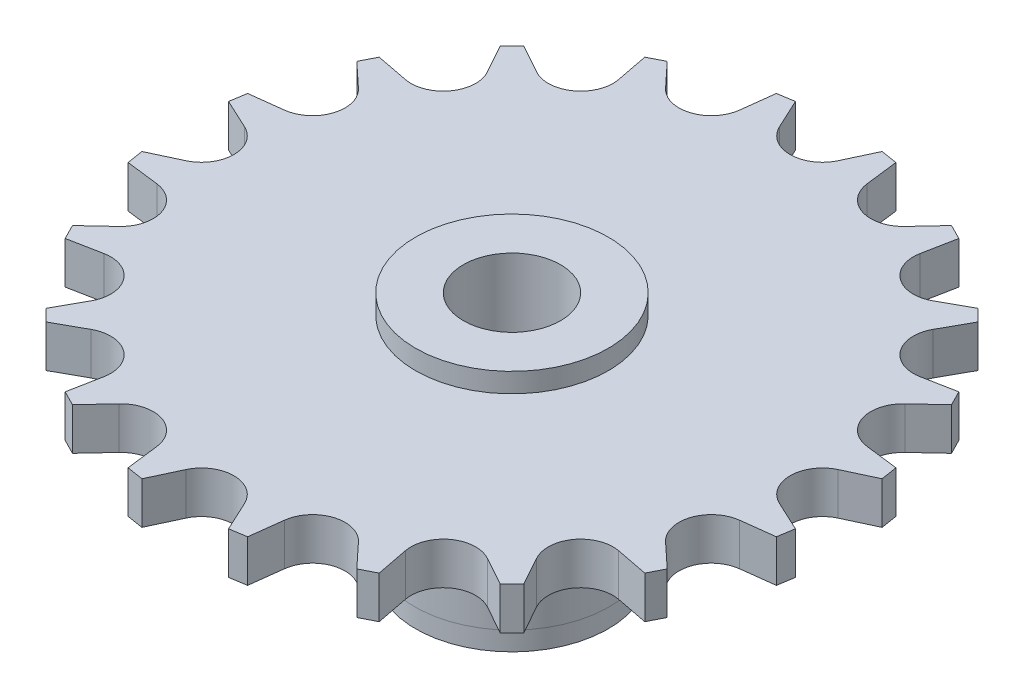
ISO-10303-21;
HEADER;
FILE_DESCRIPTION(('STEP AP214'),'2;1');
FILE_NAME('part.step','',(''),(''),'','','');
FILE_SCHEMA(('AUTOMOTIVE_DESIGN { 1 0 10303 214 1 1 1 1 }'));
ENDSEC;
DATA;
#1=APPLICATION_CONTEXT('core data for automotive mechanical design processes');
#2=APPLICATION_PROTOCOL_DEFINITION('international standard','automotive_design',2000,#1);
#3=PRODUCT_CONTEXT('',#1,'mechanical');
#4=PRODUCT('Part','Part','',(#3));
#5=PRODUCT_RELATED_PRODUCT_CATEGORY('part','',(#4));
#6=PRODUCT_DEFINITION_FORMATION('','',#4);
#7=PRODUCT_DEFINITION_CONTEXT('part definition',#1,'design');
#8=PRODUCT_DEFINITION('design','',#6,#7);
#9=PRODUCT_DEFINITION_SHAPE('','',#8);
#10=(LENGTH_UNIT() NAMED_UNIT(*) SI_UNIT(.MILLI.,.METRE.));
#11=(NAMED_UNIT(*) PLANE_ANGLE_UNIT() SI_UNIT($,.RADIAN.));
#12=(NAMED_UNIT(*) SI_UNIT($,.STERADIAN.) SOLID_ANGLE_UNIT());
#13=UNCERTAINTY_MEASURE_WITH_UNIT(LENGTH_MEASURE(1.E-05),#10,'distance_accuracy_value','');
#14=(GEOMETRIC_REPRESENTATION_CONTEXT(3) GLOBAL_UNCERTAINTY_ASSIGNED_CONTEXT((#13)) GLOBAL_UNIT_ASSIGNED_CONTEXT((#10,
#11,#12)) REPRESENTATION_CONTEXT('',''));
#15=CARTESIAN_POINT('',(0.,0.,0.));
#16=DIRECTION('',(0.,0.,1.));
#17=DIRECTION('',(1.,0.,0.));
#18=AXIS2_PLACEMENT_3D('',#15,#16,#17);
#19=CARTESIAN_POINT('',(0.,-11.3,0.));
#20=DIRECTION('',(0.,-1.,0.));
#21=DIRECTION('',(0.,0.,-1.));
#22=AXIS2_PLACEMENT_3D('',#19,#20,#21);
#23=CYLINDRICAL_SURFACE('',#22,5.95);
#24=CARTESIAN_POINT('',(0.,-11.3,0.));
#25=DIRECTION('',(0.,-1.,0.));
#26=DIRECTION('',(0.,0.,-1.));
#27=AXIS2_PLACEMENT_3D('',#24,#25,#26);
#28=CIRCLE('',#27,5.95);
#29=CARTESIAN_POINT('',(0.,-11.3,-5.95));
#30=VERTEX_POINT('',#29);
#31=EDGE_CURVE('E19',#30,#30,#28,.F.);
#32=ORIENTED_EDGE('',*,*,#31,.F.);
#33=EDGE_LOOP('',(#32));
#34=FACE_BOUND('',#33,.T.);
#35=CARTESIAN_POINT('',(0.,-12.5,0.));
#36=DIRECTION('',(0.,-1.,0.));
#37=DIRECTION('',(0.,0.,-1.));
#38=AXIS2_PLACEMENT_3D('',#35,#36,#37);
#39=CIRCLE('',#38,5.95);
#40=CARTESIAN_POINT('',(0.,-12.5,-5.95));
#41=VERTEX_POINT('',#40);
#42=EDGE_CURVE('E961',#41,#41,#39,.T.);
#43=ORIENTED_EDGE('',*,*,#42,.F.);
#44=EDGE_LOOP('',(#43));
#45=FACE_BOUND('',#44,.T.);
#46=ADVANCED_FACE('F16',(#34,#45),#23,.T.);
#47=CARTESIAN_POINT('',(6.00000000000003,-11.3,0.));
#48=DIRECTION('',(0.,-1.,0.));
#49=DIRECTION('',(0.,0.,-1.));
#50=AXIS2_PLACEMENT_3D('',#47,#48,#49);
#51=PLANE('',#50);
#52=ORIENTED_EDGE('',*,*,#31,.T.);
#53=EDGE_LOOP('',(#52));
#54=FACE_BOUND('',#53,.T.);
#55=CARTESIAN_POINT('',(0.,-11.3,0.));
#56=DIRECTION('',(0.,-1.,0.));
#57=DIRECTION('',(0.,0.,-1.));
#58=AXIS2_PLACEMENT_3D('',#55,#56,#57);
#59=CIRCLE('',#58,6.);
#60=CARTESIAN_POINT('',(0.,-11.3,-6.));
#61=VERTEX_POINT('',#60);
#62=EDGE_CURVE('E959',#61,#61,#59,.F.);
#63=ORIENTED_EDGE('',*,*,#62,.F.);
#64=EDGE_LOOP('',(#63));
#65=FACE_BOUND('',#64,.T.);
#66=ADVANCED_FACE('F968',(#54,#65),#51,.T.);
#67=CARTESIAN_POINT('',(5.95000000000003,-12.5,0.));
#68=DIRECTION('',(0.,-1.,0.));
#69=DIRECTION('',(0.,0.,-1.));
#70=AXIS2_PLACEMENT_3D('',#67,#68,#69);
#71=PLANE('',#70);
#72=CARTESIAN_POINT('',(0.,-12.5,0.));
#73=DIRECTION('',(0.,1.,0.));
#74=DIRECTION('',(0.,0.,1.));
#75=AXIS2_PLACEMENT_3D('',#72,#73,#74);
#76=CIRCLE('',#75,3.);
#77=CARTESIAN_POINT('',(0.,-12.5,3.));
#78=VERTEX_POINT('',#77);
#79=EDGE_CURVE('E793',#78,#78,#76,.T.);
#80=ORIENTED_EDGE('',*,*,#79,.T.);
#81=EDGE_LOOP('',(#80));
#82=FACE_BOUND('',#81,.T.);
#83=ORIENTED_EDGE('',*,*,#42,.T.);
#84=EDGE_LOOP('',(#83));
#85=FACE_BOUND('',#84,.T.);
#86=ADVANCED_FACE('F977',(#82,#85),#71,.T.);
#87=CARTESIAN_POINT('',(0.,-1.29999999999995,0.));
#88=DIRECTION('',(0.,-1.,0.));
#89=DIRECTION('',(0.,0.,-1.));
#90=AXIS2_PLACEMENT_3D('',#87,#88,#89);
#91=CYLINDRICAL_SURFACE('',#90,6.);
#92=CARTESIAN_POINT('',(0.,-1.29999999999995,0.));
#93=DIRECTION('',(0.,-1.,0.));
#94=DIRECTION('',(0.,0.,-1.));
#95=AXIS2_PLACEMENT_3D('',#92,#93,#94);
#96=CIRCLE('',#95,6.);
#97=CARTESIAN_POINT('',(0.,-1.29999999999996,-6.));
#98=VERTEX_POINT('',#97);
#99=EDGE_CURVE('E548',#98,#98,#96,.F.);
#100=ORIENTED_EDGE('',*,*,#99,.F.);
#101=EDGE_LOOP('',(#100));
#102=FACE_BOUND('',#101,.T.);
#103=ORIENTED_EDGE('',*,*,#62,.T.);
#104=EDGE_LOOP('',(#103));
#105=FACE_BOUND('',#104,.T.);
#106=ADVANCED_FACE('F1316',(#102,#105),#91,.T.);
#107=CARTESIAN_POINT('',(0.,-11.7,0.));
#108=DIRECTION('',(0.,1.,0.));
#109=DIRECTION('',(0.,0.,1.));
#110=AXIS2_PLACEMENT_3D('',#107,#108,#109);
#111=CYLINDRICAL_SURFACE('',#110,3.);
#112=ORIENTED_EDGE('',*,*,#79,.F.);
#113=EDGE_LOOP('',(#112));
#114=FACE_BOUND('',#113,.T.);
#115=CARTESIAN_POINT('',(0.,2.49999999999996,0.));
#116=DIRECTION('',(0.,1.,0.));
#117=DIRECTION('',(0.,0.,1.));
#118=AXIS2_PLACEMENT_3D('',#115,#116,#117);
#119=CIRCLE('',#118,3.);
#120=CARTESIAN_POINT('',(0.,2.49999999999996,3.));
#121=VERTEX_POINT('',#120);
#122=EDGE_CURVE('E522',#121,#121,#119,.F.);
#123=ORIENTED_EDGE('',*,*,#122,.F.);
#124=EDGE_LOOP('',(#123));
#125=FACE_BOUND('',#124,.T.);
#126=ADVANCED_FACE('F1312',(#114,#125),#111,.F.);
#127=CARTESIAN_POINT('',(20.1738805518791,1.29999999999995,-2.67696526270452));
#128=DIRECTION('',(0.987688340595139,0.,-0.156434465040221));
#129=DIRECTION('',(-0.156434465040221,0.,-0.987688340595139));
#130=AXIS2_PLACEMENT_3D('',#127,#128,#129);
#131=PLANE('',#130);
#132=DIRECTION('',(-0.156434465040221,0.,-0.987688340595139));
#133=VECTOR('',#132,1.);
#134=CARTESIAN_POINT('',(20.1738805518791,1.29999999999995,-2.67696526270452));
#135=LINE('',#134,#133);
#136=CARTESIAN_POINT('',(20.0130420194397,1.29999999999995,-3.69245979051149));
#137=VERTEX_POINT('',#136);
#138=CARTESIAN_POINT('',(20.1738805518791,1.29999999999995,-2.67696526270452));
#139=VERTEX_POINT('',#138);
#140=EDGE_CURVE('E782',#137,#139,#135,.F.);
#141=ORIENTED_EDGE('',*,*,#140,.T.);
#142=DIRECTION('',(0.,1.,0.));
#143=VECTOR('',#142,1.);
#144=CARTESIAN_POINT('',(20.1738805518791,1.29999999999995,-2.67696526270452));
#145=LINE('',#144,#143);
#146=CARTESIAN_POINT('',(20.1738805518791,-1.29999999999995,-2.67696526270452));
#147=VERTEX_POINT('',#146);
#148=EDGE_CURVE('E791',#147,#139,#145,.T.);
#149=ORIENTED_EDGE('',*,*,#148,.F.);
#150=DIRECTION('',(0.156434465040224,0.,0.987688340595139));
#151=VECTOR('',#150,1.);
#152=CARTESIAN_POINT('',(20.0130420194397,-1.29999999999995,-3.69245979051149));
#153=LINE('',#152,#151);
#154=CARTESIAN_POINT('',(20.0130420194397,-1.29999999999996,-3.69245979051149));
#155=VERTEX_POINT('',#154);
#156=EDGE_CURVE('E559',#155,#147,#153,.T.);
#157=ORIENTED_EDGE('',*,*,#156,.F.);
#158=DIRECTION('',(0.,1.,0.));
#159=VECTOR('',#158,1.);
#160=CARTESIAN_POINT('',(20.0130420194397,1.29999999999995,-3.69245979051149));
#161=LINE('',#160,#159);
#162=EDGE_CURVE('E544',#137,#155,#161,.F.);
#163=ORIENTED_EDGE('',*,*,#162,.F.);
#164=EDGE_LOOP('',(#141,#149,#157,#163));
#165=FACE_BOUND('',#164,.T.);
#166=ADVANCED_FACE('F1308',(#165),#131,.T.);
#167=CARTESIAN_POINT('',(20.1167913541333,1.29999999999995,3.03283809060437));
#168=DIRECTION('',(0.987688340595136,0.,0.156434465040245));
#169=DIRECTION('',(0.156434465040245,0.,-0.987688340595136));
#170=AXIS2_PLACEMENT_3D('',#167,#168,#169);
#171=PLANE('',#170);
#172=DIRECTION('',(0.156434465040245,0.,-0.987688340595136));
#173=VECTOR('',#172,1.);
#174=CARTESIAN_POINT('',(20.1167913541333,1.29999999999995,3.03283809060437));
#175=LINE('',#174,#173);
#176=CARTESIAN_POINT('',(20.1738805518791,1.29999999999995,2.67239108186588));
#177=VERTEX_POINT('',#176);
#178=CARTESIAN_POINT('',(20.0130420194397,1.29999999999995,3.68788560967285));
#179=VERTEX_POINT('',#178);
#180=EDGE_CURVE('E769',#177,#179,#175,.F.);
#181=ORIENTED_EDGE('',*,*,#180,.T.);
#182=DIRECTION('',(0.,1.,0.));
#183=VECTOR('',#182,1.);
#184=CARTESIAN_POINT('',(20.0130420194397,1.29999999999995,3.68788560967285));
#185=LINE('',#184,#183);
#186=CARTESIAN_POINT('',(20.0130420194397,-1.29999999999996,3.68788560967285));
#187=VERTEX_POINT('',#186);
#188=EDGE_CURVE('E779',#187,#179,#185,.T.);
#189=ORIENTED_EDGE('',*,*,#188,.F.);
#190=DIRECTION('',(-0.156434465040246,0.,0.987688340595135));
#191=VECTOR('',#190,1.);
#192=CARTESIAN_POINT('',(20.1738805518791,-1.29999999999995,2.67239108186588));
#193=LINE('',#192,#191);
#194=CARTESIAN_POINT('',(20.1738805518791,-1.29999999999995,2.67239108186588));
#195=VERTEX_POINT('',#194);
#196=EDGE_CURVE('E771',#195,#187,#193,.T.);
#197=ORIENTED_EDGE('',*,*,#196,.F.);
#198=DIRECTION('',(0.,1.,0.));
#199=VECTOR('',#198,1.);
#200=CARTESIAN_POINT('',(20.1738805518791,1.29999999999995,2.67239108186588));
#201=LINE('',#200,#199);
#202=EDGE_CURVE('E780',#177,#195,#201,.F.);
#203=ORIENTED_EDGE('',*,*,#202,.F.);
#204=EDGE_LOOP('',(#181,#189,#197,#203));
#205=FACE_BOUND('',#204,.T.);
#206=ADVANCED_FACE('F1304',(#205),#171,.T.);
#207=CARTESIAN_POINT('',(17.8932283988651,1.29999999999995,9.69151666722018));
#208=DIRECTION('',(0.891006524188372,0.,0.45399049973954));
#209=DIRECTION('',(0.45399049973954,0.,-0.891006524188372));
#210=AXIS2_PLACEMENT_3D('',#207,#208,#209);
#211=PLANE('',#210);
#212=DIRECTION('',(0.45399049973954,0.,-0.891006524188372));
#213=VECTOR('',#212,1.);
#214=CARTESIAN_POINT('',(17.8932283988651,1.29999999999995,9.69151666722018));
#215=LINE('',#214,#213);
#216=CARTESIAN_POINT('',(18.36,1.29999999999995,8.77542581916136));
#217=VERTEX_POINT('',#216);
#218=CARTESIAN_POINT('',(17.8932283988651,1.29999999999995,9.69151666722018));
#219=VERTEX_POINT('',#218);
#220=EDGE_CURVE('E756',#217,#219,#215,.F.);
#221=ORIENTED_EDGE('',*,*,#220,.T.);
#222=DIRECTION('',(0.,1.,0.));
#223=VECTOR('',#222,1.);
#224=CARTESIAN_POINT('',(17.8932283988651,1.29999999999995,9.69151666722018));
#225=LINE('',#224,#223);
#226=CARTESIAN_POINT('',(17.8932283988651,-1.29999999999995,9.69151666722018));
#227=VERTEX_POINT('',#226);
#228=EDGE_CURVE('E766',#227,#219,#225,.T.);
#229=ORIENTED_EDGE('',*,*,#228,.F.);
#230=DIRECTION('',(-0.453990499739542,0.,0.891006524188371));
#231=VECTOR('',#230,1.);
#232=CARTESIAN_POINT('',(18.36,-1.29999999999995,8.77542581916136));
#233=LINE('',#232,#231);
#234=CARTESIAN_POINT('',(18.36,-1.29999999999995,8.77542581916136));
#235=VERTEX_POINT('',#234);
#236=EDGE_CURVE('E758',#235,#227,#233,.T.);
#237=ORIENTED_EDGE('',*,*,#236,.F.);
#238=DIRECTION('',(0.,1.,0.));
#239=VECTOR('',#238,1.);
#240=CARTESIAN_POINT('',(18.36,1.29999999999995,8.77542581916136));
#241=LINE('',#240,#239);
#242=EDGE_CURVE('E767',#217,#235,#241,.F.);
#243=ORIENTED_EDGE('',*,*,#242,.F.);
#244=EDGE_LOOP('',(#221,#229,#237,#243));
#245=FACE_BOUND('',#244,.T.);
#246=ADVANCED_FACE('F1300',(#245),#211,.T.);
#247=CARTESIAN_POINT('',(14.0219418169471,1.29999999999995,14.7462506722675));
#248=DIRECTION('',(0.707106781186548,0.,0.707106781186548));
#249=DIRECTION('',(0.707106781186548,0.,-0.707106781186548));
#250=AXIS2_PLACEMENT_3D('',#247,#248,#249);
#251=PLANE('',#250);
#252=DIRECTION('',(0.707106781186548,0.,-0.707106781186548));
#253=VECTOR('',#252,1.);
#254=CARTESIAN_POINT('',(14.0219418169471,1.29999999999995,14.7462506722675));
#255=LINE('',#254,#253);
#256=CARTESIAN_POINT('',(14.7489556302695,1.29999999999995,14.0192368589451));
#257=VERTEX_POINT('',#256);
#258=CARTESIAN_POINT('',(14.0219418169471,1.29999999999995,14.7462506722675));
#259=VERTEX_POINT('',#258);
#260=EDGE_CURVE('E743',#257,#259,#255,.F.);
#261=ORIENTED_EDGE('',*,*,#260,.T.);
#262=DIRECTION('',(0.,1.,0.));
#263=VECTOR('',#262,1.);
#264=CARTESIAN_POINT('',(14.021941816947,1.29999999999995,14.7462506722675));
#265=LINE('',#264,#263);
#266=CARTESIAN_POINT('',(14.021941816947,-1.29999999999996,14.7462506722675));
#267=VERTEX_POINT('',#266);
#268=EDGE_CURVE('E753',#267,#259,#265,.T.);
#269=ORIENTED_EDGE('',*,*,#268,.F.);
#270=DIRECTION('',(-0.707106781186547,0.,0.707106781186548));
#271=VECTOR('',#270,1.);
#272=CARTESIAN_POINT('',(14.7489556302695,-1.29999999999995,14.0192368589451));
#273=LINE('',#272,#271);
#274=CARTESIAN_POINT('',(14.7489556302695,-1.29999999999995,14.0192368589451));
#275=VERTEX_POINT('',#274);
#276=EDGE_CURVE('E745',#275,#267,#273,.T.);
#277=ORIENTED_EDGE('',*,*,#276,.F.);
#278=DIRECTION('',(0.,1.,0.));
#279=VECTOR('',#278,1.);
#280=CARTESIAN_POINT('',(14.7489556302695,1.29999999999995,14.0192368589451));
#281=LINE('',#280,#279);
#282=EDGE_CURVE('E754',#257,#275,#281,.F.);
#283=ORIENTED_EDGE('',*,*,#282,.F.);
#284=EDGE_LOOP('',(#261,#269,#277,#283));
#285=FACE_BOUND('',#284,.T.);
#286=ADVANCED_FACE('F1296',(#285),#251,.T.);
#287=CARTESIAN_POINT('',(8.77813077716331,1.29999999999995,18.3572950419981));
#288=DIRECTION('',(0.453990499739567,0.,0.891006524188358));
#289=DIRECTION('',(0.891006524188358,0.,-0.453990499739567));
#290=AXIS2_PLACEMENT_3D('',#287,#288,#289);
#291=PLANE('',#290);
#292=DIRECTION('',(0.891006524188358,0.,-0.453990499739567));
#293=VECTOR('',#292,1.);
#294=CARTESIAN_POINT('',(8.77813077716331,1.29999999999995,18.3572950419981));
#295=LINE('',#294,#293);
#296=CARTESIAN_POINT('',(9.69422162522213,1.29999999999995,17.8905234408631));
#297=VERTEX_POINT('',#296);
#298=CARTESIAN_POINT('',(8.77813077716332,1.29999999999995,18.3572950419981));
#299=VERTEX_POINT('',#298);
#300=EDGE_CURVE('E730',#297,#299,#295,.F.);
#301=ORIENTED_EDGE('',*,*,#300,.T.);
#302=DIRECTION('',(0.,1.,0.));
#303=VECTOR('',#302,1.);
#304=CARTESIAN_POINT('',(8.77813077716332,1.29999999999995,18.3572950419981));
#305=LINE('',#304,#303);
#306=CARTESIAN_POINT('',(8.77813077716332,-1.29999999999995,18.3572950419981));
#307=VERTEX_POINT('',#306);
#308=EDGE_CURVE('E740',#307,#299,#305,.T.);
#309=ORIENTED_EDGE('',*,*,#308,.F.);
#310=DIRECTION('',(-0.891006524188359,0.,0.453990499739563));
#311=VECTOR('',#310,1.);
#312=CARTESIAN_POINT('',(9.69422162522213,-1.29999999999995,17.8905234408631));
#313=LINE('',#312,#311);
#314=CARTESIAN_POINT('',(9.69422162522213,-1.29999999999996,17.8905234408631));
#315=VERTEX_POINT('',#314);
#316=EDGE_CURVE('E732',#315,#307,#313,.T.);
#317=ORIENTED_EDGE('',*,*,#316,.F.);
#318=DIRECTION('',(0.,1.,0.));
#319=VECTOR('',#318,1.);
#320=CARTESIAN_POINT('',(9.69422162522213,1.29999999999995,17.8905234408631));
#321=LINE('',#320,#319);
#322=EDGE_CURVE('E741',#297,#315,#321,.F.);
#323=ORIENTED_EDGE('',*,*,#322,.F.);
#324=EDGE_LOOP('',(#301,#309,#317,#323));
#325=FACE_BOUND('',#324,.T.);
#326=ADVANCED_FACE('F1292',(#325),#291,.T.);
#327=CARTESIAN_POINT('',(2.67509603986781,1.29999999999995,20.1711755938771));
#328=DIRECTION('',(0.156434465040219,0.,0.98768834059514));
#329=DIRECTION('',(0.98768834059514,0.,-0.156434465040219));
#330=AXIS2_PLACEMENT_3D('',#327,#328,#329);
#331=PLANE('',#330);
#332=DIRECTION('',(0.98768834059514,0.,-0.156434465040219));
#333=VECTOR('',#332,1.);
#334=CARTESIAN_POINT('',(2.67509603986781,1.29999999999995,20.1711755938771));
#335=LINE('',#334,#333);
#336=CARTESIAN_POINT('',(3.6905905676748,1.29999999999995,20.0103370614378));
#337=VERTEX_POINT('',#336);
#338=CARTESIAN_POINT('',(2.67509603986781,1.29999999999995,20.1711755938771));
#339=VERTEX_POINT('',#338);
#340=EDGE_CURVE('E717',#337,#339,#335,.F.);
#341=ORIENTED_EDGE('',*,*,#340,.T.);
#342=DIRECTION('',(0.,1.,0.));
#343=VECTOR('',#342,1.);
#344=CARTESIAN_POINT('',(2.6750960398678,1.29999999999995,20.1711755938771));
#345=LINE('',#344,#343);
#346=CARTESIAN_POINT('',(2.6750960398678,-1.29999999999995,20.1711755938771));
#347=VERTEX_POINT('',#346);
#348=EDGE_CURVE('E727',#347,#339,#345,.T.);
#349=ORIENTED_EDGE('',*,*,#348,.F.);
#350=DIRECTION('',(-0.987688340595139,0.,0.15643446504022));
#351=VECTOR('',#350,1.);
#352=CARTESIAN_POINT('',(3.6905905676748,-1.29999999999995,20.0103370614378));
#353=LINE('',#352,#351);
#354=CARTESIAN_POINT('',(3.6905905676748,-1.29999999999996,20.0103370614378));
#355=VERTEX_POINT('',#354);
#356=EDGE_CURVE('E719',#355,#347,#353,.T.);
#357=ORIENTED_EDGE('',*,*,#356,.F.);
#358=DIRECTION('',(0.,1.,0.));
#359=VECTOR('',#358,1.);
#360=CARTESIAN_POINT('',(3.6905905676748,1.29999999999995,20.0103370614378));
#361=LINE('',#360,#359);
#362=EDGE_CURVE('E728',#337,#355,#361,.F.);
#363=ORIENTED_EDGE('',*,*,#362,.F.);
#364=EDGE_LOOP('',(#341,#349,#357,#363));
#365=FACE_BOUND('',#364,.T.);
#366=ADVANCED_FACE('F1288',(#365),#331,.T.);
#367=CARTESIAN_POINT('',(-3.68975483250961,1.29999999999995,20.0103370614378));
#368=DIRECTION('',(-0.156434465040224,0.,0.987688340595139));
#369=DIRECTION('',(0.987688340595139,0.,0.156434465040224));
#370=AXIS2_PLACEMENT_3D('',#367,#368,#369);
#371=PLANE('',#370);
#372=DIRECTION('',(0.987688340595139,0.,0.156434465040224));
#373=VECTOR('',#372,1.);
#374=CARTESIAN_POINT('',(-3.68975483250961,1.29999999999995,20.0103370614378));
#375=LINE('',#374,#373);
#376=CARTESIAN_POINT('',(-2.67426030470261,1.29999999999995,20.1711755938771));
#377=VERTEX_POINT('',#376);
#378=CARTESIAN_POINT('',(-3.6897548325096,1.29999999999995,20.0103370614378));
#379=VERTEX_POINT('',#378);
#380=EDGE_CURVE('E704',#377,#379,#375,.F.);
#381=ORIENTED_EDGE('',*,*,#380,.T.);
#382=DIRECTION('',(0.,1.,0.));
#383=VECTOR('',#382,1.);
#384=CARTESIAN_POINT('',(-3.68975483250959,1.29999999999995,20.0103370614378));
#385=LINE('',#384,#383);
#386=CARTESIAN_POINT('',(-3.6897548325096,-1.29999999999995,20.0103370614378));
#387=VERTEX_POINT('',#386);
#388=EDGE_CURVE('E714',#387,#379,#385,.T.);
#389=ORIENTED_EDGE('',*,*,#388,.F.);
#390=DIRECTION('',(-0.987688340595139,0.,-0.15643446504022));
#391=VECTOR('',#390,1.);
#392=CARTESIAN_POINT('',(-2.67426030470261,-1.29999999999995,20.1711755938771));
#393=LINE('',#392,#391);
#394=CARTESIAN_POINT('',(-2.67426030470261,-1.29999999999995,20.1711755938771));
#395=VERTEX_POINT('',#394);
#396=EDGE_CURVE('E706',#395,#387,#393,.T.);
#397=ORIENTED_EDGE('',*,*,#396,.F.);
#398=DIRECTION('',(0.,1.,0.));
#399=VECTOR('',#398,1.);
#400=CARTESIAN_POINT('',(-2.67426030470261,1.29999999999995,20.1711755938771));
#401=LINE('',#400,#399);
#402=EDGE_CURVE('E715',#377,#395,#401,.F.);
#403=ORIENTED_EDGE('',*,*,#402,.F.);
#404=EDGE_LOOP('',(#381,#389,#397,#403));
#405=FACE_BOUND('',#404,.T.);
#406=ADVANCED_FACE('F1284',(#405),#371,.T.);
#407=CARTESIAN_POINT('',(-9.69338589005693,1.29999999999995,17.8905234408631));
#408=DIRECTION('',(-0.453990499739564,0.,0.891006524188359));
#409=DIRECTION('',(0.891006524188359,0.,0.453990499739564));
#410=AXIS2_PLACEMENT_3D('',#407,#408,#409);
#411=PLANE('',#410);
#412=DIRECTION('',(0.891006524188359,0.,0.453990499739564));
#413=VECTOR('',#412,1.);
#414=CARTESIAN_POINT('',(-9.69338589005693,1.29999999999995,17.8905234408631));
#415=LINE('',#414,#413);
#416=CARTESIAN_POINT('',(-8.77729504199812,1.29999999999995,18.3572950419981));
#417=VERTEX_POINT('',#416);
#418=CARTESIAN_POINT('',(-9.69338589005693,1.29999999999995,17.8905234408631));
#419=VERTEX_POINT('',#418);
#420=EDGE_CURVE('E691',#417,#419,#415,.F.);
#421=ORIENTED_EDGE('',*,*,#420,.T.);
#422=DIRECTION('',(0.,1.,0.));
#423=VECTOR('',#422,1.);
#424=CARTESIAN_POINT('',(-9.69338589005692,1.29999999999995,17.8905234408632));
#425=LINE('',#424,#423);
#426=CARTESIAN_POINT('',(-9.69338589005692,-1.29999999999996,17.8905234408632));
#427=VERTEX_POINT('',#426);
#428=EDGE_CURVE('E701',#427,#419,#425,.T.);
#429=ORIENTED_EDGE('',*,*,#428,.F.);
#430=DIRECTION('',(-0.89100652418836,0.,-0.453990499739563));
#431=VECTOR('',#430,1.);
#432=CARTESIAN_POINT('',(-8.77729504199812,-1.29999999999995,18.3572950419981));
#433=LINE('',#432,#431);
#434=CARTESIAN_POINT('',(-8.77729504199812,-1.29999999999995,18.3572950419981));
#435=VERTEX_POINT('',#434);
#436=EDGE_CURVE('E693',#435,#427,#433,.T.);
#437=ORIENTED_EDGE('',*,*,#436,.F.);
#438=DIRECTION('',(0.,1.,0.));
#439=VECTOR('',#438,1.);
#440=CARTESIAN_POINT('',(-8.77729504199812,1.29999999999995,18.3572950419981));
#441=LINE('',#440,#439);
#442=EDGE_CURVE('E702',#417,#435,#441,.F.);
#443=ORIENTED_EDGE('',*,*,#442,.F.);
#444=EDGE_LOOP('',(#421,#429,#437,#443));
#445=FACE_BOUND('',#444,.T.);
#446=ADVANCED_FACE('F1280',(#445),#411,.T.);
#447=CARTESIAN_POINT('',(-14.7481198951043,1.29999999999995,14.0192368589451));
#448=DIRECTION('',(-0.707106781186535,0.,0.70710678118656));
#449=DIRECTION('',(0.70710678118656,0.,0.707106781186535));
#450=AXIS2_PLACEMENT_3D('',#447,#448,#449);
#451=PLANE('',#450);
#452=DIRECTION('',(0.70710678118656,0.,0.707106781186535));
#453=VECTOR('',#452,1.);
#454=CARTESIAN_POINT('',(-14.7481198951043,1.29999999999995,14.0192368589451));
#455=LINE('',#454,#453);
#456=CARTESIAN_POINT('',(-14.0211060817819,1.29999999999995,14.7462506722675));
#457=VERTEX_POINT('',#456);
#458=CARTESIAN_POINT('',(-14.7481198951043,1.29999999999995,14.0192368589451));
#459=VERTEX_POINT('',#458);
#460=EDGE_CURVE('E678',#457,#459,#455,.F.);
#461=ORIENTED_EDGE('',*,*,#460,.T.);
#462=DIRECTION('',(0.,1.,0.));
#463=VECTOR('',#462,1.);
#464=CARTESIAN_POINT('',(-14.7481198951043,1.29999999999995,14.0192368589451));
#465=LINE('',#464,#463);
#466=CARTESIAN_POINT('',(-14.7481198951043,-1.29999999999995,14.0192368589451));
#467=VERTEX_POINT('',#466);
#468=EDGE_CURVE('E688',#467,#459,#465,.T.);
#469=ORIENTED_EDGE('',*,*,#468,.F.);
#470=DIRECTION('',(-0.70710678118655,0.,-0.707106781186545));
#471=VECTOR('',#470,1.);
#472=CARTESIAN_POINT('',(-14.0211060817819,-1.29999999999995,14.7462506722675));
#473=LINE('',#472,#471);
#474=CARTESIAN_POINT('',(-14.0211060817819,-1.29999999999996,14.7462506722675));
#475=VERTEX_POINT('',#474);
#476=EDGE_CURVE('E680',#475,#467,#473,.T.);
#477=ORIENTED_EDGE('',*,*,#476,.F.);
#478=DIRECTION('',(0.,1.,0.));
#479=VECTOR('',#478,1.);
#480=CARTESIAN_POINT('',(-14.0211060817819,1.29999999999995,14.7462506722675));
#481=LINE('',#480,#479);
#482=EDGE_CURVE('E689',#457,#475,#481,.F.);
#483=ORIENTED_EDGE('',*,*,#482,.F.);
#484=EDGE_LOOP('',(#461,#469,#477,#483));
#485=FACE_BOUND('',#484,.T.);
#486=ADVANCED_FACE('F1276',(#485),#451,.T.);
#487=CARTESIAN_POINT('',(-18.3591642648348,1.29999999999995,8.77542581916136));
#488=DIRECTION('',(-0.891006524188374,0.,0.453990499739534));
#489=DIRECTION('',(0.453990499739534,0.,0.891006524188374));
#490=AXIS2_PLACEMENT_3D('',#487,#488,#489);
#491=PLANE('',#490);
#492=DIRECTION('',(0.453990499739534,0.,0.891006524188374));
#493=VECTOR('',#492,1.);
#494=CARTESIAN_POINT('',(-18.3591642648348,1.29999999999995,8.77542581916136));
#495=LINE('',#494,#493);
#496=CARTESIAN_POINT('',(-17.8923926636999,1.29999999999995,9.69151666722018));
#497=VERTEX_POINT('',#496);
#498=CARTESIAN_POINT('',(-18.3591642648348,1.29999999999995,8.77542581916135));
#499=VERTEX_POINT('',#498);
#500=EDGE_CURVE('E665',#497,#499,#495,.F.);
#501=ORIENTED_EDGE('',*,*,#500,.T.);
#502=DIRECTION('',(0.,1.,0.));
#503=VECTOR('',#502,1.);
#504=CARTESIAN_POINT('',(-18.3591642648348,1.29999999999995,8.77542581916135));
#505=LINE('',#504,#503);
#506=CARTESIAN_POINT('',(-18.3591642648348,-1.29999999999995,8.77542581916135));
#507=VERTEX_POINT('',#506);
#508=EDGE_CURVE('E675',#507,#499,#505,.T.);
#509=ORIENTED_EDGE('',*,*,#508,.F.);
#510=DIRECTION('',(-0.453990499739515,0.,-0.891006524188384));
#511=VECTOR('',#510,1.);
#512=CARTESIAN_POINT('',(-17.8923926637,-1.29999999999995,9.69151666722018));
#513=LINE('',#512,#511);
#514=CARTESIAN_POINT('',(-17.8923926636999,-1.29999999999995,9.69151666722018));
#515=VERTEX_POINT('',#514);
#516=EDGE_CURVE('E667',#515,#507,#513,.T.);
#517=ORIENTED_EDGE('',*,*,#516,.F.);
#518=DIRECTION('',(0.,1.,0.));
#519=VECTOR('',#518,1.);
#520=CARTESIAN_POINT('',(-17.8923926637,1.29999999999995,9.69151666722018));
#521=LINE('',#520,#519);
#522=EDGE_CURVE('E676',#497,#515,#521,.F.);
#523=ORIENTED_EDGE('',*,*,#522,.F.);
#524=EDGE_LOOP('',(#501,#509,#517,#523));
#525=FACE_BOUND('',#524,.T.);
#526=ADVANCED_FACE('F1272',(#525),#491,.T.);
#527=CARTESIAN_POINT('',(-20.1159556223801,1.29999999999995,3.03283806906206));
#528=DIRECTION('',(-0.987688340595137,0.,0.156434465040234));
#529=DIRECTION('',(0.156434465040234,0.,0.987688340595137));
#530=AXIS2_PLACEMENT_3D('',#527,#528,#529);
#531=PLANE('',#530);
#532=DIRECTION('',(0.156434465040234,0.,0.987688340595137));
#533=VECTOR('',#532,1.);
#534=CARTESIAN_POINT('',(-20.1159556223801,1.29999999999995,3.03283806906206));
#535=LINE('',#534,#533);
#536=CARTESIAN_POINT('',(-20.0122062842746,1.29999999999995,3.68788560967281));
#537=VERTEX_POINT('',#536);
#538=CARTESIAN_POINT('',(-20.1730448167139,1.29999999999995,2.67239108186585));
#539=VERTEX_POINT('',#538);
#540=EDGE_CURVE('E652',#537,#539,#535,.F.);
#541=ORIENTED_EDGE('',*,*,#540,.T.);
#542=DIRECTION('',(0.,1.,0.));
#543=VECTOR('',#542,1.);
#544=CARTESIAN_POINT('',(-20.1730448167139,1.29999999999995,2.67239108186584));
#545=LINE('',#544,#543);
#546=CARTESIAN_POINT('',(-20.1730448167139,-1.29999999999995,2.67239108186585));
#547=VERTEX_POINT('',#546);
#548=EDGE_CURVE('E662',#547,#539,#545,.T.);
#549=ORIENTED_EDGE('',*,*,#548,.F.);
#550=DIRECTION('',(-0.156434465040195,0.,-0.987688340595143));
#551=VECTOR('',#550,1.);
#552=CARTESIAN_POINT('',(-20.0122062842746,-1.29999999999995,3.68788560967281));
#553=LINE('',#552,#551);
#554=CARTESIAN_POINT('',(-20.0122062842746,-1.29999999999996,3.68788560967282));
#555=VERTEX_POINT('',#554);
#556=EDGE_CURVE('E654',#555,#547,#553,.T.);
#557=ORIENTED_EDGE('',*,*,#556,.F.);
#558=DIRECTION('',(0.,1.,0.));
#559=VECTOR('',#558,1.);
#560=CARTESIAN_POINT('',(-20.0122062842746,1.29999999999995,3.68788560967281));
#561=LINE('',#560,#559);
#562=EDGE_CURVE('E663',#537,#555,#561,.F.);
#563=ORIENTED_EDGE('',*,*,#562,.F.);
#564=EDGE_LOOP('',(#541,#549,#557,#563));
#565=FACE_BOUND('',#564,.T.);
#566=ADVANCED_FACE('F1268',(#565),#531,.T.);
#567=CARTESIAN_POINT('',(-20.0122062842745,1.29999999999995,-3.69245979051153));
#568=DIRECTION('',(-0.987688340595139,0.,-0.156434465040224));
#569=DIRECTION('',(-0.156434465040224,0.,0.987688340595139));
#570=AXIS2_PLACEMENT_3D('',#567,#568,#569);
#571=PLANE('',#570);
#572=DIRECTION('',(-0.156434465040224,0.,0.987688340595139));
#573=VECTOR('',#572,1.);
#574=CARTESIAN_POINT('',(-20.0122062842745,1.29999999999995,-3.69245979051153));
#575=LINE('',#574,#573);
#576=CARTESIAN_POINT('',(-20.1730448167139,1.29999999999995,-2.67696526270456));
#577=VERTEX_POINT('',#576);
#578=CARTESIAN_POINT('',(-20.0122062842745,1.29999999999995,-3.69245979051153));
#579=VERTEX_POINT('',#578);
#580=EDGE_CURVE('E639',#577,#579,#575,.F.);
#581=ORIENTED_EDGE('',*,*,#580,.T.);
#582=DIRECTION('',(0.,1.,0.));
#583=VECTOR('',#582,1.);
#584=CARTESIAN_POINT('',(-20.0122062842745,1.29999999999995,-3.69245979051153));
#585=LINE('',#584,#583);
#586=CARTESIAN_POINT('',(-20.0122062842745,-1.29999999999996,-3.69245979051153));
#587=VERTEX_POINT('',#586);
#588=EDGE_CURVE('E649',#587,#579,#585,.T.);
#589=ORIENTED_EDGE('',*,*,#588,.F.);
#590=DIRECTION('',(0.156434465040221,0.,-0.987688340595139));
#591=VECTOR('',#590,1.);
#592=CARTESIAN_POINT('',(-20.1730448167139,-1.29999999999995,-2.67696526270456));
#593=LINE('',#592,#591);
#594=CARTESIAN_POINT('',(-20.1730448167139,-1.29999999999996,-2.67696526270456));
#595=VERTEX_POINT('',#594);
#596=EDGE_CURVE('E641',#595,#587,#593,.T.);
#597=ORIENTED_EDGE('',*,*,#596,.F.);
#598=DIRECTION('',(0.,1.,0.));
#599=VECTOR('',#598,1.);
#600=CARTESIAN_POINT('',(-20.1730448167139,1.29999999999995,-2.67696526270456));
#601=LINE('',#600,#599);
#602=EDGE_CURVE('E650',#577,#595,#601,.F.);
#603=ORIENTED_EDGE('',*,*,#602,.F.);
#604=EDGE_LOOP('',(#581,#589,#597,#603));
#605=FACE_BOUND('',#604,.T.);
#606=ADVANCED_FACE('F1264',(#605),#571,.T.);
#607=CARTESIAN_POINT('',(-18.3375716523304,1.29999999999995,-8.82237788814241));
#608=DIRECTION('',(-0.891006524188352,0.,-0.453990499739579));
#609=DIRECTION('',(-0.453990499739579,0.,0.891006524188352));
#610=AXIS2_PLACEMENT_3D('',#607,#608,#609);
#611=PLANE('',#610);
#612=DIRECTION('',(-0.453990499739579,0.,0.891006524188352));
#613=VECTOR('',#612,1.);
#614=CARTESIAN_POINT('',(-18.3375716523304,1.29999999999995,-8.82237788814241));
#615=LINE('',#614,#613);
#616=CARTESIAN_POINT('',(-18.3591642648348,1.29999999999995,-8.78000000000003));
#617=VERTEX_POINT('',#616);
#618=CARTESIAN_POINT('',(-17.8923926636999,1.29999999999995,-9.69609084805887));
#619=VERTEX_POINT('',#618);
#620=EDGE_CURVE('E626',#617,#619,#615,.F.);
#621=ORIENTED_EDGE('',*,*,#620,.T.);
#622=DIRECTION('',(0.,1.,0.));
#623=VECTOR('',#622,1.);
#624=CARTESIAN_POINT('',(-17.8923926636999,1.29999999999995,-9.69609084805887));
#625=LINE('',#624,#623);
#626=CARTESIAN_POINT('',(-17.8923926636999,-1.29999999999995,-9.69609084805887));
#627=VERTEX_POINT('',#626);
#628=EDGE_CURVE('E636',#627,#619,#625,.T.);
#629=ORIENTED_EDGE('',*,*,#628,.F.);
#630=DIRECTION('',(0.453990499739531,0.,-0.891006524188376));
#631=VECTOR('',#630,1.);
#632=CARTESIAN_POINT('',(-18.3591642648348,-1.29999999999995,-8.78000000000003));
#633=LINE('',#632,#631);
#634=CARTESIAN_POINT('',(-18.3591642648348,-1.29999999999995,-8.78000000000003));
#635=VERTEX_POINT('',#634);
#636=EDGE_CURVE('E628',#635,#627,#633,.T.);
#637=ORIENTED_EDGE('',*,*,#636,.F.);
#638=DIRECTION('',(0.,1.,0.));
#639=VECTOR('',#638,1.);
#640=CARTESIAN_POINT('',(-18.3591642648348,1.29999999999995,-8.78000000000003));
#641=LINE('',#640,#639);
#642=EDGE_CURVE('E637',#617,#635,#641,.F.);
#643=ORIENTED_EDGE('',*,*,#642,.F.);
#644=EDGE_LOOP('',(#621,#629,#637,#643));
#645=FACE_BOUND('',#644,.T.);
#646=ADVANCED_FACE('F1260',(#645),#611,.T.);
#647=CARTESIAN_POINT('',(-14.0211060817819,1.29999999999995,-14.7508248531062));
#648=DIRECTION('',(-0.707106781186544,0.,-0.707106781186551));
#649=DIRECTION('',(-0.707106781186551,0.,0.707106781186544));
#650=AXIS2_PLACEMENT_3D('',#647,#648,#649);
#651=PLANE('',#650);
#652=DIRECTION('',(-0.707106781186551,0.,0.707106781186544));
#653=VECTOR('',#652,1.);
#654=CARTESIAN_POINT('',(-14.0211060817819,1.29999999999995,-14.7508248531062));
#655=LINE('',#654,#653);
#656=CARTESIAN_POINT('',(-14.7481198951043,1.29999999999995,-14.0238110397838));
#657=VERTEX_POINT('',#656);
#658=CARTESIAN_POINT('',(-14.0211060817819,1.29999999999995,-14.7508248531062));
#659=VERTEX_POINT('',#658);
#660=EDGE_CURVE('E613',#657,#659,#655,.F.);
#661=ORIENTED_EDGE('',*,*,#660,.T.);
#662=DIRECTION('',(0.,1.,0.));
#663=VECTOR('',#662,1.);
#664=CARTESIAN_POINT('',(-14.0211060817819,1.29999999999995,-14.7508248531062));
#665=LINE('',#664,#663);
#666=CARTESIAN_POINT('',(-14.0211060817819,-1.29999999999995,-14.7508248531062));
#667=VERTEX_POINT('',#666);
#668=EDGE_CURVE('E623',#667,#659,#665,.T.);
#669=ORIENTED_EDGE('',*,*,#668,.F.);
#670=DIRECTION('',(0.707106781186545,0.,-0.70710678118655));
#671=VECTOR('',#670,1.);
#672=CARTESIAN_POINT('',(-14.7481198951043,-1.29999999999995,-14.0238110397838));
#673=LINE('',#672,#671);
#674=CARTESIAN_POINT('',(-14.7481198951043,-1.29999999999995,-14.0238110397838));
#675=VERTEX_POINT('',#674);
#676=EDGE_CURVE('E615',#675,#667,#673,.T.);
#677=ORIENTED_EDGE('',*,*,#676,.F.);
#678=DIRECTION('',(0.,1.,0.));
#679=VECTOR('',#678,1.);
#680=CARTESIAN_POINT('',(-14.7481198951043,1.29999999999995,-14.0238110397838));
#681=LINE('',#680,#679);
#682=EDGE_CURVE('E624',#657,#675,#681,.F.);
#683=ORIENTED_EDGE('',*,*,#682,.F.);
#684=EDGE_LOOP('',(#661,#669,#677,#683));
#685=FACE_BOUND('',#684,.T.);
#686=ADVANCED_FACE('F1256',(#685),#651,.T.);
#687=CARTESIAN_POINT('',(-8.77729504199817,1.29999999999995,-18.3618692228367));
#688=DIRECTION('',(-0.45399049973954,0.,-0.891006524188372));
#689=DIRECTION('',(-0.891006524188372,0.,0.45399049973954));
#690=AXIS2_PLACEMENT_3D('',#687,#688,#689);
#691=PLANE('',#690);
#692=DIRECTION('',(-0.891006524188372,0.,0.45399049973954));
#693=VECTOR('',#692,1.);
#694=CARTESIAN_POINT('',(-8.77729504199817,1.29999999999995,-18.3618692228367));
#695=LINE('',#694,#693);
#696=CARTESIAN_POINT('',(-9.69338589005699,1.29999999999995,-17.8950976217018));
#697=VERTEX_POINT('',#696);
#698=CARTESIAN_POINT('',(-8.77729504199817,1.29999999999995,-18.3618692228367));
#699=VERTEX_POINT('',#698);
#700=EDGE_CURVE('E600',#697,#699,#695,.F.);
#701=ORIENTED_EDGE('',*,*,#700,.T.);
#702=DIRECTION('',(0.,1.,0.));
#703=VECTOR('',#702,1.);
#704=CARTESIAN_POINT('',(-8.77729504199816,1.29999999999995,-18.3618692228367));
#705=LINE('',#704,#703);
#706=CARTESIAN_POINT('',(-8.77729504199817,-1.29999999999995,-18.3618692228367));
#707=VERTEX_POINT('',#706);
#708=EDGE_CURVE('E610',#707,#699,#705,.T.);
#709=ORIENTED_EDGE('',*,*,#708,.F.);
#710=DIRECTION('',(0.89100652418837,0.,-0.453990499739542));
#711=VECTOR('',#710,1.);
#712=CARTESIAN_POINT('',(-9.69338589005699,-1.29999999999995,-17.8950976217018));
#713=LINE('',#712,#711);
#714=CARTESIAN_POINT('',(-9.69338589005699,-1.29999999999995,-17.8950976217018));
#715=VERTEX_POINT('',#714);
#716=EDGE_CURVE('E602',#715,#707,#713,.T.);
#717=ORIENTED_EDGE('',*,*,#716,.F.);
#718=DIRECTION('',(0.,1.,0.));
#719=VECTOR('',#718,1.);
#720=CARTESIAN_POINT('',(-9.69338589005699,1.29999999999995,-17.8950976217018));
#721=LINE('',#720,#719);
#722=EDGE_CURVE('E611',#697,#715,#721,.F.);
#723=ORIENTED_EDGE('',*,*,#722,.F.);
#724=EDGE_LOOP('',(#701,#709,#717,#723));
#725=FACE_BOUND('',#724,.T.);
#726=ADVANCED_FACE('F1252',(#725),#691,.T.);
#727=CARTESIAN_POINT('',(-2.6742603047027,1.29999999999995,-20.1757497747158));
#728=DIRECTION('',(-0.156434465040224,0.,-0.987688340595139));
#729=DIRECTION('',(-0.987688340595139,0.,0.156434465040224));
#730=AXIS2_PLACEMENT_3D('',#727,#728,#729);
#731=PLANE('',#730);
#732=DIRECTION('',(-0.987688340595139,0.,0.156434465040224));
#733=VECTOR('',#732,1.);
#734=CARTESIAN_POINT('',(-2.6742603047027,1.29999999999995,-20.1757497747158));
#735=LINE('',#734,#733);
#736=CARTESIAN_POINT('',(-3.68975483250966,1.29999999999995,-20.0149112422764));
#737=VERTEX_POINT('',#736);
#738=CARTESIAN_POINT('',(-2.6742603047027,1.29999999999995,-20.1757497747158));
#739=VERTEX_POINT('',#738);
#740=EDGE_CURVE('E587',#737,#739,#735,.F.);
#741=ORIENTED_EDGE('',*,*,#740,.T.);
#742=DIRECTION('',(0.,1.,0.));
#743=VECTOR('',#742,1.);
#744=CARTESIAN_POINT('',(-2.67426030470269,1.29999999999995,-20.1757497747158));
#745=LINE('',#744,#743);
#746=CARTESIAN_POINT('',(-2.67426030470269,-1.29999999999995,-20.1757497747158));
#747=VERTEX_POINT('',#746);
#748=EDGE_CURVE('E597',#747,#739,#745,.T.);
#749=ORIENTED_EDGE('',*,*,#748,.F.);
#750=DIRECTION('',(0.987688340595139,0.,-0.156434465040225));
#751=VECTOR('',#750,1.);
#752=CARTESIAN_POINT('',(-3.68975483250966,-1.29999999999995,-20.0149112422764));
#753=LINE('',#752,#751);
#754=CARTESIAN_POINT('',(-3.68975483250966,-1.29999999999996,-20.0149112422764));
#755=VERTEX_POINT('',#754);
#756=EDGE_CURVE('E589',#755,#747,#753,.T.);
#757=ORIENTED_EDGE('',*,*,#756,.F.);
#758=DIRECTION('',(0.,1.,0.));
#759=VECTOR('',#758,1.);
#760=CARTESIAN_POINT('',(-3.68975483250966,1.29999999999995,-20.0149112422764));
#761=LINE('',#760,#759);
#762=EDGE_CURVE('E598',#737,#755,#761,.F.);
#763=ORIENTED_EDGE('',*,*,#762,.F.);
#764=EDGE_LOOP('',(#741,#749,#757,#763));
#765=FACE_BOUND('',#764,.T.);
#766=ADVANCED_FACE('F1248',(#765),#731,.T.);
#767=CARTESIAN_POINT('',(3.69059056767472,1.29999999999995,-20.0149112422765));
#768=DIRECTION('',(0.156434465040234,0.,-0.987688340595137));
#769=DIRECTION('',(-0.987688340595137,0.,-0.156434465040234));
#770=AXIS2_PLACEMENT_3D('',#767,#768,#769);
#771=PLANE('',#770);
#772=DIRECTION('',(-0.987688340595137,0.,-0.156434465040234));
#773=VECTOR('',#772,1.);
#774=CARTESIAN_POINT('',(3.69059056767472,1.29999999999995,-20.0149112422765));
#775=LINE('',#774,#773);
#776=CARTESIAN_POINT('',(2.67509603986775,1.29999999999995,-20.1757497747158));
#777=VERTEX_POINT('',#776);
#778=CARTESIAN_POINT('',(3.69059056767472,1.29999999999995,-20.0149112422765));
#779=VERTEX_POINT('',#778);
#780=EDGE_CURVE('E574',#777,#779,#775,.F.);
#781=ORIENTED_EDGE('',*,*,#780,.T.);
#782=DIRECTION('',(0.,1.,0.));
#783=VECTOR('',#782,1.);
#784=CARTESIAN_POINT('',(3.69059056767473,1.29999999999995,-20.0149112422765));
#785=LINE('',#784,#783);
#786=CARTESIAN_POINT('',(3.69059056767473,-1.29999999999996,-20.0149112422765));
#787=VERTEX_POINT('',#786);
#788=EDGE_CURVE('E584',#787,#779,#785,.T.);
#789=ORIENTED_EDGE('',*,*,#788,.F.);
#790=DIRECTION('',(0.987688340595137,0.,0.156434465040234));
#791=VECTOR('',#790,1.);
#792=CARTESIAN_POINT('',(2.67509603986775,-1.29999999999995,-20.1757497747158));
#793=LINE('',#792,#791);
#794=CARTESIAN_POINT('',(2.67509603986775,-1.29999999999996,-20.1757497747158));
#795=VERTEX_POINT('',#794);
#796=EDGE_CURVE('E576',#795,#787,#793,.T.);
#797=ORIENTED_EDGE('',*,*,#796,.F.);
#798=DIRECTION('',(0.,1.,0.));
#799=VECTOR('',#798,1.);
#800=CARTESIAN_POINT('',(2.67509603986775,1.29999999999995,-20.1757497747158));
#801=LINE('',#800,#799);
#802=EDGE_CURVE('E585',#777,#795,#801,.F.);
#803=ORIENTED_EDGE('',*,*,#802,.F.);
#804=EDGE_LOOP('',(#781,#789,#797,#803));
#805=FACE_BOUND('',#804,.T.);
#806=ADVANCED_FACE('F1244',(#805),#771,.T.);
#807=CARTESIAN_POINT('',(9.69422162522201,1.29999999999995,-17.8950976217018));
#808=DIRECTION('',(0.453990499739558,0.,-0.891006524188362));
#809=DIRECTION('',(-0.891006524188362,0.,-0.453990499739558));
#810=AXIS2_PLACEMENT_3D('',#807,#808,#809);
#811=PLANE('',#810);
#812=DIRECTION('',(-0.891006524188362,0.,-0.453990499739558));
#813=VECTOR('',#812,1.);
#814=CARTESIAN_POINT('',(9.69422162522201,1.29999999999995,-17.8950976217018));
#815=LINE('',#814,#813);
#816=CARTESIAN_POINT('',(8.7781307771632,1.29999999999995,-18.3618692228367));
#817=VERTEX_POINT('',#816);
#818=CARTESIAN_POINT('',(9.69422162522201,1.29999999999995,-17.8950976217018));
#819=VERTEX_POINT('',#818);
#820=EDGE_CURVE('E560',#817,#819,#815,.F.);
#821=ORIENTED_EDGE('',*,*,#820,.T.);
#822=DIRECTION('',(0.,1.,0.));
#823=VECTOR('',#822,1.);
#824=CARTESIAN_POINT('',(9.69422162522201,1.29999999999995,-17.8950976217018));
#825=LINE('',#824,#823);
#826=CARTESIAN_POINT('',(9.69422162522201,-1.29999999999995,-17.8950976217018));
#827=VERTEX_POINT('',#826);
#828=EDGE_CURVE('E571',#827,#819,#825,.T.);
#829=ORIENTED_EDGE('',*,*,#828,.F.);
#830=DIRECTION('',(0.891006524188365,0.,0.453990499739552));
#831=VECTOR('',#830,1.);
#832=CARTESIAN_POINT('',(8.7781307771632,-1.29999999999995,-18.3618692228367));
#833=LINE('',#832,#831);
#834=CARTESIAN_POINT('',(8.7781307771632,-1.29999999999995,-18.3618692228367));
#835=VERTEX_POINT('',#834);
#836=EDGE_CURVE('E563',#835,#827,#833,.T.);
#837=ORIENTED_EDGE('',*,*,#836,.F.);
#838=DIRECTION('',(0.,1.,0.));
#839=VECTOR('',#838,1.);
#840=CARTESIAN_POINT('',(8.7781307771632,1.29999999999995,-18.3618692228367));
#841=LINE('',#840,#839);
#842=EDGE_CURVE('E572',#817,#835,#841,.F.);
#843=ORIENTED_EDGE('',*,*,#842,.F.);
#844=EDGE_LOOP('',(#821,#829,#837,#843));
#845=FACE_BOUND('',#844,.T.);
#846=ADVANCED_FACE('F1240',(#845),#811,.T.);
#847=CARTESIAN_POINT('',(14.7489556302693,1.29999999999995,-14.0238110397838));
#848=DIRECTION('',(0.707106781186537,0.,-0.707106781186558));
#849=DIRECTION('',(-0.707106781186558,0.,-0.707106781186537));
#850=AXIS2_PLACEMENT_3D('',#847,#848,#849);
#851=PLANE('',#850);
#852=DIRECTION('',(-0.707106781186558,0.,-0.707106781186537));
#853=VECTOR('',#852,1.);
#854=CARTESIAN_POINT('',(14.7489556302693,1.29999999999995,-14.0238110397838));
#855=LINE('',#854,#853);
#856=CARTESIAN_POINT('',(14.0219418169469,1.29999999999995,-14.7508248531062));
#857=VERTEX_POINT('',#856);
#858=CARTESIAN_POINT('',(14.7489556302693,1.29999999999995,-14.0238110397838));
#859=VERTEX_POINT('',#858);
#860=EDGE_CURVE('E557',#857,#859,#855,.F.);
#861=ORIENTED_EDGE('',*,*,#860,.T.);
#862=DIRECTION('',(0.,1.,0.));
#863=VECTOR('',#862,1.);
#864=CARTESIAN_POINT('',(14.7489556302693,1.29999999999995,-14.0238110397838));
#865=LINE('',#864,#863);
#866=CARTESIAN_POINT('',(14.7489556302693,-1.29999999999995,-14.0238110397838));
#867=VERTEX_POINT('',#866);
#868=EDGE_CURVE('E555',#867,#859,#865,.T.);
#869=ORIENTED_EDGE('',*,*,#868,.F.);
#870=DIRECTION('',(0.707106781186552,0.,0.707106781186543));
#871=VECTOR('',#870,1.);
#872=CARTESIAN_POINT('',(14.0219418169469,-1.29999999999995,-14.7508248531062));
#873=LINE('',#872,#871);
#874=CARTESIAN_POINT('',(14.0219418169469,-1.29999999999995,-14.7508248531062));
#875=VERTEX_POINT('',#874);
#876=EDGE_CURVE('E561',#875,#867,#873,.T.);
#877=ORIENTED_EDGE('',*,*,#876,.F.);
#878=DIRECTION('',(0.,1.,0.));
#879=VECTOR('',#878,1.);
#880=CARTESIAN_POINT('',(14.0219418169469,1.29999999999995,-14.7508248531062));
#881=LINE('',#880,#879);
#882=EDGE_CURVE('E556',#857,#875,#881,.F.);
#883=ORIENTED_EDGE('',*,*,#882,.F.);
#884=EDGE_LOOP('',(#861,#869,#877,#883));
#885=FACE_BOUND('',#884,.T.);
#886=ADVANCED_FACE('F1236',(#885),#851,.T.);
#887=CARTESIAN_POINT('',(0.000417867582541,-1.29999999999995,-0.001552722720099));
#888=DIRECTION('',(0.,-1.,0.));
#889=DIRECTION('',(0.,0.,-1.));
#890=AXIS2_PLACEMENT_3D('',#887,#888,#889);
#891=PLANE('',#890);
#892=ORIENTED_EDGE('',*,*,#99,.T.);
#893=EDGE_LOOP('',(#892));
#894=FACE_BOUND('',#893,.T.);
#895=CARTESIAN_POINT('',(15.5092736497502,-1.29999999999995,-11.2701303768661));
#896=DIRECTION('',(0.,-1.,0.));
#897=DIRECTION('',(0.,0.,-1.));
#898=AXIS2_PLACEMENT_3D('',#895,#896,#897);
#899=CIRCLE('',#898,2.00000000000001);
#900=CARTESIAN_POINT('',(13.7600342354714,-1.29999999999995,-12.2397496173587));
#901=VERTEX_POINT('',#900);
#902=CARTESIAN_POINT('',(15.8908916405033,-1.29999999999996,-9.30687600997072));
#903=VERTEX_POINT('',#902);
#904=EDGE_CURVE('E551',#901,#903,#899,.F.);
#905=ORIENTED_EDGE('',*,*,#904,.T.);
#906=DIRECTION('',(-0.981627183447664,0.,0.190808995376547));
#907=VECTOR('',#906,1.);
#908=CARTESIAN_POINT('',(17.893228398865,-1.29999999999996,-9.69609084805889));
#909=LINE('',#908,#907);
#910=CARTESIAN_POINT('',(17.893228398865,-1.29999999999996,-9.69609084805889));
#911=VERTEX_POINT('',#910);
#912=EDGE_CURVE('E549',#911,#903,#909,.T.);
#913=ORIENTED_EDGE('',*,*,#912,.F.);
#914=DIRECTION('',(-0.453990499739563,0.,-0.89100652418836));
#915=VECTOR('',#914,1.);
#916=CARTESIAN_POINT('',(18.3384073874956,-1.29999999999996,-8.82237788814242));
#917=LINE('',#916,#915);
#918=CARTESIAN_POINT('',(18.36,-1.29999999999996,-8.77999999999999));
#919=VERTEX_POINT('',#918);
#920=EDGE_CURVE('E535',#919,#911,#917,.T.);
#921=ORIENTED_EDGE('',*,*,#920,.F.);
#922=DIRECTION('',(0.731353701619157,0.,-0.681998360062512));
#923=VECTOR('',#922,1.);
#924=CARTESIAN_POINT('',(16.8681745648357,-1.29999999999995,-7.38885027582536));
#925=LINE('',#924,#923);
#926=CARTESIAN_POINT('',(16.8681745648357,-1.29999999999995,-7.38885027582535));
#927=VERTEX_POINT('',#926);
#928=EDGE_CURVE('E526',#927,#919,#925,.T.);
#929=ORIENTED_EDGE('',*,*,#928,.F.);
#930=CARTESIAN_POINT('',(18.2321712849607,-1.29999999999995,-5.92614287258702));
#931=DIRECTION('',(0.,-1.,0.));
#932=DIRECTION('',(0.,0.,-1.));
#933=AXIS2_PLACEMENT_3D('',#930,#931,#932);
#934=CIRCLE('',#933,1.99999999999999);
#935=CARTESIAN_POINT('',(17.9884325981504,-1.29999999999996,-3.94105056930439));
#936=VERTEX_POINT('',#935);
#937=EDGE_CURVE('E511',#927,#936,#934,.F.);
#938=ORIENTED_EDGE('',*,*,#937,.T.);
#939=DIRECTION('',(-0.992546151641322,0.,-0.121869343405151));
#940=VECTOR('',#939,1.);
#941=CARTESIAN_POINT('',(20.0130420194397,-1.29999999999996,-3.69245979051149));
#942=LINE('',#941,#940);
#943=EDGE_CURVE('E521',#155,#936,#942,.T.);
#944=ORIENTED_EDGE('',*,*,#943,.F.);
#945=ORIENTED_EDGE('',*,*,#156,.T.);
#946=DIRECTION('',(0.906307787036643,0.,-0.422618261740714));
#947=VECTOR('',#946,1.);
#948=CARTESIAN_POINT('',(18.3251813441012,-1.29999999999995,-1.81490266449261));
#949=LINE('',#948,#947);
#950=CARTESIAN_POINT('',(18.3251813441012,-1.29999999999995,-1.8149026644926));
#951=VERTEX_POINT('',#950);
#952=EDGE_CURVE('E788',#951,#147,#949,.T.);
#953=ORIENTED_EDGE('',*,*,#952,.F.);
#954=CARTESIAN_POINT('',(19.1704178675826,-1.29999999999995,-0.002287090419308));
#955=DIRECTION('',(0.,-1.,0.));
#956=DIRECTION('',(0.,0.,-1.));
#957=AXIS2_PLACEMENT_3D('',#954,#955,#956);
#958=CIRCLE('',#957,2.);
#959=CARTESIAN_POINT('',(18.3251813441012,-1.29999999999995,1.81032848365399));
#960=VERTEX_POINT('',#959);
#961=EDGE_CURVE('E787',#951,#960,#958,.F.);
#962=ORIENTED_EDGE('',*,*,#961,.T.);
#963=DIRECTION('',(-0.906307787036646,0.,-0.422618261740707));
#964=VECTOR('',#963,1.);
#965=CARTESIAN_POINT('',(20.1738805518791,-1.29999999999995,2.67239108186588));
#966=LINE('',#965,#964);
#967=EDGE_CURVE('E784',#195,#960,#966,.T.);
#968=ORIENTED_EDGE('',*,*,#967,.F.);
#969=ORIENTED_EDGE('',*,*,#196,.T.);
#970=DIRECTION('',(0.99254615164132,0.,-0.121869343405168));
#971=VECTOR('',#970,1.);
#972=CARTESIAN_POINT('',(17.9884325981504,-1.29999999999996,3.93647638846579));
#973=LINE('',#972,#971);
#974=CARTESIAN_POINT('',(17.9884325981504,-1.29999999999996,3.93647638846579));
#975=VERTEX_POINT('',#974);
#976=EDGE_CURVE('E776',#975,#187,#973,.T.);
#977=ORIENTED_EDGE('',*,*,#976,.F.);
#978=CARTESIAN_POINT('',(18.2321712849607,-1.29999999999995,5.92156869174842));
#979=DIRECTION('',(0.,-1.,0.));
#980=DIRECTION('',(0.,0.,-1.));
#981=AXIS2_PLACEMENT_3D('',#978,#979,#980);
#982=CIRCLE('',#981,1.99999999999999);
#983=CARTESIAN_POINT('',(16.8681745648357,-1.29999999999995,7.38427609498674));
#984=VERTEX_POINT('',#983);
#985=EDGE_CURVE('E775',#975,#984,#982,.F.);
#986=ORIENTED_EDGE('',*,*,#985,.T.);
#987=DIRECTION('',(-0.731353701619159,0.,-0.681998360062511));
#988=VECTOR('',#987,1.);
#989=CARTESIAN_POINT('',(18.36,-1.29999999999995,8.77542581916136));
#990=LINE('',#989,#988);
#991=EDGE_CURVE('E772',#235,#984,#990,.T.);
#992=ORIENTED_EDGE('',*,*,#991,.F.);
#993=ORIENTED_EDGE('',*,*,#236,.T.);
#994=DIRECTION('',(0.981627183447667,0.,0.190808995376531));
#995=VECTOR('',#994,1.);
#996=CARTESIAN_POINT('',(15.8908916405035,-1.29999999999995,9.30230182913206));
#997=LINE('',#996,#995);
#998=CARTESIAN_POINT('',(15.8908916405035,-1.29999999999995,9.30230182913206));
#999=VERTEX_POINT('',#998);
#1000=EDGE_CURVE('E763',#999,#227,#997,.T.);
#1001=ORIENTED_EDGE('',*,*,#1000,.F.);
#1002=CARTESIAN_POINT('',(15.5092736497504,-1.29999999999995,11.2655561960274));
#1003=DIRECTION('',(0.,-1.,0.));
#1004=DIRECTION('',(0.,0.,-1.));
#1005=AXIS2_PLACEMENT_3D('',#1002,#1003,#1004);
#1006=CIRCLE('',#1005,2.00000000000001);
#1007=CARTESIAN_POINT('',(13.7600342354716,-1.29999999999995,12.2351754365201));
#1008=VERTEX_POINT('',#1007);
#1009=EDGE_CURVE('E762',#999,#1008,#1006,.F.);
#1010=ORIENTED_EDGE('',*,*,#1009,.T.);
#1011=DIRECTION('',(-0.484809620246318,0.,-0.874619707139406));
#1012=VECTOR('',#1011,1.);
#1013=CARTESIAN_POINT('',(14.7489556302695,-1.29999999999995,14.0192368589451));
#1014=LINE('',#1013,#1012);
#1015=EDGE_CURVE('E759',#275,#1008,#1014,.T.);
#1016=ORIENTED_EDGE('',*,*,#1015,.F.);
#1017=ORIENTED_EDGE('',*,*,#276,.T.);
#1018=DIRECTION('',(0.874619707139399,0.,0.484809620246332));
#1019=VECTOR('',#1018,1.);
#1020=CARTESIAN_POINT('',(12.237880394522,-1.29999999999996,13.7573292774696));
#1021=LINE('',#1020,#1019);
#1022=CARTESIAN_POINT('',(12.237880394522,-1.29999999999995,13.7573292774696));
#1023=VERTEX_POINT('',#1022);
#1024=EDGE_CURVE('E750',#1023,#267,#1021,.T.);
#1025=ORIENTED_EDGE('',*,*,#1024,.F.);
#1026=CARTESIAN_POINT('',(11.2682611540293,-1.29999999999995,15.5065686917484));
#1027=DIRECTION('',(0.,-1.,0.));
#1028=DIRECTION('',(0.,0.,-1.));
#1029=AXIS2_PLACEMENT_3D('',#1026,#1027,#1028);
#1030=CIRCLE('',#1029,2.);
#1031=CARTESIAN_POINT('',(9.305006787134,-1.29999999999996,15.8881866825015));
#1032=VERTEX_POINT('',#1031);
#1033=EDGE_CURVE('E749',#1023,#1032,#1030,.F.);
#1034=ORIENTED_EDGE('',*,*,#1033,.T.);
#1035=DIRECTION('',(-0.190808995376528,0.,-0.981627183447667));
#1036=VECTOR('',#1035,1.);
#1037=CARTESIAN_POINT('',(9.69422162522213,-1.29999999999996,17.8905234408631));
#1038=LINE('',#1037,#1036);
#1039=EDGE_CURVE('E746',#315,#1032,#1038,.T.);
#1040=ORIENTED_EDGE('',*,*,#1039,.F.);
#1041=ORIENTED_EDGE('',*,*,#316,.T.);
#1042=DIRECTION('',(0.681998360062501,0.,0.731353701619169));
#1043=VECTOR('',#1042,1.);
#1044=CARTESIAN_POINT('',(7.38698105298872,-1.29999999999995,16.8654696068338));
#1045=LINE('',#1044,#1043);
#1046=CARTESIAN_POINT('',(7.38698105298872,-1.29999999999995,16.8654696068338));
#1047=VERTEX_POINT('',#1046);
#1048=EDGE_CURVE('E737',#1047,#307,#1045,.T.);
#1049=ORIENTED_EDGE('',*,*,#1048,.F.);
#1050=CARTESIAN_POINT('',(5.92427364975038,-1.29999999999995,18.2294663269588));
#1051=DIRECTION('',(0.,-1.,0.));
#1052=DIRECTION('',(0.,0.,-1.));
#1053=AXIS2_PLACEMENT_3D('',#1050,#1051,#1052);
#1054=CIRCLE('',#1053,2.00000000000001);
#1055=CARTESIAN_POINT('',(3.93918134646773,-1.29999999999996,17.9857276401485));
#1056=VERTEX_POINT('',#1055);
#1057=EDGE_CURVE('E736',#1047,#1056,#1054,.F.);
#1058=ORIENTED_EDGE('',*,*,#1057,.T.);
#1059=DIRECTION('',(0.121869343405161,0.,-0.99254615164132));
#1060=VECTOR('',#1059,1.);
#1061=CARTESIAN_POINT('',(3.6905905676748,-1.29999999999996,20.0103370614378));
#1062=LINE('',#1061,#1060);
#1063=EDGE_CURVE('E733',#355,#1056,#1062,.T.);
#1064=ORIENTED_EDGE('',*,*,#1063,.F.);
#1065=ORIENTED_EDGE('',*,*,#356,.T.);
#1066=DIRECTION('',(0.4226182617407,0.,0.90630778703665));
#1067=VECTOR('',#1066,1.);
#1068=CARTESIAN_POINT('',(1.8130334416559,-1.29999999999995,18.3224763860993));
#1069=LINE('',#1068,#1067);
#1070=CARTESIAN_POINT('',(1.8130334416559,-1.29999999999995,18.3224763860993));
#1071=VERTEX_POINT('',#1070);
#1072=EDGE_CURVE('E724',#1071,#347,#1069,.T.);
#1073=ORIENTED_EDGE('',*,*,#1072,.F.);
#1074=CARTESIAN_POINT('',(0.000417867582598,-1.29999999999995,19.1677129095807));
#1075=DIRECTION('',(0.,-1.,0.));
#1076=DIRECTION('',(0.,0.,-1.));
#1077=AXIS2_PLACEMENT_3D('',#1074,#1075,#1076);
#1078=CIRCLE('',#1077,2.00000000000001);
#1079=CARTESIAN_POINT('',(-1.81219770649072,-1.29999999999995,18.3224763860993));
#1080=VERTEX_POINT('',#1079);
#1081=EDGE_CURVE('E723',#1071,#1080,#1078,.F.);
#1082=ORIENTED_EDGE('',*,*,#1081,.T.);
#1083=DIRECTION('',(0.422618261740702,0.,-0.906307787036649));
#1084=VECTOR('',#1083,1.);
#1085=CARTESIAN_POINT('',(-2.67426030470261,-1.29999999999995,20.1711755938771));
#1086=LINE('',#1085,#1084);
#1087=EDGE_CURVE('E720',#395,#1080,#1086,.T.);
#1088=ORIENTED_EDGE('',*,*,#1087,.F.);
#1089=ORIENTED_EDGE('',*,*,#396,.T.);
#1090=DIRECTION('',(0.121869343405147,0.,0.992546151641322));
#1091=VECTOR('',#1090,1.);
#1092=CARTESIAN_POINT('',(-3.93834561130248,-1.29999999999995,17.9857276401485));
#1093=LINE('',#1092,#1091);
#1094=CARTESIAN_POINT('',(-3.93834561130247,-1.29999999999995,17.9857276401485));
#1095=VERTEX_POINT('',#1094);
#1096=EDGE_CURVE('E711',#1095,#387,#1093,.T.);
#1097=ORIENTED_EDGE('',*,*,#1096,.F.);
#1098=CARTESIAN_POINT('',(-5.92343791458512,-1.29999999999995,18.2294663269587));
#1099=DIRECTION('',(0.,-1.,0.));
#1100=DIRECTION('',(0.,0.,-1.));
#1101=AXIS2_PLACEMENT_3D('',#1098,#1099,#1100);
#1102=CIRCLE('',#1101,2.00000000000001);
#1103=CARTESIAN_POINT('',(-7.38614531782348,-1.29999999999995,16.8654696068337));
#1104=VERTEX_POINT('',#1103);
#1105=EDGE_CURVE('E710',#1095,#1104,#1102,.F.);
#1106=ORIENTED_EDGE('',*,*,#1105,.T.);
#1107=DIRECTION('',(0.681998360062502,0.,-0.731353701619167));
#1108=VECTOR('',#1107,1.);
#1109=CARTESIAN_POINT('',(-8.77729504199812,-1.29999999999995,18.3572950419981));
#1110=LINE('',#1109,#1108);
#1111=EDGE_CURVE('E707',#435,#1104,#1110,.T.);
#1112=ORIENTED_EDGE('',*,*,#1111,.F.);
#1113=ORIENTED_EDGE('',*,*,#436,.T.);
#1114=DIRECTION('',(-0.190808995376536,0.,0.981627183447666));
#1115=VECTOR('',#1114,1.);
#1116=CARTESIAN_POINT('',(-9.30417105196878,-1.29999999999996,15.8881866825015));
#1117=LINE('',#1116,#1115);
#1118=CARTESIAN_POINT('',(-9.30417105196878,-1.29999999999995,15.8881866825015));
#1119=VERTEX_POINT('',#1118);
#1120=EDGE_CURVE('E698',#1119,#427,#1117,.T.);
#1121=ORIENTED_EDGE('',*,*,#1120,.F.);
#1122=CARTESIAN_POINT('',(-11.2674254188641,-1.29999999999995,15.5065686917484));
#1123=DIRECTION('',(0.,-1.,0.));
#1124=DIRECTION('',(0.,0.,-1.));
#1125=AXIS2_PLACEMENT_3D('',#1122,#1123,#1124);
#1126=CIRCLE('',#1125,2.00000000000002);
#1127=CARTESIAN_POINT('',(-12.2370446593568,-1.29999999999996,13.7573292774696));
#1128=VERTEX_POINT('',#1127);
#1129=EDGE_CURVE('E697',#1119,#1128,#1126,.F.);
#1130=ORIENTED_EDGE('',*,*,#1129,.T.);
#1131=DIRECTION('',(0.874619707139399,0.,-0.484809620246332));
#1132=VECTOR('',#1131,1.);
#1133=CARTESIAN_POINT('',(-14.0211060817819,-1.29999999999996,14.7462506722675));
#1134=LINE('',#1133,#1132);
#1135=EDGE_CURVE('E694',#475,#1128,#1134,.T.);
#1136=ORIENTED_EDGE('',*,*,#1135,.F.);
#1137=ORIENTED_EDGE('',*,*,#476,.T.);
#1138=DIRECTION('',(-0.484809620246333,0.,0.874619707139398));
#1139=VECTOR('',#1138,1.);
#1140=CARTESIAN_POINT('',(-13.7591985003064,-1.29999999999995,12.2351754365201));
#1141=LINE('',#1140,#1139);
#1142=CARTESIAN_POINT('',(-13.7591985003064,-1.29999999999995,12.23517543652));
#1143=VERTEX_POINT('',#1142);
#1144=EDGE_CURVE('E685',#1143,#467,#1141,.T.);
#1145=ORIENTED_EDGE('',*,*,#1144,.F.);
#1146=CARTESIAN_POINT('',(-15.5084379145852,-1.29999999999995,11.2655561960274));
#1147=DIRECTION('',(0.,-1.,0.));
#1148=DIRECTION('',(0.,0.,-1.));
#1149=AXIS2_PLACEMENT_3D('',#1146,#1147,#1148);
#1150=CIRCLE('',#1149,2.);
#1151=CARTESIAN_POINT('',(-15.8900559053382,-1.29999999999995,9.30230182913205));
#1152=VERTEX_POINT('',#1151);
#1153=EDGE_CURVE('E684',#1143,#1152,#1150,.F.);
#1154=ORIENTED_EDGE('',*,*,#1153,.T.);
#1155=DIRECTION('',(0.981627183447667,0.,-0.19080899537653));
#1156=VECTOR('',#1155,1.);
#1157=CARTESIAN_POINT('',(-17.8923926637,-1.29999999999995,9.69151666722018));
#1158=LINE('',#1157,#1156);
#1159=EDGE_CURVE('E681',#515,#1152,#1158,.T.);
#1160=ORIENTED_EDGE('',*,*,#1159,.F.);
#1161=ORIENTED_EDGE('',*,*,#516,.T.);
#1162=DIRECTION('',(-0.731353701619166,0.,0.681998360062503));
#1163=VECTOR('',#1162,1.);
#1164=CARTESIAN_POINT('',(-16.8673388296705,-1.29999999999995,7.38427609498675));
#1165=LINE('',#1164,#1163);
#1166=CARTESIAN_POINT('',(-16.8673388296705,-1.29999999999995,7.38427609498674));
#1167=VERTEX_POINT('',#1166);
#1168=EDGE_CURVE('E672',#1167,#507,#1165,.T.);
#1169=ORIENTED_EDGE('',*,*,#1168,.F.);
#1170=CARTESIAN_POINT('',(-18.2313355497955,-1.29999999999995,5.92156869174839));
#1171=DIRECTION('',(0.,-1.,0.));
#1172=DIRECTION('',(0.,0.,-1.));
#1173=AXIS2_PLACEMENT_3D('',#1170,#1171,#1172);
#1174=CIRCLE('',#1173,2.00000000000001);
#1175=CARTESIAN_POINT('',(-17.9875968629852,-1.29999999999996,3.93647638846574));
#1176=VERTEX_POINT('',#1175);
#1177=EDGE_CURVE('E671',#1167,#1176,#1174,.F.);
#1178=ORIENTED_EDGE('',*,*,#1177,.T.);
#1179=DIRECTION('',(0.99254615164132,0.,0.121869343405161));
#1180=VECTOR('',#1179,1.);
#1181=CARTESIAN_POINT('',(-20.0122062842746,-1.29999999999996,3.68788560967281));
#1182=LINE('',#1181,#1180);
#1183=EDGE_CURVE('E668',#555,#1176,#1182,.T.);
#1184=ORIENTED_EDGE('',*,*,#1183,.F.);
#1185=ORIENTED_EDGE('',*,*,#556,.T.);
#1186=DIRECTION('',(-0.906307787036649,0.,0.422618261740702));
#1187=VECTOR('',#1186,1.);
#1188=CARTESIAN_POINT('',(-18.324345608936,-1.29999999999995,1.81032848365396));
#1189=LINE('',#1188,#1187);
#1190=CARTESIAN_POINT('',(-18.324345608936,-1.29999999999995,1.81032848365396));
#1191=VERTEX_POINT('',#1190);
#1192=EDGE_CURVE('E659',#1191,#547,#1189,.T.);
#1193=ORIENTED_EDGE('',*,*,#1192,.F.);
#1194=CARTESIAN_POINT('',(-19.1695821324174,-1.29999999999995,-0.002287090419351));
#1195=DIRECTION('',(0.,-1.,0.));
#1196=DIRECTION('',(0.,0.,-1.));
#1197=AXIS2_PLACEMENT_3D('',#1194,#1195,#1196);
#1198=CIRCLE('',#1197,2.00000000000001);
#1199=CARTESIAN_POINT('',(-18.324345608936,-1.29999999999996,-1.81490266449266));
#1200=VERTEX_POINT('',#1199);
#1201=EDGE_CURVE('E658',#1191,#1200,#1198,.F.);
#1202=ORIENTED_EDGE('',*,*,#1201,.T.);
#1203=DIRECTION('',(0.906307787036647,0.,0.422618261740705));
#1204=VECTOR('',#1203,1.);
#1205=CARTESIAN_POINT('',(-20.1730448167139,-1.29999999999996,-2.67696526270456));
#1206=LINE('',#1205,#1204);
#1207=EDGE_CURVE('E655',#595,#1200,#1206,.T.);
#1208=ORIENTED_EDGE('',*,*,#1207,.F.);
#1209=ORIENTED_EDGE('',*,*,#596,.T.);
#1210=DIRECTION('',(-0.992546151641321,0.,0.121869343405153));
#1211=VECTOR('',#1210,1.);
#1212=CARTESIAN_POINT('',(-17.9875968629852,-1.29999999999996,-3.94105056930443));
#1213=LINE('',#1212,#1211);
#1214=CARTESIAN_POINT('',(-17.9875968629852,-1.29999999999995,-3.94105056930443));
#1215=VERTEX_POINT('',#1214);
#1216=EDGE_CURVE('E646',#1215,#587,#1213,.T.);
#1217=ORIENTED_EDGE('',*,*,#1216,.F.);
#1218=CARTESIAN_POINT('',(-18.2313355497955,-1.29999999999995,-5.92614287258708));
#1219=DIRECTION('',(0.,-1.,0.));
#1220=DIRECTION('',(0.,0.,-1.));
#1221=AXIS2_PLACEMENT_3D('',#1218,#1219,#1220);
#1222=CIRCLE('',#1221,2.00000000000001);
#1223=CARTESIAN_POINT('',(-16.8673388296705,-1.29999999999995,-7.38885027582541));
#1224=VERTEX_POINT('',#1223);
#1225=EDGE_CURVE('E645',#1215,#1224,#1222,.F.);
#1226=ORIENTED_EDGE('',*,*,#1225,.T.);
#1227=DIRECTION('',(0.731353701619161,0.,0.681998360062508));
#1228=VECTOR('',#1227,1.);
#1229=CARTESIAN_POINT('',(-18.3591642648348,-1.29999999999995,-8.78000000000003));
#1230=LINE('',#1229,#1228);
#1231=EDGE_CURVE('E642',#635,#1224,#1230,.T.);
#1232=ORIENTED_EDGE('',*,*,#1231,.F.);
#1233=ORIENTED_EDGE('',*,*,#636,.T.);
#1234=DIRECTION('',(-0.981627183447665,0.,-0.190808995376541));
#1235=VECTOR('',#1234,1.);
#1236=CARTESIAN_POINT('',(-15.8900559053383,-1.29999999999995,-9.30687600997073));
#1237=LINE('',#1236,#1235);
#1238=CARTESIAN_POINT('',(-15.8900559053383,-1.29999999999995,-9.30687600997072));
#1239=VERTEX_POINT('',#1238);
#1240=EDGE_CURVE('E633',#1239,#627,#1237,.T.);
#1241=ORIENTED_EDGE('',*,*,#1240,.F.);
#1242=CARTESIAN_POINT('',(-15.5084379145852,-1.29999999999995,-11.2701303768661));
#1243=DIRECTION('',(0.,-1.,0.));
#1244=DIRECTION('',(0.,0.,-1.));
#1245=AXIS2_PLACEMENT_3D('',#1242,#1243,#1244);
#1246=CIRCLE('',#1245,2.00000000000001);
#1247=CARTESIAN_POINT('',(-13.7591985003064,-1.29999999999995,-12.2397496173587));
#1248=VERTEX_POINT('',#1247);
#1249=EDGE_CURVE('E632',#1239,#1248,#1246,.F.);
#1250=ORIENTED_EDGE('',*,*,#1249,.T.);
#1251=DIRECTION('',(0.48480962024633,0.,0.8746197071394));
#1252=VECTOR('',#1251,1.);
#1253=CARTESIAN_POINT('',(-14.7481198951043,-1.29999999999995,-14.0238110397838));
#1254=LINE('',#1253,#1252);
#1255=EDGE_CURVE('E629',#675,#1248,#1254,.T.);
#1256=ORIENTED_EDGE('',*,*,#1255,.F.);
#1257=ORIENTED_EDGE('',*,*,#676,.T.);
#1258=DIRECTION('',(-0.8746197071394,0.,-0.484809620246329));
#1259=VECTOR('',#1258,1.);
#1260=CARTESIAN_POINT('',(-12.2370446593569,-1.29999999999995,-13.7619034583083));
#1261=LINE('',#1260,#1259);
#1262=CARTESIAN_POINT('',(-12.2370446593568,-1.29999999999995,-13.7619034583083));
#1263=VERTEX_POINT('',#1262);
#1264=EDGE_CURVE('E620',#1263,#667,#1261,.T.);
#1265=ORIENTED_EDGE('',*,*,#1264,.F.);
#1266=CARTESIAN_POINT('',(-11.2674254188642,-1.29999999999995,-15.5111428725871));
#1267=DIRECTION('',(0.,-1.,0.));
#1268=DIRECTION('',(0.,0.,-1.));
#1269=AXIS2_PLACEMENT_3D('',#1266,#1267,#1268);
#1270=CIRCLE('',#1269,2.00000000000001);
#1271=CARTESIAN_POINT('',(-9.30417105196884,-1.29999999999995,-15.8927608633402));
#1272=VERTEX_POINT('',#1271);
#1273=EDGE_CURVE('E619',#1263,#1272,#1270,.F.);
#1274=ORIENTED_EDGE('',*,*,#1273,.T.);
#1275=DIRECTION('',(0.190808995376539,0.,0.981627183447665));
#1276=VECTOR('',#1275,1.);
#1277=CARTESIAN_POINT('',(-9.69338589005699,-1.29999999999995,-17.8950976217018));
#1278=LINE('',#1277,#1276);
#1279=EDGE_CURVE('E616',#715,#1272,#1278,.T.);
#1280=ORIENTED_EDGE('',*,*,#1279,.F.);
#1281=ORIENTED_EDGE('',*,*,#716,.T.);
#1282=DIRECTION('',(-0.681998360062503,0.,-0.731353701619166));
#1283=VECTOR('',#1282,1.);
#1284=CARTESIAN_POINT('',(-7.38614531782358,-1.29999999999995,-16.8700437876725));
#1285=LINE('',#1284,#1283);
#1286=CARTESIAN_POINT('',(-7.38614531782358,-1.29999999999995,-16.8700437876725));
#1287=VERTEX_POINT('',#1286);
#1288=EDGE_CURVE('E607',#1287,#707,#1285,.T.);
#1289=ORIENTED_EDGE('',*,*,#1288,.F.);
#1290=CARTESIAN_POINT('',(-5.92343791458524,-1.29999999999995,-18.2340405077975));
#1291=DIRECTION('',(0.,-1.,0.));
#1292=DIRECTION('',(0.,0.,-1.));
#1293=AXIS2_PLACEMENT_3D('',#1290,#1291,#1292);
#1294=CIRCLE('',#1293,2.00000000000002);
#1295=CARTESIAN_POINT('',(-3.93834561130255,-1.29999999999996,-17.9903018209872));
#1296=VERTEX_POINT('',#1295);
#1297=EDGE_CURVE('E606',#1287,#1296,#1294,.F.);
#1298=ORIENTED_EDGE('',*,*,#1297,.T.);
#1299=DIRECTION('',(-0.121869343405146,0.,0.992546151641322));
#1300=VECTOR('',#1299,1.);
#1301=CARTESIAN_POINT('',(-3.68975483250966,-1.29999999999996,-20.0149112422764));
#1302=LINE('',#1301,#1300);
#1303=EDGE_CURVE('E603',#755,#1296,#1302,.T.);
#1304=ORIENTED_EDGE('',*,*,#1303,.F.);
#1305=ORIENTED_EDGE('',*,*,#756,.T.);
#1306=DIRECTION('',(-0.422618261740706,0.,-0.906307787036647));
#1307=VECTOR('',#1306,1.);
#1308=CARTESIAN_POINT('',(-1.81219770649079,-1.29999999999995,-18.327050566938));
#1309=LINE('',#1308,#1307);
#1310=CARTESIAN_POINT('',(-1.81219770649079,-1.29999999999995,-18.327050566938));
#1311=VERTEX_POINT('',#1310);
#1312=EDGE_CURVE('E594',#1311,#747,#1309,.T.);
#1313=ORIENTED_EDGE('',*,*,#1312,.F.);
#1314=CARTESIAN_POINT('',(0.000417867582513,-1.29999999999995,-19.1722870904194));
#1315=DIRECTION('',(0.,-1.,0.));
#1316=DIRECTION('',(0.,0.,-1.));
#1317=AXIS2_PLACEMENT_3D('',#1314,#1315,#1316);
#1318=CIRCLE('',#1317,2.00000000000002);
#1319=CARTESIAN_POINT('',(1.81303344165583,-1.29999999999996,-18.3270505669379));
#1320=VERTEX_POINT('',#1319);
#1321=EDGE_CURVE('E593',#1311,#1320,#1318,.F.);
#1322=ORIENTED_EDGE('',*,*,#1321,.T.);
#1323=DIRECTION('',(-0.422618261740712,0.,0.906307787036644));
#1324=VECTOR('',#1323,1.);
#1325=CARTESIAN_POINT('',(2.67509603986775,-1.29999999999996,-20.1757497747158));
#1326=LINE('',#1325,#1324);
#1327=EDGE_CURVE('E590',#795,#1320,#1326,.T.);
#1328=ORIENTED_EDGE('',*,*,#1327,.F.);
#1329=ORIENTED_EDGE('',*,*,#796,.T.);
#1330=DIRECTION('',(-0.121869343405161,0.,-0.99254615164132));
#1331=VECTOR('',#1330,1.);
#1332=CARTESIAN_POINT('',(3.93918134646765,-1.29999999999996,-17.9903018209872));
#1333=LINE('',#1332,#1331);
#1334=CARTESIAN_POINT('',(3.93918134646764,-1.29999999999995,-17.9903018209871));
#1335=VERTEX_POINT('',#1334);
#1336=EDGE_CURVE('E581',#1335,#787,#1333,.T.);
#1337=ORIENTED_EDGE('',*,*,#1336,.F.);
#1338=CARTESIAN_POINT('',(5.92427364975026,-1.29999999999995,-18.2340405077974));
#1339=DIRECTION('',(0.,-1.,0.));
#1340=DIRECTION('',(0.,0.,-1.));
#1341=AXIS2_PLACEMENT_3D('',#1338,#1339,#1340);
#1342=CIRCLE('',#1341,1.99999999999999);
#1343=CARTESIAN_POINT('',(7.38698105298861,-1.29999999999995,-16.8700437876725));
#1344=VERTEX_POINT('',#1343);
#1345=EDGE_CURVE('E580',#1335,#1344,#1342,.F.);
#1346=ORIENTED_EDGE('',*,*,#1345,.T.);
#1347=DIRECTION('',(-0.6819983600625,0.,0.731353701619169));
#1348=VECTOR('',#1347,1.);
#1349=CARTESIAN_POINT('',(8.7781307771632,-1.29999999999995,-18.3618692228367));
#1350=LINE('',#1349,#1348);
#1351=EDGE_CURVE('E577',#835,#1344,#1350,.T.);
#1352=ORIENTED_EDGE('',*,*,#1351,.F.);
#1353=ORIENTED_EDGE('',*,*,#836,.T.);
#1354=DIRECTION('',(0.190808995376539,0.,-0.981627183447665));
#1355=VECTOR('',#1354,1.);
#1356=CARTESIAN_POINT('',(9.30500678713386,-1.29999999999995,-15.8927608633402));
#1357=LINE('',#1356,#1355);
#1358=CARTESIAN_POINT('',(9.30500678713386,-1.29999999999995,-15.8927608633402));
#1359=VERTEX_POINT('',#1358);
#1360=EDGE_CURVE('E568',#1359,#827,#1357,.T.);
#1361=ORIENTED_EDGE('',*,*,#1360,.F.);
#1362=CARTESIAN_POINT('',(11.2682611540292,-1.29999999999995,-15.5111428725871));
#1363=DIRECTION('',(0.,-1.,0.));
#1364=DIRECTION('',(0.,0.,-1.));
#1365=AXIS2_PLACEMENT_3D('',#1362,#1363,#1364);
#1366=CIRCLE('',#1365,2.00000000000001);
#1367=CARTESIAN_POINT('',(12.2378803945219,-1.29999999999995,-13.7619034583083));
#1368=VERTEX_POINT('',#1367);
#1369=EDGE_CURVE('E567',#1359,#1368,#1366,.F.);
#1370=ORIENTED_EDGE('',*,*,#1369,.T.);
#1371=DIRECTION('',(-0.874619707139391,0.,0.484809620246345));
#1372=VECTOR('',#1371,1.);
#1373=CARTESIAN_POINT('',(14.0219418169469,-1.29999999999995,-14.7508248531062));
#1374=LINE('',#1373,#1372);
#1375=EDGE_CURVE('E564',#875,#1368,#1374,.T.);
#1376=ORIENTED_EDGE('',*,*,#1375,.F.);
#1377=ORIENTED_EDGE('',*,*,#876,.T.);
#1378=DIRECTION('',(0.484809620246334,0.,-0.874619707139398));
#1379=VECTOR('',#1378,1.);
#1380=CARTESIAN_POINT('',(13.7600342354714,-1.29999999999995,-12.2397496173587));
#1381=LINE('',#1380,#1379);
#1382=EDGE_CURVE('E552',#901,#867,#1381,.T.);
#1383=ORIENTED_EDGE('',*,*,#1382,.F.);
#1384=EDGE_LOOP('',(#905,#913,#921,#929,#938,#944,#945,#953,#962,#968,#969,#977,#986,#992,#993,
#1001,#1010,#1016,#1017,#1025,#1034,#1040,#1041,#1049,#1058,#1064,#1065,#1073,#1082,#1088,#1089,
#1097,#1106,#1112,#1113,#1121,#1130,#1136,#1137,#1145,#1154,#1160,#1161,#1169,#1178,#1184,#1185,
#1193,#1202,#1208,#1209,#1217,#1226,#1232,#1233,#1241,#1250,#1256,#1257,#1265,#1274,#1280,#1281,
#1289,#1298,#1304,#1305,#1313,#1322,#1328,#1329,#1337,#1346,#1352,#1353,#1361,#1370,#1376,#1377,#1383));
#1385=FACE_BOUND('',#1384,.T.);
#1386=ADVANCED_FACE('F533',(#894,#1385),#891,.T.);
#1387=CARTESIAN_POINT('',(18.3384073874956,1.29999999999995,-8.82237788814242));
#1388=DIRECTION('',(0.89100652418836,0.,-0.453990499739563));
#1389=DIRECTION('',(-0.453990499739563,0.,-0.89100652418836));
#1390=AXIS2_PLACEMENT_3D('',#1387,#1388,#1389);
#1391=PLANE('',#1390);
#1392=DIRECTION('',(-0.453990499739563,0.,-0.89100652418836));
#1393=VECTOR('',#1392,1.);
#1394=CARTESIAN_POINT('',(18.3384073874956,1.29999999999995,-8.82237788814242));
#1395=LINE('',#1394,#1393);
#1396=CARTESIAN_POINT('',(17.893228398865,1.29999999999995,-9.69609084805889));
#1397=VERTEX_POINT('',#1396);
#1398=CARTESIAN_POINT('',(18.36,1.29999999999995,-8.77999999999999));
#1399=VERTEX_POINT('',#1398);
#1400=EDGE_CURVE('E34',#1397,#1399,#1395,.F.);
#1401=ORIENTED_EDGE('',*,*,#1400,.T.);
#1402=DIRECTION('',(0.,1.,0.));
#1403=VECTOR('',#1402,1.);
#1404=CARTESIAN_POINT('',(18.36,1.29999999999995,-8.78));
#1405=LINE('',#1404,#1403);
#1406=EDGE_CURVE('E530',#919,#1399,#1405,.T.);
#1407=ORIENTED_EDGE('',*,*,#1406,.F.);
#1408=ORIENTED_EDGE('',*,*,#920,.T.);
#1409=DIRECTION('',(0.,1.,0.));
#1410=VECTOR('',#1409,1.);
#1411=CARTESIAN_POINT('',(17.893228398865,1.29999999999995,-9.69609084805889));
#1412=LINE('',#1411,#1410);
#1413=EDGE_CURVE('E536',#1397,#911,#1412,.F.);
#1414=ORIENTED_EDGE('',*,*,#1413,.F.);
#1415=EDGE_LOOP('',(#1401,#1407,#1408,#1414));
#1416=FACE_BOUND('',#1415,.T.);
#1417=ADVANCED_FACE('F1230',(#1416),#1391,.T.);
#1418=CARTESIAN_POINT('',(-5.94999999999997,2.49999999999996,0.));
#1419=DIRECTION('',(0.,1.,0.));
#1420=DIRECTION('',(0.,0.,1.));
#1421=AXIS2_PLACEMENT_3D('',#1418,#1419,#1420);
#1422=PLANE('',#1421);
#1423=ORIENTED_EDGE('',*,*,#122,.T.);
#1424=EDGE_LOOP('',(#1423));
#1425=FACE_BOUND('',#1424,.T.);
#1426=CARTESIAN_POINT('',(0.,2.49999999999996,0.));
#1427=DIRECTION('',(0.,1.,0.));
#1428=DIRECTION('',(0.,0.,1.));
#1429=AXIS2_PLACEMENT_3D('',#1426,#1427,#1428);
#1430=CIRCLE('',#1429,5.95);
#1431=CARTESIAN_POINT('',(0.,2.49999999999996,5.95));
#1432=VERTEX_POINT('',#1431);
#1433=EDGE_CURVE('E529',#1432,#1432,#1430,.F.);
#1434=ORIENTED_EDGE('',*,*,#1433,.F.);
#1435=EDGE_LOOP('',(#1434));
#1436=FACE_BOUND('',#1435,.T.);
#1437=ADVANCED_FACE('F1227',(#1425,#1436),#1422,.T.);
#1438=CARTESIAN_POINT('',(18.2321712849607,1.29999999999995,-5.92614287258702));
#1439=DIRECTION('',(0.,-1.,0.));
#1440=DIRECTION('',(0.,0.,-1.));
#1441=AXIS2_PLACEMENT_3D('',#1438,#1439,#1440);
#1442=CYLINDRICAL_SURFACE('',#1441,1.99999999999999);
#1443=DIRECTION('',(0.,1.,0.));
#1444=VECTOR('',#1443,1.);
#1445=CARTESIAN_POINT('',(16.8681745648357,1.29999999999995,-7.38885027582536));
#1446=LINE('',#1445,#1444);
#1447=CARTESIAN_POINT('',(16.8681745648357,1.29999999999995,-7.38885027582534));
#1448=VERTEX_POINT('',#1447);
#1449=EDGE_CURVE('E515',#1448,#927,#1446,.F.);
#1450=ORIENTED_EDGE('',*,*,#1449,.F.);
#1451=CARTESIAN_POINT('',(18.2321712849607,1.29999999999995,-5.92614287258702));
#1452=DIRECTION('',(0.,-1.,0.));
#1453=DIRECTION('',(0.,0.,-1.));
#1454=AXIS2_PLACEMENT_3D('',#1451,#1452,#1453);
#1455=CIRCLE('',#1454,1.99999999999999);
#1456=CARTESIAN_POINT('',(17.9884325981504,1.29999999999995,-3.94105056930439));
#1457=VERTEX_POINT('',#1456);
#1458=EDGE_CURVE('E892',#1448,#1457,#1455,.F.);
#1459=ORIENTED_EDGE('',*,*,#1458,.T.);
#1460=DIRECTION('',(0.,1.,0.));
#1461=VECTOR('',#1460,1.);
#1462=CARTESIAN_POINT('',(17.9884325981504,1.29999999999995,-3.94105056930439));
#1463=LINE('',#1462,#1461);
#1464=EDGE_CURVE('E517',#936,#1457,#1463,.T.);
#1465=ORIENTED_EDGE('',*,*,#1464,.F.);
#1466=ORIENTED_EDGE('',*,*,#937,.F.);
#1467=EDGE_LOOP('',(#1450,#1459,#1465,#1466));
#1468=FACE_BOUND('',#1467,.T.);
#1469=ADVANCED_FACE('F513',(#1468),#1442,.F.);
#1470=CARTESIAN_POINT('',(20.0130420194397,1.29999999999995,-3.69245979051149));
#1471=DIRECTION('',(0.121869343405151,0.,-0.992546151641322));
#1472=DIRECTION('',(-0.992546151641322,0.,-0.121869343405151));
#1473=AXIS2_PLACEMENT_3D('',#1470,#1471,#1472);
#1474=PLANE('',#1473);
#1475=DIRECTION('',(0.992546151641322,0.,0.121869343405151));
#1476=VECTOR('',#1475,1.);
#1477=CARTESIAN_POINT('',(17.9884325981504,1.29999999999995,-3.94105056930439));
#1478=LINE('',#1477,#1476);
#1479=EDGE_CURVE('E894',#1457,#137,#1478,.T.);
#1480=ORIENTED_EDGE('',*,*,#1479,.T.);
#1481=ORIENTED_EDGE('',*,*,#162,.T.);
#1482=ORIENTED_EDGE('',*,*,#943,.T.);
#1483=ORIENTED_EDGE('',*,*,#1464,.T.);
#1484=EDGE_LOOP('',(#1480,#1481,#1482,#1483));
#1485=FACE_BOUND('',#1484,.T.);
#1486=ADVANCED_FACE('F1220',(#1485),#1474,.T.);
#1487=CARTESIAN_POINT('',(18.3251813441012,1.29999999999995,-1.81490266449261));
#1488=DIRECTION('',(0.422618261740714,0.,0.906307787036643));
#1489=DIRECTION('',(0.906307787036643,0.,-0.422618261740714));
#1490=AXIS2_PLACEMENT_3D('',#1487,#1488,#1489);
#1491=PLANE('',#1490);
#1492=DIRECTION('',(-0.906307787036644,0.,0.422618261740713));
#1493=VECTOR('',#1492,1.);
#1494=CARTESIAN_POINT('',(20.1738805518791,1.29999999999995,-2.67696526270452));
#1495=LINE('',#1494,#1493);
#1496=CARTESIAN_POINT('',(18.3251813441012,1.29999999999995,-1.8149026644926));
#1497=VERTEX_POINT('',#1496);
#1498=EDGE_CURVE('E891',#139,#1497,#1495,.T.);
#1499=ORIENTED_EDGE('',*,*,#1498,.T.);
#1500=DIRECTION('',(0.,-1.,0.));
#1501=VECTOR('',#1500,1.);
#1502=CARTESIAN_POINT('',(18.3251813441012,1.29999999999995,-1.8149026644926));
#1503=LINE('',#1502,#1501);
#1504=EDGE_CURVE('E951',#1497,#951,#1503,.T.);
#1505=ORIENTED_EDGE('',*,*,#1504,.T.);
#1506=ORIENTED_EDGE('',*,*,#952,.T.);
#1507=ORIENTED_EDGE('',*,*,#148,.T.);
#1508=EDGE_LOOP('',(#1499,#1505,#1506,#1507));
#1509=FACE_BOUND('',#1508,.T.);
#1510=ADVANCED_FACE('F1216',(#1509),#1491,.T.);
#1511=CARTESIAN_POINT('',(19.1704178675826,1.29999999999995,-0.002287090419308));
#1512=DIRECTION('',(0.,-1.,0.));
#1513=DIRECTION('',(0.,0.,-1.));
#1514=AXIS2_PLACEMENT_3D('',#1511,#1512,#1513);
#1515=CYLINDRICAL_SURFACE('',#1514,2.);
#1516=ORIENTED_EDGE('',*,*,#1504,.F.);
#1517=CARTESIAN_POINT('',(19.1704178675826,1.29999999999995,-0.002287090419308));
#1518=DIRECTION('',(0.,-1.,0.));
#1519=DIRECTION('',(0.,0.,-1.));
#1520=AXIS2_PLACEMENT_3D('',#1517,#1518,#1519);
#1521=CIRCLE('',#1520,2.);
#1522=CARTESIAN_POINT('',(18.3251813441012,1.29999999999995,1.81032848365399));
#1523=VERTEX_POINT('',#1522);
#1524=EDGE_CURVE('E887',#1497,#1523,#1521,.F.);
#1525=ORIENTED_EDGE('',*,*,#1524,.T.);
#1526=DIRECTION('',(0.,1.,0.));
#1527=VECTOR('',#1526,1.);
#1528=CARTESIAN_POINT('',(18.3251813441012,1.29999999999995,1.81032848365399));
#1529=LINE('',#1528,#1527);
#1530=EDGE_CURVE('E786',#960,#1523,#1529,.T.);
#1531=ORIENTED_EDGE('',*,*,#1530,.F.);
#1532=ORIENTED_EDGE('',*,*,#961,.F.);
#1533=EDGE_LOOP('',(#1516,#1525,#1531,#1532));
#1534=FACE_BOUND('',#1533,.T.);
#1535=ADVANCED_FACE('F1212',(#1534),#1515,.F.);
#1536=CARTESIAN_POINT('',(20.1738805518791,1.29999999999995,2.67239108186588));
#1537=DIRECTION('',(0.422618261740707,0.,-0.906307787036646));
#1538=DIRECTION('',(-0.906307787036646,0.,-0.422618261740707));
#1539=AXIS2_PLACEMENT_3D('',#1536,#1537,#1538);
#1540=PLANE('',#1539);
#1541=DIRECTION('',(0.906307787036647,0.,0.422618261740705));
#1542=VECTOR('',#1541,1.);
#1543=CARTESIAN_POINT('',(18.3251813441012,1.29999999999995,1.81032848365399));
#1544=LINE('',#1543,#1542);
#1545=EDGE_CURVE('E890',#1523,#177,#1544,.T.);
#1546=ORIENTED_EDGE('',*,*,#1545,.T.);
#1547=ORIENTED_EDGE('',*,*,#202,.T.);
#1548=ORIENTED_EDGE('',*,*,#967,.T.);
#1549=ORIENTED_EDGE('',*,*,#1530,.T.);
#1550=EDGE_LOOP('',(#1546,#1547,#1548,#1549));
#1551=FACE_BOUND('',#1550,.T.);
#1552=ADVANCED_FACE('F1208',(#1551),#1540,.T.);
#1553=CARTESIAN_POINT('',(17.9884325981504,1.29999999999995,3.93647638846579));
#1554=DIRECTION('',(0.121869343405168,0.,0.99254615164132));
#1555=DIRECTION('',(0.99254615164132,0.,-0.121869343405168));
#1556=AXIS2_PLACEMENT_3D('',#1553,#1554,#1555);
#1557=PLANE('',#1556);
#1558=DIRECTION('',(-0.99254615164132,0.,0.121869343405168));
#1559=VECTOR('',#1558,1.);
#1560=CARTESIAN_POINT('',(20.0130420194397,1.29999999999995,3.68788560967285));
#1561=LINE('',#1560,#1559);
#1562=CARTESIAN_POINT('',(17.9884325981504,1.29999999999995,3.93647638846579));
#1563=VERTEX_POINT('',#1562);
#1564=EDGE_CURVE('E886',#179,#1563,#1561,.T.);
#1565=ORIENTED_EDGE('',*,*,#1564,.T.);
#1566=DIRECTION('',(0.,-1.,0.));
#1567=VECTOR('',#1566,1.);
#1568=CARTESIAN_POINT('',(17.9884325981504,1.29999999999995,3.93647638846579));
#1569=LINE('',#1568,#1567);
#1570=EDGE_CURVE('E949',#1563,#975,#1569,.T.);
#1571=ORIENTED_EDGE('',*,*,#1570,.T.);
#1572=ORIENTED_EDGE('',*,*,#976,.T.);
#1573=ORIENTED_EDGE('',*,*,#188,.T.);
#1574=EDGE_LOOP('',(#1565,#1571,#1572,#1573));
#1575=FACE_BOUND('',#1574,.T.);
#1576=ADVANCED_FACE('F1204',(#1575),#1557,.T.);
#1577=CARTESIAN_POINT('',(18.2321712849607,1.29999999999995,5.92156869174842));
#1578=DIRECTION('',(0.,-1.,0.));
#1579=DIRECTION('',(0.,0.,-1.));
#1580=AXIS2_PLACEMENT_3D('',#1577,#1578,#1579);
#1581=CYLINDRICAL_SURFACE('',#1580,1.99999999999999);
#1582=ORIENTED_EDGE('',*,*,#1570,.F.);
#1583=CARTESIAN_POINT('',(18.2321712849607,1.29999999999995,5.92156869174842));
#1584=DIRECTION('',(0.,-1.,0.));
#1585=DIRECTION('',(0.,0.,-1.));
#1586=AXIS2_PLACEMENT_3D('',#1583,#1584,#1585);
#1587=CIRCLE('',#1586,1.99999999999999);
#1588=CARTESIAN_POINT('',(16.8681745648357,1.29999999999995,7.38427609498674));
#1589=VERTEX_POINT('',#1588);
#1590=EDGE_CURVE('E882',#1563,#1589,#1587,.F.);
#1591=ORIENTED_EDGE('',*,*,#1590,.T.);
#1592=DIRECTION('',(0.,1.,0.));
#1593=VECTOR('',#1592,1.);
#1594=CARTESIAN_POINT('',(16.8681745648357,1.29999999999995,7.38427609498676));
#1595=LINE('',#1594,#1593);
#1596=EDGE_CURVE('E774',#984,#1589,#1595,.T.);
#1597=ORIENTED_EDGE('',*,*,#1596,.F.);
#1598=ORIENTED_EDGE('',*,*,#985,.F.);
#1599=EDGE_LOOP('',(#1582,#1591,#1597,#1598));
#1600=FACE_BOUND('',#1599,.T.);
#1601=ADVANCED_FACE('F1200',(#1600),#1581,.F.);
#1602=CARTESIAN_POINT('',(18.36,1.29999999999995,8.77542581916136));
#1603=DIRECTION('',(0.681998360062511,0.,-0.731353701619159));
#1604=DIRECTION('',(-0.731353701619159,0.,-0.681998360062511));
#1605=AXIS2_PLACEMENT_3D('',#1602,#1603,#1604);
#1606=PLANE('',#1605);
#1607=DIRECTION('',(0.731353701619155,0.,0.681998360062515));
#1608=VECTOR('',#1607,1.);
#1609=CARTESIAN_POINT('',(16.8681745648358,1.29999999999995,7.38427609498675));
#1610=LINE('',#1609,#1608);
#1611=EDGE_CURVE('E885',#1589,#217,#1610,.T.);
#1612=ORIENTED_EDGE('',*,*,#1611,.T.);
#1613=ORIENTED_EDGE('',*,*,#242,.T.);
#1614=ORIENTED_EDGE('',*,*,#991,.T.);
#1615=ORIENTED_EDGE('',*,*,#1596,.T.);
#1616=EDGE_LOOP('',(#1612,#1613,#1614,#1615));
#1617=FACE_BOUND('',#1616,.T.);
#1618=ADVANCED_FACE('F1196',(#1617),#1606,.T.);
#1619=CARTESIAN_POINT('',(15.8908916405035,1.29999999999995,9.30230182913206));
#1620=DIRECTION('',(-0.190808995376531,0.,0.981627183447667));
#1621=DIRECTION('',(0.981627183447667,0.,0.190808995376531));
#1622=AXIS2_PLACEMENT_3D('',#1619,#1620,#1621);
#1623=PLANE('',#1622);
#1624=DIRECTION('',(-0.981627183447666,0.,-0.190808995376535));
#1625=VECTOR('',#1624,1.);
#1626=CARTESIAN_POINT('',(17.8932283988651,1.29999999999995,9.69151666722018));
#1627=LINE('',#1626,#1625);
#1628=CARTESIAN_POINT('',(15.8908916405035,1.29999999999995,9.30230182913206));
#1629=VERTEX_POINT('',#1628);
#1630=EDGE_CURVE('E881',#219,#1629,#1627,.T.);
#1631=ORIENTED_EDGE('',*,*,#1630,.T.);
#1632=DIRECTION('',(0.,-1.,0.));
#1633=VECTOR('',#1632,1.);
#1634=CARTESIAN_POINT('',(15.8908916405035,1.29999999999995,9.30230182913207));
#1635=LINE('',#1634,#1633);
#1636=EDGE_CURVE('E946',#1629,#999,#1635,.T.);
#1637=ORIENTED_EDGE('',*,*,#1636,.T.);
#1638=ORIENTED_EDGE('',*,*,#1000,.T.);
#1639=ORIENTED_EDGE('',*,*,#228,.T.);
#1640=EDGE_LOOP('',(#1631,#1637,#1638,#1639));
#1641=FACE_BOUND('',#1640,.T.);
#1642=ADVANCED_FACE('F1192',(#1641),#1623,.T.);
#1643=CARTESIAN_POINT('',(15.5092736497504,1.29999999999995,11.2655561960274));
#1644=DIRECTION('',(0.,-1.,0.));
#1645=DIRECTION('',(0.,0.,-1.));
#1646=AXIS2_PLACEMENT_3D('',#1643,#1644,#1645);
#1647=CYLINDRICAL_SURFACE('',#1646,2.00000000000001);
#1648=ORIENTED_EDGE('',*,*,#1636,.F.);
#1649=CARTESIAN_POINT('',(15.5092736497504,1.29999999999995,11.2655561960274));
#1650=DIRECTION('',(0.,-1.,0.));
#1651=DIRECTION('',(0.,0.,-1.));
#1652=AXIS2_PLACEMENT_3D('',#1649,#1650,#1651);
#1653=CIRCLE('',#1652,2.00000000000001);
#1654=CARTESIAN_POINT('',(13.7600342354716,1.29999999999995,12.2351754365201));
#1655=VERTEX_POINT('',#1654);
#1656=EDGE_CURVE('E877',#1629,#1655,#1653,.F.);
#1657=ORIENTED_EDGE('',*,*,#1656,.T.);
#1658=DIRECTION('',(0.,1.,0.));
#1659=VECTOR('',#1658,1.);
#1660=CARTESIAN_POINT('',(13.7600342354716,1.29999999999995,12.2351754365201));
#1661=LINE('',#1660,#1659);
#1662=EDGE_CURVE('E761',#1008,#1655,#1661,.T.);
#1663=ORIENTED_EDGE('',*,*,#1662,.F.);
#1664=ORIENTED_EDGE('',*,*,#1009,.F.);
#1665=EDGE_LOOP('',(#1648,#1657,#1663,#1664));
#1666=FACE_BOUND('',#1665,.T.);
#1667=ADVANCED_FACE('F1188',(#1666),#1647,.F.);
#1668=CARTESIAN_POINT('',(14.7489556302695,1.29999999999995,14.0192368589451));
#1669=DIRECTION('',(0.874619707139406,0.,-0.484809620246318));
#1670=DIRECTION('',(-0.484809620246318,0.,-0.874619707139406));
#1671=AXIS2_PLACEMENT_3D('',#1668,#1669,#1670);
#1672=PLANE('',#1671);
#1673=DIRECTION('',(0.484809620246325,0.,0.874619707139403));
#1674=VECTOR('',#1673,1.);
#1675=CARTESIAN_POINT('',(13.7600342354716,1.29999999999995,12.2351754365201));
#1676=LINE('',#1675,#1674);
#1677=EDGE_CURVE('E880',#1655,#257,#1676,.T.);
#1678=ORIENTED_EDGE('',*,*,#1677,.T.);
#1679=ORIENTED_EDGE('',*,*,#282,.T.);
#1680=ORIENTED_EDGE('',*,*,#1015,.T.);
#1681=ORIENTED_EDGE('',*,*,#1662,.T.);
#1682=EDGE_LOOP('',(#1678,#1679,#1680,#1681));
#1683=FACE_BOUND('',#1682,.T.);
#1684=ADVANCED_FACE('F1184',(#1683),#1672,.T.);
#1685=CARTESIAN_POINT('',(12.237880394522,1.29999999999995,13.7573292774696));
#1686=DIRECTION('',(-0.484809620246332,0.,0.874619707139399));
#1687=DIRECTION('',(0.874619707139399,0.,0.484809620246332));
#1688=AXIS2_PLACEMENT_3D('',#1685,#1686,#1687);
#1689=PLANE('',#1688);
#1690=DIRECTION('',(-0.8746197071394,0.,-0.48480962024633));
#1691=VECTOR('',#1690,1.);
#1692=CARTESIAN_POINT('',(14.0219418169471,1.29999999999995,14.7462506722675));
#1693=LINE('',#1692,#1691);
#1694=CARTESIAN_POINT('',(12.237880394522,1.29999999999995,13.7573292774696));
#1695=VERTEX_POINT('',#1694);
#1696=EDGE_CURVE('E876',#259,#1695,#1693,.T.);
#1697=ORIENTED_EDGE('',*,*,#1696,.T.);
#1698=DIRECTION('',(0.,-1.,0.));
#1699=VECTOR('',#1698,1.);
#1700=CARTESIAN_POINT('',(12.237880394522,1.29999999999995,13.7573292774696));
#1701=LINE('',#1700,#1699);
#1702=EDGE_CURVE('E943',#1695,#1023,#1701,.T.);
#1703=ORIENTED_EDGE('',*,*,#1702,.T.);
#1704=ORIENTED_EDGE('',*,*,#1024,.T.);
#1705=ORIENTED_EDGE('',*,*,#268,.T.);
#1706=EDGE_LOOP('',(#1697,#1703,#1704,#1705));
#1707=FACE_BOUND('',#1706,.T.);
#1708=ADVANCED_FACE('F1180',(#1707),#1689,.T.);
#1709=CARTESIAN_POINT('',(11.2682611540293,1.29999999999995,15.5065686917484));
#1710=DIRECTION('',(0.,-1.,0.));
#1711=DIRECTION('',(0.,0.,-1.));
#1712=AXIS2_PLACEMENT_3D('',#1709,#1710,#1711);
#1713=CYLINDRICAL_SURFACE('',#1712,2.);
#1714=ORIENTED_EDGE('',*,*,#1702,.F.);
#1715=CARTESIAN_POINT('',(11.2682611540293,1.29999999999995,15.5065686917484));
#1716=DIRECTION('',(0.,-1.,0.));
#1717=DIRECTION('',(0.,0.,-1.));
#1718=AXIS2_PLACEMENT_3D('',#1715,#1716,#1717);
#1719=CIRCLE('',#1718,2.);
#1720=CARTESIAN_POINT('',(9.305006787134,1.29999999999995,15.8881866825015));
#1721=VERTEX_POINT('',#1720);
#1722=EDGE_CURVE('E872',#1695,#1721,#1719,.F.);
#1723=ORIENTED_EDGE('',*,*,#1722,.T.);
#1724=DIRECTION('',(0.,1.,0.));
#1725=VECTOR('',#1724,1.);
#1726=CARTESIAN_POINT('',(9.30500678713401,1.29999999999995,15.8881866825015));
#1727=LINE('',#1726,#1725);
#1728=EDGE_CURVE('E748',#1032,#1721,#1727,.T.);
#1729=ORIENTED_EDGE('',*,*,#1728,.F.);
#1730=ORIENTED_EDGE('',*,*,#1033,.F.);
#1731=EDGE_LOOP('',(#1714,#1723,#1729,#1730));
#1732=FACE_BOUND('',#1731,.T.);
#1733=ADVANCED_FACE('F1176',(#1732),#1713,.F.);
#1734=CARTESIAN_POINT('',(9.69422162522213,1.29999999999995,17.8905234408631));
#1735=DIRECTION('',(0.981627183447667,0.,-0.190808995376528));
#1736=DIRECTION('',(-0.190808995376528,0.,-0.981627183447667));
#1737=AXIS2_PLACEMENT_3D('',#1734,#1735,#1736);
#1738=PLANE('',#1737);
#1739=DIRECTION('',(0.19080899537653,0.,0.981627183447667));
#1740=VECTOR('',#1739,1.);
#1741=CARTESIAN_POINT('',(9.305006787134,1.29999999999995,15.8881866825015));
#1742=LINE('',#1741,#1740);
#1743=EDGE_CURVE('E875',#1721,#297,#1742,.T.);
#1744=ORIENTED_EDGE('',*,*,#1743,.T.);
#1745=ORIENTED_EDGE('',*,*,#322,.T.);
#1746=ORIENTED_EDGE('',*,*,#1039,.T.);
#1747=ORIENTED_EDGE('',*,*,#1728,.T.);
#1748=EDGE_LOOP('',(#1744,#1745,#1746,#1747));
#1749=FACE_BOUND('',#1748,.T.);
#1750=ADVANCED_FACE('F1172',(#1749),#1738,.T.);
#1751=CARTESIAN_POINT('',(7.38698105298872,1.29999999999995,16.8654696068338));
#1752=DIRECTION('',(-0.731353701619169,0.,0.681998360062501));
#1753=DIRECTION('',(0.681998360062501,0.,0.731353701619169));
#1754=AXIS2_PLACEMENT_3D('',#1751,#1752,#1753);
#1755=PLANE('',#1754);
#1756=DIRECTION('',(-0.681998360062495,0.,-0.731353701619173));
#1757=VECTOR('',#1756,1.);
#1758=CARTESIAN_POINT('',(8.77813077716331,1.29999999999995,18.3572950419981));
#1759=LINE('',#1758,#1757);
#1760=CARTESIAN_POINT('',(7.38698105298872,1.29999999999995,16.8654696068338));
#1761=VERTEX_POINT('',#1760);
#1762=EDGE_CURVE('E871',#299,#1761,#1759,.T.);
#1763=ORIENTED_EDGE('',*,*,#1762,.T.);
#1764=DIRECTION('',(0.,-1.,0.));
#1765=VECTOR('',#1764,1.);
#1766=CARTESIAN_POINT('',(7.38698105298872,1.29999999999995,16.8654696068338));
#1767=LINE('',#1766,#1765);
#1768=EDGE_CURVE('E940',#1761,#1047,#1767,.T.);
#1769=ORIENTED_EDGE('',*,*,#1768,.T.);
#1770=ORIENTED_EDGE('',*,*,#1048,.T.);
#1771=ORIENTED_EDGE('',*,*,#308,.T.);
#1772=EDGE_LOOP('',(#1763,#1769,#1770,#1771));
#1773=FACE_BOUND('',#1772,.T.);
#1774=ADVANCED_FACE('F1168',(#1773),#1755,.T.);
#1775=CARTESIAN_POINT('',(5.92427364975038,1.29999999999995,18.2294663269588));
#1776=DIRECTION('',(0.,-1.,0.));
#1777=DIRECTION('',(0.,0.,-1.));
#1778=AXIS2_PLACEMENT_3D('',#1775,#1776,#1777);
#1779=CYLINDRICAL_SURFACE('',#1778,2.00000000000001);
#1780=ORIENTED_EDGE('',*,*,#1768,.F.);
#1781=CARTESIAN_POINT('',(5.92427364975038,1.29999999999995,18.2294663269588));
#1782=DIRECTION('',(0.,-1.,0.));
#1783=DIRECTION('',(0.,0.,-1.));
#1784=AXIS2_PLACEMENT_3D('',#1781,#1782,#1783);
#1785=CIRCLE('',#1784,2.00000000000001);
#1786=CARTESIAN_POINT('',(3.93918134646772,1.29999999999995,17.9857276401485));
#1787=VERTEX_POINT('',#1786);
#1788=EDGE_CURVE('E867',#1761,#1787,#1785,.F.);
#1789=ORIENTED_EDGE('',*,*,#1788,.T.);
#1790=DIRECTION('',(0.,1.,0.));
#1791=VECTOR('',#1790,1.);
#1792=CARTESIAN_POINT('',(3.93918134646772,1.29999999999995,17.9857276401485));
#1793=LINE('',#1792,#1791);
#1794=EDGE_CURVE('E735',#1056,#1787,#1793,.T.);
#1795=ORIENTED_EDGE('',*,*,#1794,.F.);
#1796=ORIENTED_EDGE('',*,*,#1057,.F.);
#1797=EDGE_LOOP('',(#1780,#1789,#1795,#1796));
#1798=FACE_BOUND('',#1797,.T.);
#1799=ADVANCED_FACE('F1164',(#1798),#1779,.F.);
#1800=CARTESIAN_POINT('',(3.6905905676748,1.29999999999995,20.0103370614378));
#1801=DIRECTION('',(0.992546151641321,0.,0.121869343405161));
#1802=DIRECTION('',(0.121869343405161,0.,-0.99254615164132));
#1803=AXIS2_PLACEMENT_3D('',#1800,#1801,#1802);
#1804=PLANE('',#1803);
#1805=DIRECTION('',(-0.121869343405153,0.,0.992546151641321));
#1806=VECTOR('',#1805,1.);
#1807=CARTESIAN_POINT('',(3.93918134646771,1.29999999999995,17.9857276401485));
#1808=LINE('',#1807,#1806);
#1809=EDGE_CURVE('E870',#1787,#337,#1808,.T.);
#1810=ORIENTED_EDGE('',*,*,#1809,.T.);
#1811=ORIENTED_EDGE('',*,*,#362,.T.);
#1812=ORIENTED_EDGE('',*,*,#1063,.T.);
#1813=ORIENTED_EDGE('',*,*,#1794,.T.);
#1814=EDGE_LOOP('',(#1810,#1811,#1812,#1813));
#1815=FACE_BOUND('',#1814,.T.);
#1816=ADVANCED_FACE('F1160',(#1815),#1804,.T.);
#1817=CARTESIAN_POINT('',(1.8130334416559,1.29999999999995,18.3224763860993));
#1818=DIRECTION('',(-0.90630778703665,0.,0.4226182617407));
#1819=DIRECTION('',(0.4226182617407,0.,0.90630778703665));
#1820=AXIS2_PLACEMENT_3D('',#1817,#1818,#1819);
#1821=PLANE('',#1820);
#1822=DIRECTION('',(-0.422618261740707,0.,-0.906307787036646));
#1823=VECTOR('',#1822,1.);
#1824=CARTESIAN_POINT('',(2.67509603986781,1.29999999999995,20.1711755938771));
#1825=LINE('',#1824,#1823);
#1826=CARTESIAN_POINT('',(1.8130334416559,1.29999999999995,18.3224763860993));
#1827=VERTEX_POINT('',#1826);
#1828=EDGE_CURVE('E866',#339,#1827,#1825,.T.);
#1829=ORIENTED_EDGE('',*,*,#1828,.T.);
#1830=DIRECTION('',(0.,-1.,0.));
#1831=VECTOR('',#1830,1.);
#1832=CARTESIAN_POINT('',(1.81303344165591,1.29999999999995,18.3224763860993));
#1833=LINE('',#1832,#1831);
#1834=EDGE_CURVE('E937',#1827,#1071,#1833,.T.);
#1835=ORIENTED_EDGE('',*,*,#1834,.T.);
#1836=ORIENTED_EDGE('',*,*,#1072,.T.);
#1837=ORIENTED_EDGE('',*,*,#348,.T.);
#1838=EDGE_LOOP('',(#1829,#1835,#1836,#1837));
#1839=FACE_BOUND('',#1838,.T.);
#1840=ADVANCED_FACE('F1156',(#1839),#1821,.T.);
#1841=CARTESIAN_POINT('',(0.000417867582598,1.29999999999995,19.1677129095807));
#1842=DIRECTION('',(0.,-1.,0.));
#1843=DIRECTION('',(0.,0.,-1.));
#1844=AXIS2_PLACEMENT_3D('',#1841,#1842,#1843);
#1845=CYLINDRICAL_SURFACE('',#1844,2.00000000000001);
#1846=ORIENTED_EDGE('',*,*,#1834,.F.);
#1847=CARTESIAN_POINT('',(0.000417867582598,1.29999999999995,19.1677129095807));
#1848=DIRECTION('',(0.,-1.,0.));
#1849=DIRECTION('',(0.,0.,-1.));
#1850=AXIS2_PLACEMENT_3D('',#1847,#1848,#1849);
#1851=CIRCLE('',#1850,2.00000000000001);
#1852=CARTESIAN_POINT('',(-1.81219770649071,1.29999999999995,18.3224763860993));
#1853=VERTEX_POINT('',#1852);
#1854=EDGE_CURVE('E862',#1827,#1853,#1851,.F.);
#1855=ORIENTED_EDGE('',*,*,#1854,.T.);
#1856=DIRECTION('',(0.,1.,0.));
#1857=VECTOR('',#1856,1.);
#1858=CARTESIAN_POINT('',(-1.81219770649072,1.29999999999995,18.3224763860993));
#1859=LINE('',#1858,#1857);
#1860=EDGE_CURVE('E722',#1080,#1853,#1859,.T.);
#1861=ORIENTED_EDGE('',*,*,#1860,.F.);
#1862=ORIENTED_EDGE('',*,*,#1081,.F.);
#1863=EDGE_LOOP('',(#1846,#1855,#1861,#1862));
#1864=FACE_BOUND('',#1863,.T.);
#1865=ADVANCED_FACE('F1152',(#1864),#1845,.F.);
#1866=CARTESIAN_POINT('',(-2.67426030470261,1.29999999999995,20.1711755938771));
#1867=DIRECTION('',(0.906307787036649,0.,0.422618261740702));
#1868=DIRECTION('',(0.422618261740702,0.,-0.906307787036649));
#1869=AXIS2_PLACEMENT_3D('',#1866,#1867,#1868);
#1870=PLANE('',#1869);
#1871=DIRECTION('',(-0.42261826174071,0.,0.906307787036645));
#1872=VECTOR('',#1871,1.);
#1873=CARTESIAN_POINT('',(-1.81219770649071,1.29999999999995,18.3224763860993));
#1874=LINE('',#1873,#1872);
#1875=EDGE_CURVE('E865',#1853,#377,#1874,.T.);
#1876=ORIENTED_EDGE('',*,*,#1875,.T.);
#1877=ORIENTED_EDGE('',*,*,#402,.T.);
#1878=ORIENTED_EDGE('',*,*,#1087,.T.);
#1879=ORIENTED_EDGE('',*,*,#1860,.T.);
#1880=EDGE_LOOP('',(#1876,#1877,#1878,#1879));
#1881=FACE_BOUND('',#1880,.T.);
#1882=ADVANCED_FACE('F1148',(#1881),#1870,.T.);
#1883=CARTESIAN_POINT('',(-3.93834561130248,1.29999999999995,17.9857276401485));
#1884=DIRECTION('',(-0.992546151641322,0.,0.121869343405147));
#1885=DIRECTION('',(0.121869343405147,0.,0.992546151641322));
#1886=AXIS2_PLACEMENT_3D('',#1883,#1884,#1885);
#1887=PLANE('',#1886);
#1888=DIRECTION('',(-0.121869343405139,0.,-0.992546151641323));
#1889=VECTOR('',#1888,1.);
#1890=CARTESIAN_POINT('',(-3.68975483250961,1.29999999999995,20.0103370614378));
#1891=LINE('',#1890,#1889);
#1892=CARTESIAN_POINT('',(-3.93834561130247,1.29999999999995,17.9857276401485));
#1893=VERTEX_POINT('',#1892);
#1894=EDGE_CURVE('E861',#379,#1893,#1891,.T.);
#1895=ORIENTED_EDGE('',*,*,#1894,.T.);
#1896=DIRECTION('',(0.,-1.,0.));
#1897=VECTOR('',#1896,1.);
#1898=CARTESIAN_POINT('',(-3.93834561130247,1.29999999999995,17.9857276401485));
#1899=LINE('',#1898,#1897);
#1900=EDGE_CURVE('E934',#1893,#1095,#1899,.T.);
#1901=ORIENTED_EDGE('',*,*,#1900,.T.);
#1902=ORIENTED_EDGE('',*,*,#1096,.T.);
#1903=ORIENTED_EDGE('',*,*,#388,.T.);
#1904=EDGE_LOOP('',(#1895,#1901,#1902,#1903));
#1905=FACE_BOUND('',#1904,.T.);
#1906=ADVANCED_FACE('F1144',(#1905),#1887,.T.);
#1907=CARTESIAN_POINT('',(-5.92343791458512,1.29999999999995,18.2294663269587));
#1908=DIRECTION('',(0.,-1.,0.));
#1909=DIRECTION('',(0.,0.,-1.));
#1910=AXIS2_PLACEMENT_3D('',#1907,#1908,#1909);
#1911=CYLINDRICAL_SURFACE('',#1910,2.00000000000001);
#1912=ORIENTED_EDGE('',*,*,#1900,.F.);
#1913=CARTESIAN_POINT('',(-5.92343791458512,1.29999999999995,18.2294663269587));
#1914=DIRECTION('',(0.,-1.,0.));
#1915=DIRECTION('',(0.,0.,-1.));
#1916=AXIS2_PLACEMENT_3D('',#1913,#1914,#1915);
#1917=CIRCLE('',#1916,2.00000000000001);
#1918=CARTESIAN_POINT('',(-7.38614531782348,1.29999999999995,16.8654696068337));
#1919=VERTEX_POINT('',#1918);
#1920=EDGE_CURVE('E857',#1893,#1919,#1917,.F.);
#1921=ORIENTED_EDGE('',*,*,#1920,.T.);
#1922=DIRECTION('',(0.,1.,0.));
#1923=VECTOR('',#1922,1.);
#1924=CARTESIAN_POINT('',(-7.38614531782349,1.29999999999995,16.8654696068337));
#1925=LINE('',#1924,#1923);
#1926=EDGE_CURVE('E709',#1104,#1919,#1925,.T.);
#1927=ORIENTED_EDGE('',*,*,#1926,.F.);
#1928=ORIENTED_EDGE('',*,*,#1105,.F.);
#1929=EDGE_LOOP('',(#1912,#1921,#1927,#1928));
#1930=FACE_BOUND('',#1929,.T.);
#1931=ADVANCED_FACE('F1140',(#1930),#1911,.F.);
#1932=CARTESIAN_POINT('',(-8.77729504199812,1.29999999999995,18.3572950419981));
#1933=DIRECTION('',(0.731353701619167,0.,0.681998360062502));
#1934=DIRECTION('',(0.681998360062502,0.,-0.731353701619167));
#1935=AXIS2_PLACEMENT_3D('',#1932,#1933,#1934);
#1936=PLANE('',#1935);
#1937=DIRECTION('',(-0.681998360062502,0.,0.731353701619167));
#1938=VECTOR('',#1937,1.);
#1939=CARTESIAN_POINT('',(-7.38614531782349,1.29999999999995,16.8654696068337));
#1940=LINE('',#1939,#1938);
#1941=EDGE_CURVE('E860',#1919,#417,#1940,.T.);
#1942=ORIENTED_EDGE('',*,*,#1941,.T.);
#1943=ORIENTED_EDGE('',*,*,#442,.T.);
#1944=ORIENTED_EDGE('',*,*,#1111,.T.);
#1945=ORIENTED_EDGE('',*,*,#1926,.T.);
#1946=EDGE_LOOP('',(#1942,#1943,#1944,#1945));
#1947=FACE_BOUND('',#1946,.T.);
#1948=ADVANCED_FACE('F1136',(#1947),#1936,.T.);
#1949=CARTESIAN_POINT('',(-9.30417105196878,1.29999999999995,15.8881866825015));
#1950=DIRECTION('',(-0.981627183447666,0.,-0.190808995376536));
#1951=DIRECTION('',(-0.190808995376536,0.,0.981627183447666));
#1952=AXIS2_PLACEMENT_3D('',#1949,#1950,#1951);
#1953=PLANE('',#1952);
#1954=DIRECTION('',(0.190808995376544,0.,-0.981627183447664));
#1955=VECTOR('',#1954,1.);
#1956=CARTESIAN_POINT('',(-9.69338589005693,1.29999999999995,17.8905234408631));
#1957=LINE('',#1956,#1955);
#1958=CARTESIAN_POINT('',(-9.30417105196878,1.29999999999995,15.8881866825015));
#1959=VERTEX_POINT('',#1958);
#1960=EDGE_CURVE('E856',#419,#1959,#1957,.T.);
#1961=ORIENTED_EDGE('',*,*,#1960,.T.);
#1962=DIRECTION('',(0.,-1.,0.));
#1963=VECTOR('',#1962,1.);
#1964=CARTESIAN_POINT('',(-9.30417105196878,1.29999999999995,15.8881866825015));
#1965=LINE('',#1964,#1963);
#1966=EDGE_CURVE('E931',#1959,#1119,#1965,.T.);
#1967=ORIENTED_EDGE('',*,*,#1966,.T.);
#1968=ORIENTED_EDGE('',*,*,#1120,.T.);
#1969=ORIENTED_EDGE('',*,*,#428,.T.);
#1970=EDGE_LOOP('',(#1961,#1967,#1968,#1969));
#1971=FACE_BOUND('',#1970,.T.);
#1972=ADVANCED_FACE('F1132',(#1971),#1953,.T.);
#1973=CARTESIAN_POINT('',(-11.2674254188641,1.29999999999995,15.5065686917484));
#1974=DIRECTION('',(0.,-1.,0.));
#1975=DIRECTION('',(0.,0.,-1.));
#1976=AXIS2_PLACEMENT_3D('',#1973,#1974,#1975);
#1977=CYLINDRICAL_SURFACE('',#1976,2.00000000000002);
#1978=ORIENTED_EDGE('',*,*,#1966,.F.);
#1979=CARTESIAN_POINT('',(-11.2674254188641,1.29999999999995,15.5065686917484));
#1980=DIRECTION('',(0.,-1.,0.));
#1981=DIRECTION('',(0.,0.,-1.));
#1982=AXIS2_PLACEMENT_3D('',#1979,#1980,#1981);
#1983=CIRCLE('',#1982,2.00000000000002);
#1984=CARTESIAN_POINT('',(-12.2370446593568,1.29999999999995,13.7573292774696));
#1985=VERTEX_POINT('',#1984);
#1986=EDGE_CURVE('E852',#1959,#1985,#1983,.F.);
#1987=ORIENTED_EDGE('',*,*,#1986,.T.);
#1988=DIRECTION('',(0.,1.,0.));
#1989=VECTOR('',#1988,1.);
#1990=CARTESIAN_POINT('',(-12.2370446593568,1.29999999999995,13.7573292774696));
#1991=LINE('',#1990,#1989);
#1992=EDGE_CURVE('E696',#1128,#1985,#1991,.T.);
#1993=ORIENTED_EDGE('',*,*,#1992,.F.);
#1994=ORIENTED_EDGE('',*,*,#1129,.F.);
#1995=EDGE_LOOP('',(#1978,#1987,#1993,#1994));
#1996=FACE_BOUND('',#1995,.T.);
#1997=ADVANCED_FACE('F1128',(#1996),#1977,.F.);
#1998=CARTESIAN_POINT('',(-14.0211060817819,1.29999999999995,14.7462506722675));
#1999=DIRECTION('',(0.484809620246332,0.,0.874619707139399));
#2000=DIRECTION('',(0.874619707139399,0.,-0.484809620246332));
#2001=AXIS2_PLACEMENT_3D('',#1998,#1999,#2000);
#2002=PLANE('',#2001);
#2003=DIRECTION('',(-0.874619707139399,0.,0.484809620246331));
#2004=VECTOR('',#2003,1.);
#2005=CARTESIAN_POINT('',(-12.2370446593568,1.29999999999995,13.7573292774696));
#2006=LINE('',#2005,#2004);
#2007=EDGE_CURVE('E855',#1985,#457,#2006,.T.);
#2008=ORIENTED_EDGE('',*,*,#2007,.T.);
#2009=ORIENTED_EDGE('',*,*,#482,.T.);
#2010=ORIENTED_EDGE('',*,*,#1135,.T.);
#2011=ORIENTED_EDGE('',*,*,#1992,.T.);
#2012=EDGE_LOOP('',(#2008,#2009,#2010,#2011));
#2013=FACE_BOUND('',#2012,.T.);
#2014=ADVANCED_FACE('F1124',(#2013),#2002,.T.);
#2015=CARTESIAN_POINT('',(-13.7591985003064,1.29999999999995,12.2351754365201));
#2016=DIRECTION('',(-0.874619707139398,0.,-0.484809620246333));
#2017=DIRECTION('',(-0.484809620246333,0.,0.874619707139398));
#2018=AXIS2_PLACEMENT_3D('',#2015,#2016,#2017);
#2019=PLANE('',#2018);
#2020=DIRECTION('',(0.484809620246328,0.,-0.874619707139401));
#2021=VECTOR('',#2020,1.);
#2022=CARTESIAN_POINT('',(-14.7481198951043,1.29999999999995,14.0192368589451));
#2023=LINE('',#2022,#2021);
#2024=CARTESIAN_POINT('',(-13.7591985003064,1.29999999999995,12.23517543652));
#2025=VERTEX_POINT('',#2024);
#2026=EDGE_CURVE('E851',#459,#2025,#2023,.T.);
#2027=ORIENTED_EDGE('',*,*,#2026,.T.);
#2028=DIRECTION('',(0.,-1.,0.));
#2029=VECTOR('',#2028,1.);
#2030=CARTESIAN_POINT('',(-13.7591985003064,1.29999999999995,12.2351754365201));
#2031=LINE('',#2030,#2029);
#2032=EDGE_CURVE('E928',#2025,#1143,#2031,.T.);
#2033=ORIENTED_EDGE('',*,*,#2032,.T.);
#2034=ORIENTED_EDGE('',*,*,#1144,.T.);
#2035=ORIENTED_EDGE('',*,*,#468,.T.);
#2036=EDGE_LOOP('',(#2027,#2033,#2034,#2035));
#2037=FACE_BOUND('',#2036,.T.);
#2038=ADVANCED_FACE('F1120',(#2037),#2019,.T.);
#2039=CARTESIAN_POINT('',(-15.5084379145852,1.29999999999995,11.2655561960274));
#2040=DIRECTION('',(0.,-1.,0.));
#2041=DIRECTION('',(0.,0.,-1.));
#2042=AXIS2_PLACEMENT_3D('',#2039,#2040,#2041);
#2043=CYLINDRICAL_SURFACE('',#2042,2.);
#2044=ORIENTED_EDGE('',*,*,#2032,.F.);
#2045=CARTESIAN_POINT('',(-15.5084379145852,1.29999999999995,11.2655561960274));
#2046=DIRECTION('',(0.,-1.,0.));
#2047=DIRECTION('',(0.,0.,-1.));
#2048=AXIS2_PLACEMENT_3D('',#2045,#2046,#2047);
#2049=CIRCLE('',#2048,2.);
#2050=CARTESIAN_POINT('',(-15.8900559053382,1.29999999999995,9.30230182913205));
#2051=VERTEX_POINT('',#2050);
#2052=EDGE_CURVE('E847',#2025,#2051,#2049,.F.);
#2053=ORIENTED_EDGE('',*,*,#2052,.T.);
#2054=DIRECTION('',(0.,1.,0.));
#2055=VECTOR('',#2054,1.);
#2056=CARTESIAN_POINT('',(-15.8900559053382,1.29999999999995,9.30230182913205));
#2057=LINE('',#2056,#2055);
#2058=EDGE_CURVE('E683',#1152,#2051,#2057,.T.);
#2059=ORIENTED_EDGE('',*,*,#2058,.F.);
#2060=ORIENTED_EDGE('',*,*,#1153,.F.);
#2061=EDGE_LOOP('',(#2044,#2053,#2059,#2060));
#2062=FACE_BOUND('',#2061,.T.);
#2063=ADVANCED_FACE('F1116',(#2062),#2043,.F.);
#2064=CARTESIAN_POINT('',(-17.8923926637,1.29999999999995,9.69151666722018));
#2065=DIRECTION('',(0.19080899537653,0.,0.981627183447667));
#2066=DIRECTION('',(0.981627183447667,0.,-0.19080899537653));
#2067=AXIS2_PLACEMENT_3D('',#2064,#2065,#2066);
#2068=PLANE('',#2067);
#2069=DIRECTION('',(-0.981627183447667,0.,0.190808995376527));
#2070=VECTOR('',#2069,1.);
#2071=CARTESIAN_POINT('',(-15.8900559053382,1.29999999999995,9.30230182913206));
#2072=LINE('',#2071,#2070);
#2073=EDGE_CURVE('E850',#2051,#497,#2072,.T.);
#2074=ORIENTED_EDGE('',*,*,#2073,.T.);
#2075=ORIENTED_EDGE('',*,*,#522,.T.);
#2076=ORIENTED_EDGE('',*,*,#1159,.T.);
#2077=ORIENTED_EDGE('',*,*,#2058,.T.);
#2078=EDGE_LOOP('',(#2074,#2075,#2076,#2077));
#2079=FACE_BOUND('',#2078,.T.);
#2080=ADVANCED_FACE('F1112',(#2079),#2068,.T.);
#2081=CARTESIAN_POINT('',(-16.8673388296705,1.29999999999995,7.38427609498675));
#2082=DIRECTION('',(-0.681998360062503,0.,-0.731353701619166));
#2083=DIRECTION('',(-0.731353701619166,0.,0.681998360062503));
#2084=AXIS2_PLACEMENT_3D('',#2081,#2082,#2083);
#2085=PLANE('',#2084);
#2086=DIRECTION('',(0.731353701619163,0.,-0.681998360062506));
#2087=VECTOR('',#2086,1.);
#2088=CARTESIAN_POINT('',(-18.3591642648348,1.29999999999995,8.77542581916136));
#2089=LINE('',#2088,#2087);
#2090=CARTESIAN_POINT('',(-16.8673388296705,1.29999999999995,7.38427609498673));
#2091=VERTEX_POINT('',#2090);
#2092=EDGE_CURVE('E846',#499,#2091,#2089,.T.);
#2093=ORIENTED_EDGE('',*,*,#2092,.T.);
#2094=DIRECTION('',(0.,-1.,0.));
#2095=VECTOR('',#2094,1.);
#2096=CARTESIAN_POINT('',(-16.8673388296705,1.29999999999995,7.38427609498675));
#2097=LINE('',#2096,#2095);
#2098=EDGE_CURVE('E925',#2091,#1167,#2097,.T.);
#2099=ORIENTED_EDGE('',*,*,#2098,.T.);
#2100=ORIENTED_EDGE('',*,*,#1168,.T.);
#2101=ORIENTED_EDGE('',*,*,#508,.T.);
#2102=EDGE_LOOP('',(#2093,#2099,#2100,#2101));
#2103=FACE_BOUND('',#2102,.T.);
#2104=ADVANCED_FACE('F1108',(#2103),#2085,.T.);
#2105=CARTESIAN_POINT('',(-18.2313355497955,1.29999999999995,5.92156869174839));
#2106=DIRECTION('',(0.,-1.,0.));
#2107=DIRECTION('',(0.,0.,-1.));
#2108=AXIS2_PLACEMENT_3D('',#2105,#2106,#2107);
#2109=CYLINDRICAL_SURFACE('',#2108,2.00000000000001);
#2110=ORIENTED_EDGE('',*,*,#2098,.F.);
#2111=CARTESIAN_POINT('',(-18.2313355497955,1.29999999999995,5.92156869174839));
#2112=DIRECTION('',(0.,-1.,0.));
#2113=DIRECTION('',(0.,0.,-1.));
#2114=AXIS2_PLACEMENT_3D('',#2111,#2112,#2113);
#2115=CIRCLE('',#2114,2.00000000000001);
#2116=CARTESIAN_POINT('',(-17.9875968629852,1.29999999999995,3.93647638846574));
#2117=VERTEX_POINT('',#2116);
#2118=EDGE_CURVE('E842',#2091,#2117,#2115,.F.);
#2119=ORIENTED_EDGE('',*,*,#2118,.T.);
#2120=DIRECTION('',(0.,1.,0.));
#2121=VECTOR('',#2120,1.);
#2122=CARTESIAN_POINT('',(-17.9875968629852,1.29999999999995,3.93647638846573));
#2123=LINE('',#2122,#2121);
#2124=EDGE_CURVE('E670',#1176,#2117,#2123,.T.);
#2125=ORIENTED_EDGE('',*,*,#2124,.F.);
#2126=ORIENTED_EDGE('',*,*,#1177,.F.);
#2127=EDGE_LOOP('',(#2110,#2119,#2125,#2126));
#2128=FACE_BOUND('',#2127,.T.);
#2129=ADVANCED_FACE('F1104',(#2128),#2109,.F.);
#2130=CARTESIAN_POINT('',(-20.0122062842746,1.29999999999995,3.68788560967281));
#2131=DIRECTION('',(-0.121869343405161,0.,0.992546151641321));
#2132=DIRECTION('',(0.99254615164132,0.,0.121869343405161));
#2133=AXIS2_PLACEMENT_3D('',#2130,#2131,#2132);
#2134=PLANE('',#2133);
#2135=DIRECTION('',(-0.99254615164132,0.,-0.121869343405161));
#2136=VECTOR('',#2135,1.);
#2137=CARTESIAN_POINT('',(-17.9875968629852,1.29999999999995,3.93647638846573));
#2138=LINE('',#2137,#2136);
#2139=EDGE_CURVE('E845',#2117,#537,#2138,.T.);
#2140=ORIENTED_EDGE('',*,*,#2139,.T.);
#2141=ORIENTED_EDGE('',*,*,#562,.T.);
#2142=ORIENTED_EDGE('',*,*,#1183,.T.);
#2143=ORIENTED_EDGE('',*,*,#2124,.T.);
#2144=EDGE_LOOP('',(#2140,#2141,#2142,#2143));
#2145=FACE_BOUND('',#2144,.T.);
#2146=ADVANCED_FACE('F1100',(#2145),#2134,.T.);
#2147=CARTESIAN_POINT('',(-18.324345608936,1.29999999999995,1.81032848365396));
#2148=DIRECTION('',(-0.422618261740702,0.,-0.906307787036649));
#2149=DIRECTION('',(-0.906307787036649,0.,0.422618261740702));
#2150=AXIS2_PLACEMENT_3D('',#2147,#2148,#2149);
#2151=PLANE('',#2150);
#2152=DIRECTION('',(0.906307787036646,0.,-0.422618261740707));
#2153=VECTOR('',#2152,1.);
#2154=CARTESIAN_POINT('',(-20.1730448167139,1.29999999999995,2.67239108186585));
#2155=LINE('',#2154,#2153);
#2156=CARTESIAN_POINT('',(-18.324345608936,1.29999999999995,1.81032848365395));
#2157=VERTEX_POINT('',#2156);
#2158=EDGE_CURVE('E841',#539,#2157,#2155,.T.);
#2159=ORIENTED_EDGE('',*,*,#2158,.T.);
#2160=DIRECTION('',(0.,-1.,0.));
#2161=VECTOR('',#2160,1.);
#2162=CARTESIAN_POINT('',(-18.324345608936,1.29999999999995,1.81032848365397));
#2163=LINE('',#2162,#2161);
#2164=EDGE_CURVE('E922',#2157,#1191,#2163,.T.);
#2165=ORIENTED_EDGE('',*,*,#2164,.T.);
#2166=ORIENTED_EDGE('',*,*,#1192,.T.);
#2167=ORIENTED_EDGE('',*,*,#548,.T.);
#2168=EDGE_LOOP('',(#2159,#2165,#2166,#2167));
#2169=FACE_BOUND('',#2168,.T.);
#2170=ADVANCED_FACE('F1096',(#2169),#2151,.T.);
#2171=CARTESIAN_POINT('',(-19.1695821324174,1.29999999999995,-0.002287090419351));
#2172=DIRECTION('',(0.,-1.,0.));
#2173=DIRECTION('',(0.,0.,-1.));
#2174=AXIS2_PLACEMENT_3D('',#2171,#2172,#2173);
#2175=CYLINDRICAL_SURFACE('',#2174,2.00000000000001);
#2176=ORIENTED_EDGE('',*,*,#2164,.F.);
#2177=CARTESIAN_POINT('',(-19.1695821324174,1.29999999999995,-0.002287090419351));
#2178=DIRECTION('',(0.,-1.,0.));
#2179=DIRECTION('',(0.,0.,-1.));
#2180=AXIS2_PLACEMENT_3D('',#2177,#2178,#2179);
#2181=CIRCLE('',#2180,2.00000000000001);
#2182=CARTESIAN_POINT('',(-18.324345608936,1.29999999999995,-1.81490266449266));
#2183=VERTEX_POINT('',#2182);
#2184=EDGE_CURVE('E837',#2157,#2183,#2181,.F.);
#2185=ORIENTED_EDGE('',*,*,#2184,.T.);
#2186=DIRECTION('',(0.,1.,0.));
#2187=VECTOR('',#2186,1.);
#2188=CARTESIAN_POINT('',(-18.324345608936,1.29999999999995,-1.81490266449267));
#2189=LINE('',#2188,#2187);
#2190=EDGE_CURVE('E657',#1200,#2183,#2189,.T.);
#2191=ORIENTED_EDGE('',*,*,#2190,.F.);
#2192=ORIENTED_EDGE('',*,*,#1201,.F.);
#2193=EDGE_LOOP('',(#2176,#2185,#2191,#2192));
#2194=FACE_BOUND('',#2193,.T.);
#2195=ADVANCED_FACE('F1092',(#2194),#2175,.F.);
#2196=CARTESIAN_POINT('',(-20.1730448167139,1.29999999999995,-2.67696526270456));
#2197=DIRECTION('',(-0.422618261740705,0.,0.906307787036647));
#2198=DIRECTION('',(0.906307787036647,0.,0.422618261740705));
#2199=AXIS2_PLACEMENT_3D('',#2196,#2197,#2198);
#2200=PLANE('',#2199);
#2201=DIRECTION('',(-0.906307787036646,0.,-0.422618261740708));
#2202=VECTOR('',#2201,1.);
#2203=CARTESIAN_POINT('',(-18.324345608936,1.29999999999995,-1.81490266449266));
#2204=LINE('',#2203,#2202);
#2205=EDGE_CURVE('E840',#2183,#577,#2204,.T.);
#2206=ORIENTED_EDGE('',*,*,#2205,.T.);
#2207=ORIENTED_EDGE('',*,*,#602,.T.);
#2208=ORIENTED_EDGE('',*,*,#1207,.T.);
#2209=ORIENTED_EDGE('',*,*,#2190,.T.);
#2210=EDGE_LOOP('',(#2206,#2207,#2208,#2209));
#2211=FACE_BOUND('',#2210,.T.);
#2212=ADVANCED_FACE('F1088',(#2211),#2200,.T.);
#2213=CARTESIAN_POINT('',(-17.9875968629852,1.29999999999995,-3.94105056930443));
#2214=DIRECTION('',(-0.121869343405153,0.,-0.992546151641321));
#2215=DIRECTION('',(-0.992546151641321,0.,0.121869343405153));
#2216=AXIS2_PLACEMENT_3D('',#2213,#2214,#2215);
#2217=PLANE('',#2216);
#2218=DIRECTION('',(0.992546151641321,0.,-0.121869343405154));
#2219=VECTOR('',#2218,1.);
#2220=CARTESIAN_POINT('',(-20.0122062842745,1.29999999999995,-3.69245979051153));
#2221=LINE('',#2220,#2219);
#2222=CARTESIAN_POINT('',(-17.9875968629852,1.29999999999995,-3.94105056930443));
#2223=VERTEX_POINT('',#2222);
#2224=EDGE_CURVE('E836',#579,#2223,#2221,.T.);
#2225=ORIENTED_EDGE('',*,*,#2224,.T.);
#2226=DIRECTION('',(0.,-1.,0.));
#2227=VECTOR('',#2226,1.);
#2228=CARTESIAN_POINT('',(-17.9875968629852,1.29999999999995,-3.94105056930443));
#2229=LINE('',#2228,#2227);
#2230=EDGE_CURVE('E919',#2223,#1215,#2229,.T.);
#2231=ORIENTED_EDGE('',*,*,#2230,.T.);
#2232=ORIENTED_EDGE('',*,*,#1216,.T.);
#2233=ORIENTED_EDGE('',*,*,#588,.T.);
#2234=EDGE_LOOP('',(#2225,#2231,#2232,#2233));
#2235=FACE_BOUND('',#2234,.T.);
#2236=ADVANCED_FACE('F1084',(#2235),#2217,.T.);
#2237=CARTESIAN_POINT('',(-18.2313355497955,1.29999999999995,-5.92614287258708));
#2238=DIRECTION('',(0.,-1.,0.));
#2239=DIRECTION('',(0.,0.,-1.));
#2240=AXIS2_PLACEMENT_3D('',#2237,#2238,#2239);
#2241=CYLINDRICAL_SURFACE('',#2240,2.00000000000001);
#2242=ORIENTED_EDGE('',*,*,#2230,.F.);
#2243=CARTESIAN_POINT('',(-18.2313355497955,1.29999999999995,-5.92614287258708));
#2244=DIRECTION('',(0.,-1.,0.));
#2245=DIRECTION('',(0.,0.,-1.));
#2246=AXIS2_PLACEMENT_3D('',#2243,#2244,#2245);
#2247=CIRCLE('',#2246,2.00000000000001);
#2248=CARTESIAN_POINT('',(-16.8673388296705,1.29999999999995,-7.38885027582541));
#2249=VERTEX_POINT('',#2248);
#2250=EDGE_CURVE('E832',#2223,#2249,#2247,.F.);
#2251=ORIENTED_EDGE('',*,*,#2250,.T.);
#2252=DIRECTION('',(0.,1.,0.));
#2253=VECTOR('',#2252,1.);
#2254=CARTESIAN_POINT('',(-16.8673388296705,1.29999999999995,-7.38885027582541));
#2255=LINE('',#2254,#2253);
#2256=EDGE_CURVE('E644',#1224,#2249,#2255,.T.);
#2257=ORIENTED_EDGE('',*,*,#2256,.F.);
#2258=ORIENTED_EDGE('',*,*,#1225,.F.);
#2259=EDGE_LOOP('',(#2242,#2251,#2257,#2258));
#2260=FACE_BOUND('',#2259,.T.);
#2261=ADVANCED_FACE('F1080',(#2260),#2241,.F.);
#2262=CARTESIAN_POINT('',(-18.3591642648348,1.29999999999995,-8.78000000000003));
#2263=DIRECTION('',(-0.681998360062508,0.,0.731353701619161));
#2264=DIRECTION('',(0.731353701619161,0.,0.681998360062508));
#2265=AXIS2_PLACEMENT_3D('',#2262,#2263,#2264);
#2266=PLANE('',#2265);
#2267=DIRECTION('',(-0.731353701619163,0.,-0.681998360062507));
#2268=VECTOR('',#2267,1.);
#2269=CARTESIAN_POINT('',(-16.8673388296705,1.29999999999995,-7.38885027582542));
#2270=LINE('',#2269,#2268);
#2271=EDGE_CURVE('E835',#2249,#617,#2270,.T.);
#2272=ORIENTED_EDGE('',*,*,#2271,.T.);
#2273=ORIENTED_EDGE('',*,*,#642,.T.);
#2274=ORIENTED_EDGE('',*,*,#1231,.T.);
#2275=ORIENTED_EDGE('',*,*,#2256,.T.);
#2276=EDGE_LOOP('',(#2272,#2273,#2274,#2275));
#2277=FACE_BOUND('',#2276,.T.);
#2278=ADVANCED_FACE('F1076',(#2277),#2266,.T.);
#2279=CARTESIAN_POINT('',(-15.8900559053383,1.29999999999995,-9.30687600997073));
#2280=DIRECTION('',(0.190808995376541,0.,-0.981627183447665));
#2281=DIRECTION('',(-0.981627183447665,0.,-0.190808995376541));
#2282=AXIS2_PLACEMENT_3D('',#2279,#2280,#2281);
#2283=PLANE('',#2282);
#2284=DIRECTION('',(0.981627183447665,0.,0.190808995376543));
#2285=VECTOR('',#2284,1.);
#2286=CARTESIAN_POINT('',(-17.8923926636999,1.29999999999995,-9.69609084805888));
#2287=LINE('',#2286,#2285);
#2288=CARTESIAN_POINT('',(-15.8900559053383,1.29999999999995,-9.30687600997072));
#2289=VERTEX_POINT('',#2288);
#2290=EDGE_CURVE('E831',#619,#2289,#2287,.T.);
#2291=ORIENTED_EDGE('',*,*,#2290,.T.);
#2292=DIRECTION('',(0.,-1.,0.));
#2293=VECTOR('',#2292,1.);
#2294=CARTESIAN_POINT('',(-15.8900559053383,1.29999999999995,-9.30687600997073));
#2295=LINE('',#2294,#2293);
#2296=EDGE_CURVE('E916',#2289,#1239,#2295,.T.);
#2297=ORIENTED_EDGE('',*,*,#2296,.T.);
#2298=ORIENTED_EDGE('',*,*,#1240,.T.);
#2299=ORIENTED_EDGE('',*,*,#628,.T.);
#2300=EDGE_LOOP('',(#2291,#2297,#2298,#2299));
#2301=FACE_BOUND('',#2300,.T.);
#2302=ADVANCED_FACE('F1072',(#2301),#2283,.T.);
#2303=CARTESIAN_POINT('',(-15.5084379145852,1.29999999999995,-11.2701303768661));
#2304=DIRECTION('',(0.,-1.,0.));
#2305=DIRECTION('',(0.,0.,-1.));
#2306=AXIS2_PLACEMENT_3D('',#2303,#2304,#2305);
#2307=CYLINDRICAL_SURFACE('',#2306,2.00000000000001);
#2308=ORIENTED_EDGE('',*,*,#2296,.F.);
#2309=CARTESIAN_POINT('',(-15.5084379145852,1.29999999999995,-11.2701303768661));
#2310=DIRECTION('',(0.,-1.,0.));
#2311=DIRECTION('',(0.,0.,-1.));
#2312=AXIS2_PLACEMENT_3D('',#2309,#2310,#2311);
#2313=CIRCLE('',#2312,2.00000000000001);
#2314=CARTESIAN_POINT('',(-13.7591985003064,1.29999999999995,-12.2397496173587));
#2315=VERTEX_POINT('',#2314);
#2316=EDGE_CURVE('E827',#2289,#2315,#2313,.F.);
#2317=ORIENTED_EDGE('',*,*,#2316,.T.);
#2318=DIRECTION('',(0.,1.,0.));
#2319=VECTOR('',#2318,1.);
#2320=CARTESIAN_POINT('',(-13.7591985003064,1.29999999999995,-12.2397496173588));
#2321=LINE('',#2320,#2319);
#2322=EDGE_CURVE('E631',#1248,#2315,#2321,.T.);
#2323=ORIENTED_EDGE('',*,*,#2322,.F.);
#2324=ORIENTED_EDGE('',*,*,#1249,.F.);
#2325=EDGE_LOOP('',(#2308,#2317,#2323,#2324));
#2326=FACE_BOUND('',#2325,.T.);
#2327=ADVANCED_FACE('F1068',(#2326),#2307,.F.);
#2328=CARTESIAN_POINT('',(-14.7481198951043,1.29999999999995,-14.0238110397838));
#2329=DIRECTION('',(-0.8746197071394,0.,0.48480962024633));
#2330=DIRECTION('',(0.48480962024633,0.,0.8746197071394));
#2331=AXIS2_PLACEMENT_3D('',#2328,#2329,#2330);
#2332=PLANE('',#2331);
#2333=DIRECTION('',(-0.484809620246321,0.,-0.874619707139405));
#2334=VECTOR('',#2333,1.);
#2335=CARTESIAN_POINT('',(-13.7591985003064,1.29999999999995,-12.2397496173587));
#2336=LINE('',#2335,#2334);
#2337=EDGE_CURVE('E830',#2315,#657,#2336,.T.);
#2338=ORIENTED_EDGE('',*,*,#2337,.T.);
#2339=ORIENTED_EDGE('',*,*,#682,.T.);
#2340=ORIENTED_EDGE('',*,*,#1255,.T.);
#2341=ORIENTED_EDGE('',*,*,#2322,.T.);
#2342=EDGE_LOOP('',(#2338,#2339,#2340,#2341));
#2343=FACE_BOUND('',#2342,.T.);
#2344=ADVANCED_FACE('F1064',(#2343),#2332,.T.);
#2345=CARTESIAN_POINT('',(-12.2370446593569,1.29999999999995,-13.7619034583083));
#2346=DIRECTION('',(0.484809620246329,0.,-0.8746197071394));
#2347=DIRECTION('',(-0.8746197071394,0.,-0.484809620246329));
#2348=AXIS2_PLACEMENT_3D('',#2345,#2346,#2347);
#2349=PLANE('',#2348);
#2350=DIRECTION('',(0.874619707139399,0.,0.484809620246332));
#2351=VECTOR('',#2350,1.);
#2352=CARTESIAN_POINT('',(-14.0211060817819,1.29999999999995,-14.7508248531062));
#2353=LINE('',#2352,#2351);
#2354=CARTESIAN_POINT('',(-12.2370446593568,1.29999999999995,-13.7619034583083));
#2355=VERTEX_POINT('',#2354);
#2356=EDGE_CURVE('E826',#659,#2355,#2353,.T.);
#2357=ORIENTED_EDGE('',*,*,#2356,.T.);
#2358=DIRECTION('',(0.,-1.,0.));
#2359=VECTOR('',#2358,1.);
#2360=CARTESIAN_POINT('',(-12.2370446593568,1.29999999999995,-13.7619034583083));
#2361=LINE('',#2360,#2359);
#2362=EDGE_CURVE('E913',#2355,#1263,#2361,.T.);
#2363=ORIENTED_EDGE('',*,*,#2362,.T.);
#2364=ORIENTED_EDGE('',*,*,#1264,.T.);
#2365=ORIENTED_EDGE('',*,*,#668,.T.);
#2366=EDGE_LOOP('',(#2357,#2363,#2364,#2365));
#2367=FACE_BOUND('',#2366,.T.);
#2368=ADVANCED_FACE('F1060',(#2367),#2349,.T.);
#2369=CARTESIAN_POINT('',(-11.2674254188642,1.29999999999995,-15.5111428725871));
#2370=DIRECTION('',(0.,-1.,0.));
#2371=DIRECTION('',(0.,0.,-1.));
#2372=AXIS2_PLACEMENT_3D('',#2369,#2370,#2371);
#2373=CYLINDRICAL_SURFACE('',#2372,2.00000000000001);
#2374=ORIENTED_EDGE('',*,*,#2362,.F.);
#2375=CARTESIAN_POINT('',(-11.2674254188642,1.29999999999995,-15.5111428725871));
#2376=DIRECTION('',(0.,-1.,0.));
#2377=DIRECTION('',(0.,0.,-1.));
#2378=AXIS2_PLACEMENT_3D('',#2375,#2376,#2377);
#2379=CIRCLE('',#2378,2.00000000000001);
#2380=CARTESIAN_POINT('',(-9.30417105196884,1.29999999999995,-15.8927608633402));
#2381=VERTEX_POINT('',#2380);
#2382=EDGE_CURVE('E822',#2355,#2381,#2379,.F.);
#2383=ORIENTED_EDGE('',*,*,#2382,.T.);
#2384=DIRECTION('',(0.,1.,0.));
#2385=VECTOR('',#2384,1.);
#2386=CARTESIAN_POINT('',(-9.30417105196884,1.29999999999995,-15.8927608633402));
#2387=LINE('',#2386,#2385);
#2388=EDGE_CURVE('E618',#1272,#2381,#2387,.T.);
#2389=ORIENTED_EDGE('',*,*,#2388,.F.);
#2390=ORIENTED_EDGE('',*,*,#1273,.F.);
#2391=EDGE_LOOP('',(#2374,#2383,#2389,#2390));
#2392=FACE_BOUND('',#2391,.T.);
#2393=ADVANCED_FACE('F1056',(#2392),#2373,.F.);
#2394=CARTESIAN_POINT('',(-9.69338589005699,1.29999999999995,-17.8950976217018));
#2395=DIRECTION('',(-0.981627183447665,0.,0.190808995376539));
#2396=DIRECTION('',(0.190808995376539,0.,0.981627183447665));
#2397=AXIS2_PLACEMENT_3D('',#2394,#2395,#2396);
#2398=PLANE('',#2397);
#2399=DIRECTION('',(-0.190808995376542,0.,-0.981627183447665));
#2400=VECTOR('',#2399,1.);
#2401=CARTESIAN_POINT('',(-9.30417105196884,1.29999999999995,-15.8927608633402));
#2402=LINE('',#2401,#2400);
#2403=EDGE_CURVE('E825',#2381,#697,#2402,.T.);
#2404=ORIENTED_EDGE('',*,*,#2403,.T.);
#2405=ORIENTED_EDGE('',*,*,#722,.T.);
#2406=ORIENTED_EDGE('',*,*,#1279,.T.);
#2407=ORIENTED_EDGE('',*,*,#2388,.T.);
#2408=EDGE_LOOP('',(#2404,#2405,#2406,#2407));
#2409=FACE_BOUND('',#2408,.T.);
#2410=ADVANCED_FACE('F1052',(#2409),#2398,.T.);
#2411=CARTESIAN_POINT('',(-7.38614531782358,1.29999999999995,-16.8700437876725));
#2412=DIRECTION('',(0.731353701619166,0.,-0.681998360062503));
#2413=DIRECTION('',(-0.681998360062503,0.,-0.731353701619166));
#2414=AXIS2_PLACEMENT_3D('',#2411,#2412,#2413);
#2415=PLANE('',#2414);
#2416=DIRECTION('',(0.681998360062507,0.,0.731353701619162));
#2417=VECTOR('',#2416,1.);
#2418=CARTESIAN_POINT('',(-8.77729504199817,1.29999999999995,-18.3618692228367));
#2419=LINE('',#2418,#2417);
#2420=CARTESIAN_POINT('',(-7.38614531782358,1.29999999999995,-16.8700437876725));
#2421=VERTEX_POINT('',#2420);
#2422=EDGE_CURVE('E821',#699,#2421,#2419,.T.);
#2423=ORIENTED_EDGE('',*,*,#2422,.T.);
#2424=DIRECTION('',(0.,-1.,0.));
#2425=VECTOR('',#2424,1.);
#2426=CARTESIAN_POINT('',(-7.38614531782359,1.29999999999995,-16.8700437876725));
#2427=LINE('',#2426,#2425);
#2428=EDGE_CURVE('E910',#2421,#1287,#2427,.T.);
#2429=ORIENTED_EDGE('',*,*,#2428,.T.);
#2430=ORIENTED_EDGE('',*,*,#1288,.T.);
#2431=ORIENTED_EDGE('',*,*,#708,.T.);
#2432=EDGE_LOOP('',(#2423,#2429,#2430,#2431));
#2433=FACE_BOUND('',#2432,.T.);
#2434=ADVANCED_FACE('F1048',(#2433),#2415,.T.);
#2435=CARTESIAN_POINT('',(-5.92343791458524,1.29999999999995,-18.2340405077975));
#2436=DIRECTION('',(0.,-1.,0.));
#2437=DIRECTION('',(0.,0.,-1.));
#2438=AXIS2_PLACEMENT_3D('',#2435,#2436,#2437);
#2439=CYLINDRICAL_SURFACE('',#2438,2.00000000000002);
#2440=ORIENTED_EDGE('',*,*,#2428,.F.);
#2441=CARTESIAN_POINT('',(-5.92343791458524,1.29999999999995,-18.2340405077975));
#2442=DIRECTION('',(0.,-1.,0.));
#2443=DIRECTION('',(0.,0.,-1.));
#2444=AXIS2_PLACEMENT_3D('',#2441,#2442,#2443);
#2445=CIRCLE('',#2444,2.00000000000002);
#2446=CARTESIAN_POINT('',(-3.93834561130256,1.29999999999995,-17.9903018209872));
#2447=VERTEX_POINT('',#2446);
#2448=EDGE_CURVE('E817',#2421,#2447,#2445,.F.);
#2449=ORIENTED_EDGE('',*,*,#2448,.T.);
#2450=DIRECTION('',(0.,1.,0.));
#2451=VECTOR('',#2450,1.);
#2452=CARTESIAN_POINT('',(-3.93834561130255,1.29999999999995,-17.9903018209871));
#2453=LINE('',#2452,#2451);
#2454=EDGE_CURVE('E605',#1296,#2447,#2453,.T.);
#2455=ORIENTED_EDGE('',*,*,#2454,.F.);
#2456=ORIENTED_EDGE('',*,*,#1297,.F.);
#2457=EDGE_LOOP('',(#2440,#2449,#2455,#2456));
#2458=FACE_BOUND('',#2457,.T.);
#2459=ADVANCED_FACE('F1044',(#2458),#2439,.F.);
#2460=CARTESIAN_POINT('',(-3.68975483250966,1.29999999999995,-20.0149112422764));
#2461=DIRECTION('',(-0.992546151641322,0.,-0.121869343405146));
#2462=DIRECTION('',(-0.121869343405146,0.,0.992546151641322));
#2463=AXIS2_PLACEMENT_3D('',#2460,#2461,#2462);
#2464=PLANE('',#2463);
#2465=DIRECTION('',(0.121869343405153,0.,-0.992546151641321));
#2466=VECTOR('',#2465,1.);
#2467=CARTESIAN_POINT('',(-3.93834561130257,1.29999999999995,-17.9903018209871));
#2468=LINE('',#2467,#2466);
#2469=EDGE_CURVE('E820',#2447,#737,#2468,.T.);
#2470=ORIENTED_EDGE('',*,*,#2469,.T.);
#2471=ORIENTED_EDGE('',*,*,#762,.T.);
#2472=ORIENTED_EDGE('',*,*,#1303,.T.);
#2473=ORIENTED_EDGE('',*,*,#2454,.T.);
#2474=EDGE_LOOP('',(#2470,#2471,#2472,#2473));
#2475=FACE_BOUND('',#2474,.T.);
#2476=ADVANCED_FACE('F1040',(#2475),#2464,.T.);
#2477=CARTESIAN_POINT('',(-1.81219770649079,1.29999999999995,-18.327050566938));
#2478=DIRECTION('',(0.906307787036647,0.,-0.422618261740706));
#2479=DIRECTION('',(-0.422618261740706,0.,-0.906307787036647));
#2480=AXIS2_PLACEMENT_3D('',#2477,#2478,#2479);
#2481=PLANE('',#2480);
#2482=DIRECTION('',(0.422618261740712,0.,0.906307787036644));
#2483=VECTOR('',#2482,1.);
#2484=CARTESIAN_POINT('',(-2.6742603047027,1.29999999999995,-20.1757497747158));
#2485=LINE('',#2484,#2483);
#2486=CARTESIAN_POINT('',(-1.81219770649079,1.29999999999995,-18.327050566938));
#2487=VERTEX_POINT('',#2486);
#2488=EDGE_CURVE('E816',#739,#2487,#2485,.T.);
#2489=ORIENTED_EDGE('',*,*,#2488,.T.);
#2490=DIRECTION('',(0.,-1.,0.));
#2491=VECTOR('',#2490,1.);
#2492=CARTESIAN_POINT('',(-1.8121977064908,1.29999999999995,-18.327050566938));
#2493=LINE('',#2492,#2491);
#2494=EDGE_CURVE('E907',#2487,#1311,#2493,.T.);
#2495=ORIENTED_EDGE('',*,*,#2494,.T.);
#2496=ORIENTED_EDGE('',*,*,#1312,.T.);
#2497=ORIENTED_EDGE('',*,*,#748,.T.);
#2498=EDGE_LOOP('',(#2489,#2495,#2496,#2497));
#2499=FACE_BOUND('',#2498,.T.);
#2500=ADVANCED_FACE('F1036',(#2499),#2481,.T.);
#2501=CARTESIAN_POINT('',(0.000417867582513,1.29999999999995,-19.1722870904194));
#2502=DIRECTION('',(0.,-1.,0.));
#2503=DIRECTION('',(0.,0.,-1.));
#2504=AXIS2_PLACEMENT_3D('',#2501,#2502,#2503);
#2505=CYLINDRICAL_SURFACE('',#2504,2.00000000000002);
#2506=ORIENTED_EDGE('',*,*,#2494,.F.);
#2507=CARTESIAN_POINT('',(0.000417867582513,1.29999999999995,-19.1722870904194));
#2508=DIRECTION('',(0.,-1.,0.));
#2509=DIRECTION('',(0.,0.,-1.));
#2510=AXIS2_PLACEMENT_3D('',#2507,#2508,#2509);
#2511=CIRCLE('',#2510,2.00000000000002);
#2512=CARTESIAN_POINT('',(1.81303344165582,1.29999999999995,-18.3270505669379));
#2513=VERTEX_POINT('',#2512);
#2514=EDGE_CURVE('E812',#2487,#2513,#2511,.F.);
#2515=ORIENTED_EDGE('',*,*,#2514,.T.);
#2516=DIRECTION('',(0.,1.,0.));
#2517=VECTOR('',#2516,1.);
#2518=CARTESIAN_POINT('',(1.81303344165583,1.29999999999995,-18.3270505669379));
#2519=LINE('',#2518,#2517);
#2520=EDGE_CURVE('E592',#1320,#2513,#2519,.T.);
#2521=ORIENTED_EDGE('',*,*,#2520,.F.);
#2522=ORIENTED_EDGE('',*,*,#1321,.F.);
#2523=EDGE_LOOP('',(#2506,#2515,#2521,#2522));
#2524=FACE_BOUND('',#2523,.T.);
#2525=ADVANCED_FACE('F1032',(#2524),#2505,.F.);
#2526=CARTESIAN_POINT('',(2.67509603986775,1.29999999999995,-20.1757497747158));
#2527=DIRECTION('',(-0.906307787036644,0.,-0.422618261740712));
#2528=DIRECTION('',(-0.422618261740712,0.,0.906307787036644));
#2529=AXIS2_PLACEMENT_3D('',#2526,#2527,#2528);
#2530=PLANE('',#2529);
#2531=DIRECTION('',(0.422618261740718,0.,-0.906307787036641));
#2532=VECTOR('',#2531,1.);
#2533=CARTESIAN_POINT('',(1.81303344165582,1.29999999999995,-18.327050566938));
#2534=LINE('',#2533,#2532);
#2535=EDGE_CURVE('E815',#2513,#777,#2534,.T.);
#2536=ORIENTED_EDGE('',*,*,#2535,.T.);
#2537=ORIENTED_EDGE('',*,*,#802,.T.);
#2538=ORIENTED_EDGE('',*,*,#1327,.T.);
#2539=ORIENTED_EDGE('',*,*,#2520,.T.);
#2540=EDGE_LOOP('',(#2536,#2537,#2538,#2539));
#2541=FACE_BOUND('',#2540,.T.);
#2542=ADVANCED_FACE('F1028',(#2541),#2530,.T.);
#2543=CARTESIAN_POINT('',(3.93918134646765,1.29999999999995,-17.9903018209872));
#2544=DIRECTION('',(0.992546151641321,0.,-0.121869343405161));
#2545=DIRECTION('',(-0.121869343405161,0.,-0.99254615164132));
#2546=AXIS2_PLACEMENT_3D('',#2543,#2544,#2545);
#2547=PLANE('',#2546);
#2548=DIRECTION('',(0.121869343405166,0.,0.99254615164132));
#2549=VECTOR('',#2548,1.);
#2550=CARTESIAN_POINT('',(3.69059056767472,1.29999999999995,-20.0149112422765));
#2551=LINE('',#2550,#2549);
#2552=CARTESIAN_POINT('',(3.93918134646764,1.29999999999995,-17.9903018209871));
#2553=VERTEX_POINT('',#2552);
#2554=EDGE_CURVE('E811',#779,#2553,#2551,.T.);
#2555=ORIENTED_EDGE('',*,*,#2554,.T.);
#2556=DIRECTION('',(0.,-1.,0.));
#2557=VECTOR('',#2556,1.);
#2558=CARTESIAN_POINT('',(3.93918134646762,1.29999999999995,-17.9903018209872));
#2559=LINE('',#2558,#2557);
#2560=EDGE_CURVE('E904',#2553,#1335,#2559,.T.);
#2561=ORIENTED_EDGE('',*,*,#2560,.T.);
#2562=ORIENTED_EDGE('',*,*,#1336,.T.);
#2563=ORIENTED_EDGE('',*,*,#788,.T.);
#2564=EDGE_LOOP('',(#2555,#2561,#2562,#2563));
#2565=FACE_BOUND('',#2564,.T.);
#2566=ADVANCED_FACE('F1024',(#2565),#2547,.T.);
#2567=CARTESIAN_POINT('',(5.92427364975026,1.29999999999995,-18.2340405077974));
#2568=DIRECTION('',(0.,-1.,0.));
#2569=DIRECTION('',(0.,0.,-1.));
#2570=AXIS2_PLACEMENT_3D('',#2567,#2568,#2569);
#2571=CYLINDRICAL_SURFACE('',#2570,1.99999999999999);
#2572=ORIENTED_EDGE('',*,*,#2560,.F.);
#2573=CARTESIAN_POINT('',(5.92427364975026,1.29999999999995,-18.2340405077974));
#2574=DIRECTION('',(0.,-1.,0.));
#2575=DIRECTION('',(0.,0.,-1.));
#2576=AXIS2_PLACEMENT_3D('',#2573,#2574,#2575);
#2577=CIRCLE('',#2576,1.99999999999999);
#2578=CARTESIAN_POINT('',(7.38698105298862,1.29999999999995,-16.8700437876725));
#2579=VERTEX_POINT('',#2578);
#2580=EDGE_CURVE('E807',#2553,#2579,#2577,.F.);
#2581=ORIENTED_EDGE('',*,*,#2580,.T.);
#2582=DIRECTION('',(0.,1.,0.));
#2583=VECTOR('',#2582,1.);
#2584=CARTESIAN_POINT('',(7.38698105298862,1.29999999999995,-16.8700437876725));
#2585=LINE('',#2584,#2583);
#2586=EDGE_CURVE('E579',#1344,#2579,#2585,.T.);
#2587=ORIENTED_EDGE('',*,*,#2586,.F.);
#2588=ORIENTED_EDGE('',*,*,#1345,.F.);
#2589=EDGE_LOOP('',(#2572,#2581,#2587,#2588));
#2590=FACE_BOUND('',#2589,.T.);
#2591=ADVANCED_FACE('F1020',(#2590),#2571,.F.);
#2592=CARTESIAN_POINT('',(8.7781307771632,1.29999999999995,-18.3618692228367));
#2593=DIRECTION('',(-0.731353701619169,0.,-0.6819983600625));
#2594=DIRECTION('',(-0.6819983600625,0.,0.731353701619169));
#2595=AXIS2_PLACEMENT_3D('',#2592,#2593,#2594);
#2596=PLANE('',#2595);
#2597=DIRECTION('',(0.681998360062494,0.,-0.731353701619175));
#2598=VECTOR('',#2597,1.);
#2599=CARTESIAN_POINT('',(7.38698105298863,1.29999999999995,-16.8700437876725));
#2600=LINE('',#2599,#2598);
#2601=EDGE_CURVE('E810',#2579,#817,#2600,.T.);
#2602=ORIENTED_EDGE('',*,*,#2601,.T.);
#2603=ORIENTED_EDGE('',*,*,#842,.T.);
#2604=ORIENTED_EDGE('',*,*,#1351,.T.);
#2605=ORIENTED_EDGE('',*,*,#2586,.T.);
#2606=EDGE_LOOP('',(#2602,#2603,#2604,#2605));
#2607=FACE_BOUND('',#2606,.T.);
#2608=ADVANCED_FACE('F1016',(#2607),#2596,.T.);
#2609=CARTESIAN_POINT('',(9.30500678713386,1.29999999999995,-15.8927608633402));
#2610=DIRECTION('',(0.981627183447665,0.,0.190808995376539));
#2611=DIRECTION('',(0.190808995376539,0.,-0.981627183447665));
#2612=AXIS2_PLACEMENT_3D('',#2609,#2610,#2611);
#2613=PLANE('',#2612);
#2614=DIRECTION('',(-0.19080899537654,0.,0.981627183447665));
#2615=VECTOR('',#2614,1.);
#2616=CARTESIAN_POINT('',(9.69422162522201,1.29999999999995,-17.8950976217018));
#2617=LINE('',#2616,#2615);
#2618=CARTESIAN_POINT('',(9.30500678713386,1.29999999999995,-15.8927608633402));
#2619=VERTEX_POINT('',#2618);
#2620=EDGE_CURVE('E806',#819,#2619,#2617,.T.);
#2621=ORIENTED_EDGE('',*,*,#2620,.T.);
#2622=DIRECTION('',(0.,-1.,0.));
#2623=VECTOR('',#2622,1.);
#2624=CARTESIAN_POINT('',(9.30500678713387,1.29999999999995,-15.8927608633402));
#2625=LINE('',#2624,#2623);
#2626=EDGE_CURVE('E901',#2619,#1359,#2625,.T.);
#2627=ORIENTED_EDGE('',*,*,#2626,.T.);
#2628=ORIENTED_EDGE('',*,*,#1360,.T.);
#2629=ORIENTED_EDGE('',*,*,#828,.T.);
#2630=EDGE_LOOP('',(#2621,#2627,#2628,#2629));
#2631=FACE_BOUND('',#2630,.T.);
#2632=ADVANCED_FACE('F1012',(#2631),#2613,.T.);
#2633=CARTESIAN_POINT('',(11.2682611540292,1.29999999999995,-15.5111428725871));
#2634=DIRECTION('',(0.,-1.,0.));
#2635=DIRECTION('',(0.,0.,-1.));
#2636=AXIS2_PLACEMENT_3D('',#2633,#2634,#2635);
#2637=CYLINDRICAL_SURFACE('',#2636,2.00000000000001);
#2638=ORIENTED_EDGE('',*,*,#2626,.F.);
#2639=CARTESIAN_POINT('',(11.2682611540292,1.29999999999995,-15.5111428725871));
#2640=DIRECTION('',(0.,-1.,0.));
#2641=DIRECTION('',(0.,0.,-1.));
#2642=AXIS2_PLACEMENT_3D('',#2639,#2640,#2641);
#2643=CIRCLE('',#2642,2.00000000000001);
#2644=CARTESIAN_POINT('',(12.2378803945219,1.29999999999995,-13.7619034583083));
#2645=VERTEX_POINT('',#2644);
#2646=EDGE_CURVE('E802',#2619,#2645,#2643,.F.);
#2647=ORIENTED_EDGE('',*,*,#2646,.T.);
#2648=DIRECTION('',(0.,1.,0.));
#2649=VECTOR('',#2648,1.);
#2650=CARTESIAN_POINT('',(12.2378803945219,1.29999999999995,-13.7619034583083));
#2651=LINE('',#2650,#2649);
#2652=EDGE_CURVE('E566',#1368,#2645,#2651,.T.);
#2653=ORIENTED_EDGE('',*,*,#2652,.F.);
#2654=ORIENTED_EDGE('',*,*,#1369,.F.);
#2655=EDGE_LOOP('',(#2638,#2647,#2653,#2654));
#2656=FACE_BOUND('',#2655,.T.);
#2657=ADVANCED_FACE('F1008',(#2656),#2637,.F.);
#2658=CARTESIAN_POINT('',(14.0219418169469,1.29999999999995,-14.7508248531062));
#2659=DIRECTION('',(-0.484809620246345,0.,-0.874619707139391));
#2660=DIRECTION('',(-0.874619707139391,0.,0.484809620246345));
#2661=AXIS2_PLACEMENT_3D('',#2658,#2659,#2660);
#2662=PLANE('',#2661);
#2663=DIRECTION('',(0.874619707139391,0.,-0.484809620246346));
#2664=VECTOR('',#2663,1.);
#2665=CARTESIAN_POINT('',(12.2378803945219,1.29999999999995,-13.7619034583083));
#2666=LINE('',#2665,#2664);
#2667=EDGE_CURVE('E805',#2645,#857,#2666,.T.);
#2668=ORIENTED_EDGE('',*,*,#2667,.T.);
#2669=ORIENTED_EDGE('',*,*,#882,.T.);
#2670=ORIENTED_EDGE('',*,*,#1375,.T.);
#2671=ORIENTED_EDGE('',*,*,#2652,.T.);
#2672=EDGE_LOOP('',(#2668,#2669,#2670,#2671));
#2673=FACE_BOUND('',#2672,.T.);
#2674=ADVANCED_FACE('F1004',(#2673),#2662,.T.);
#2675=CARTESIAN_POINT('',(13.7600342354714,1.29999999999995,-12.2397496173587));
#2676=DIRECTION('',(0.874619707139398,0.,0.484809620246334));
#2677=DIRECTION('',(0.484809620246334,0.,-0.874619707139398));
#2678=AXIS2_PLACEMENT_3D('',#2675,#2676,#2677);
#2679=PLANE('',#2678);
#2680=DIRECTION('',(-0.484809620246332,0.,0.874619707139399));
#2681=VECTOR('',#2680,1.);
#2682=CARTESIAN_POINT('',(14.7489556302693,1.29999999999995,-14.0238110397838));
#2683=LINE('',#2682,#2681);
#2684=CARTESIAN_POINT('',(13.7600342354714,1.29999999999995,-12.2397496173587));
#2685=VERTEX_POINT('',#2684);
#2686=EDGE_CURVE('E801',#859,#2685,#2683,.T.);
#2687=ORIENTED_EDGE('',*,*,#2686,.T.);
#2688=DIRECTION('',(0.,-1.,0.));
#2689=VECTOR('',#2688,1.);
#2690=CARTESIAN_POINT('',(13.7600342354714,1.29999999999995,-12.2397496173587));
#2691=LINE('',#2690,#2689);
#2692=EDGE_CURVE('E898',#2685,#901,#2691,.T.);
#2693=ORIENTED_EDGE('',*,*,#2692,.T.);
#2694=ORIENTED_EDGE('',*,*,#1382,.T.);
#2695=ORIENTED_EDGE('',*,*,#868,.T.);
#2696=EDGE_LOOP('',(#2687,#2693,#2694,#2695));
#2697=FACE_BOUND('',#2696,.T.);
#2698=ADVANCED_FACE('F1000',(#2697),#2679,.T.);
#2699=CARTESIAN_POINT('',(15.5092736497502,1.29999999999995,-11.2701303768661));
#2700=DIRECTION('',(0.,-1.,0.));
#2701=DIRECTION('',(0.,0.,-1.));
#2702=AXIS2_PLACEMENT_3D('',#2699,#2700,#2701);
#2703=CYLINDRICAL_SURFACE('',#2702,2.00000000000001);
#2704=ORIENTED_EDGE('',*,*,#2692,.F.);
#2705=CARTESIAN_POINT('',(15.5092736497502,1.29999999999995,-11.2701303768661));
#2706=DIRECTION('',(0.,-1.,0.));
#2707=DIRECTION('',(0.,0.,-1.));
#2708=AXIS2_PLACEMENT_3D('',#2705,#2706,#2707);
#2709=CIRCLE('',#2708,2.00000000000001);
#2710=CARTESIAN_POINT('',(15.8908916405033,1.29999999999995,-9.30687600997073));
#2711=VERTEX_POINT('',#2710);
#2712=EDGE_CURVE('E797',#2685,#2711,#2709,.F.);
#2713=ORIENTED_EDGE('',*,*,#2712,.T.);
#2714=DIRECTION('',(0.,1.,0.));
#2715=VECTOR('',#2714,1.);
#2716=CARTESIAN_POINT('',(15.8908916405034,1.29999999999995,-9.30687600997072));
#2717=LINE('',#2716,#2715);
#2718=EDGE_CURVE('E540',#903,#2711,#2717,.T.);
#2719=ORIENTED_EDGE('',*,*,#2718,.F.);
#2720=ORIENTED_EDGE('',*,*,#904,.F.);
#2721=EDGE_LOOP('',(#2704,#2713,#2719,#2720));
#2722=FACE_BOUND('',#2721,.T.);
#2723=ADVANCED_FACE('F996',(#2722),#2703,.F.);
#2724=CARTESIAN_POINT('',(17.893228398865,1.29999999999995,-9.69609084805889));
#2725=DIRECTION('',(-0.190808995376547,0.,-0.981627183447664));
#2726=DIRECTION('',(-0.981627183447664,0.,0.190808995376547));
#2727=AXIS2_PLACEMENT_3D('',#2724,#2725,#2726);
#2728=PLANE('',#2727);
#2729=DIRECTION('',(0.981627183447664,0.,-0.190808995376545));
#2730=VECTOR('',#2729,1.);
#2731=CARTESIAN_POINT('',(15.8908916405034,1.29999999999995,-9.30687600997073));
#2732=LINE('',#2731,#2730);
#2733=EDGE_CURVE('E800',#2711,#1397,#2732,.T.);
#2734=ORIENTED_EDGE('',*,*,#2733,.T.);
#2735=ORIENTED_EDGE('',*,*,#1413,.T.);
#2736=ORIENTED_EDGE('',*,*,#912,.T.);
#2737=ORIENTED_EDGE('',*,*,#2718,.T.);
#2738=EDGE_LOOP('',(#2734,#2735,#2736,#2737));
#2739=FACE_BOUND('',#2738,.T.);
#2740=ADVANCED_FACE('F993',(#2739),#2728,.T.);
#2741=CARTESIAN_POINT('',(16.8681745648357,1.29999999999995,-7.38885027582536));
#2742=DIRECTION('',(0.681998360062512,0.,0.731353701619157));
#2743=DIRECTION('',(0.731353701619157,0.,-0.681998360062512));
#2744=AXIS2_PLACEMENT_3D('',#2741,#2742,#2743);
#2745=PLANE('',#2744);
#2746=DIRECTION('',(-0.731353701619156,0.,0.681998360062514));
#2747=VECTOR('',#2746,1.);
#2748=CARTESIAN_POINT('',(18.36,1.29999999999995,-8.78));
#2749=LINE('',#2748,#2747);
#2750=EDGE_CURVE('E25',#1399,#1448,#2749,.T.);
#2751=ORIENTED_EDGE('',*,*,#2750,.T.);
#2752=ORIENTED_EDGE('',*,*,#1449,.T.);
#2753=ORIENTED_EDGE('',*,*,#928,.T.);
#2754=ORIENTED_EDGE('',*,*,#1406,.T.);
#2755=EDGE_LOOP('',(#2751,#2752,#2753,#2754));
#2756=FACE_BOUND('',#2755,.T.);
#2757=ADVANCED_FACE('F525',(#2756),#2745,.T.);
#2758=CARTESIAN_POINT('',(0.,2.29999999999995,0.));
#2759=DIRECTION('',(0.,1.,0.));
#2760=DIRECTION('',(0.,0.,1.));
#2761=AXIS2_PLACEMENT_3D('',#2758,#2759,#2760);
#2762=CYLINDRICAL_SURFACE('',#2761,5.95);
#2763=ORIENTED_EDGE('',*,*,#1433,.T.);
#2764=EDGE_LOOP('',(#2763));
#2765=FACE_BOUND('',#2764,.T.);
#2766=CARTESIAN_POINT('',(0.,1.29999999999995,0.));
#2767=DIRECTION('',(0.,1.,0.));
#2768=DIRECTION('',(0.,0.,1.));
#2769=AXIS2_PLACEMENT_3D('',#2766,#2767,#2768);
#2770=CIRCLE('',#2769,5.95);
#2771=CARTESIAN_POINT('',(0.,1.29999999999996,5.95));
#2772=VERTEX_POINT('',#2771);
#2773=EDGE_CURVE('E11',#2772,#2772,#2770,.T.);
#2774=ORIENTED_EDGE('',*,*,#2773,.T.);
#2775=EDGE_LOOP('',(#2774));
#2776=FACE_BOUND('',#2775,.T.);
#2777=ADVANCED_FACE('F980',(#2765,#2776),#2762,.T.);
#2778=CARTESIAN_POINT('',(4.00000000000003,1.29999999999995,0.));
#2779=DIRECTION('',(0.,-1.,0.));
#2780=DIRECTION('',(0.,0.,-1.));
#2781=AXIS2_PLACEMENT_3D('',#2778,#2779,#2780);
#2782=PLANE('',#2781);
#2783=ORIENTED_EDGE('',*,*,#2773,.F.);
#2784=EDGE_LOOP('',(#2783));
#2785=FACE_BOUND('',#2784,.T.);
#2786=ORIENTED_EDGE('',*,*,#1400,.F.);
#2787=ORIENTED_EDGE('',*,*,#2733,.F.);
#2788=ORIENTED_EDGE('',*,*,#2712,.F.);
#2789=ORIENTED_EDGE('',*,*,#2686,.F.);
#2790=ORIENTED_EDGE('',*,*,#860,.F.);
#2791=ORIENTED_EDGE('',*,*,#2667,.F.);
#2792=ORIENTED_EDGE('',*,*,#2646,.F.);
#2793=ORIENTED_EDGE('',*,*,#2620,.F.);
#2794=ORIENTED_EDGE('',*,*,#820,.F.);
#2795=ORIENTED_EDGE('',*,*,#2601,.F.);
#2796=ORIENTED_EDGE('',*,*,#2580,.F.);
#2797=ORIENTED_EDGE('',*,*,#2554,.F.);
#2798=ORIENTED_EDGE('',*,*,#780,.F.);
#2799=ORIENTED_EDGE('',*,*,#2535,.F.);
#2800=ORIENTED_EDGE('',*,*,#2514,.F.);
#2801=ORIENTED_EDGE('',*,*,#2488,.F.);
#2802=ORIENTED_EDGE('',*,*,#740,.F.);
#2803=ORIENTED_EDGE('',*,*,#2469,.F.);
#2804=ORIENTED_EDGE('',*,*,#2448,.F.);
#2805=ORIENTED_EDGE('',*,*,#2422,.F.);
#2806=ORIENTED_EDGE('',*,*,#700,.F.);
#2807=ORIENTED_EDGE('',*,*,#2403,.F.);
#2808=ORIENTED_EDGE('',*,*,#2382,.F.);
#2809=ORIENTED_EDGE('',*,*,#2356,.F.);
#2810=ORIENTED_EDGE('',*,*,#660,.F.);
#2811=ORIENTED_EDGE('',*,*,#2337,.F.);
#2812=ORIENTED_EDGE('',*,*,#2316,.F.);
#2813=ORIENTED_EDGE('',*,*,#2290,.F.);
#2814=ORIENTED_EDGE('',*,*,#620,.F.);
#2815=ORIENTED_EDGE('',*,*,#2271,.F.);
#2816=ORIENTED_EDGE('',*,*,#2250,.F.);
#2817=ORIENTED_EDGE('',*,*,#2224,.F.);
#2818=ORIENTED_EDGE('',*,*,#580,.F.);
#2819=ORIENTED_EDGE('',*,*,#2205,.F.);
#2820=ORIENTED_EDGE('',*,*,#2184,.F.);
#2821=ORIENTED_EDGE('',*,*,#2158,.F.);
#2822=ORIENTED_EDGE('',*,*,#540,.F.);
#2823=ORIENTED_EDGE('',*,*,#2139,.F.);
#2824=ORIENTED_EDGE('',*,*,#2118,.F.);
#2825=ORIENTED_EDGE('',*,*,#2092,.F.);
#2826=ORIENTED_EDGE('',*,*,#500,.F.);
#2827=ORIENTED_EDGE('',*,*,#2073,.F.);
#2828=ORIENTED_EDGE('',*,*,#2052,.F.);
#2829=ORIENTED_EDGE('',*,*,#2026,.F.);
#2830=ORIENTED_EDGE('',*,*,#460,.F.);
#2831=ORIENTED_EDGE('',*,*,#2007,.F.);
#2832=ORIENTED_EDGE('',*,*,#1986,.F.);
#2833=ORIENTED_EDGE('',*,*,#1960,.F.);
#2834=ORIENTED_EDGE('',*,*,#420,.F.);
#2835=ORIENTED_EDGE('',*,*,#1941,.F.);
#2836=ORIENTED_EDGE('',*,*,#1920,.F.);
#2837=ORIENTED_EDGE('',*,*,#1894,.F.);
#2838=ORIENTED_EDGE('',*,*,#380,.F.);
#2839=ORIENTED_EDGE('',*,*,#1875,.F.);
#2840=ORIENTED_EDGE('',*,*,#1854,.F.);
#2841=ORIENTED_EDGE('',*,*,#1828,.F.);
#2842=ORIENTED_EDGE('',*,*,#340,.F.);
#2843=ORIENTED_EDGE('',*,*,#1809,.F.);
#2844=ORIENTED_EDGE('',*,*,#1788,.F.);
#2845=ORIENTED_EDGE('',*,*,#1762,.F.);
#2846=ORIENTED_EDGE('',*,*,#300,.F.);
#2847=ORIENTED_EDGE('',*,*,#1743,.F.);
#2848=ORIENTED_EDGE('',*,*,#1722,.F.);
#2849=ORIENTED_EDGE('',*,*,#1696,.F.);
#2850=ORIENTED_EDGE('',*,*,#260,.F.);
#2851=ORIENTED_EDGE('',*,*,#1677,.F.);
#2852=ORIENTED_EDGE('',*,*,#1656,.F.);
#2853=ORIENTED_EDGE('',*,*,#1630,.F.);
#2854=ORIENTED_EDGE('',*,*,#220,.F.);
#2855=ORIENTED_EDGE('',*,*,#1611,.F.);
#2856=ORIENTED_EDGE('',*,*,#1590,.F.);
#2857=ORIENTED_EDGE('',*,*,#1564,.F.);
#2858=ORIENTED_EDGE('',*,*,#180,.F.);
#2859=ORIENTED_EDGE('',*,*,#1545,.F.);
#2860=ORIENTED_EDGE('',*,*,#1524,.F.);
#2861=ORIENTED_EDGE('',*,*,#1498,.F.);
#2862=ORIENTED_EDGE('',*,*,#140,.F.);
#2863=ORIENTED_EDGE('',*,*,#1479,.F.);
#2864=ORIENTED_EDGE('',*,*,#1458,.F.);
#2865=ORIENTED_EDGE('',*,*,#2750,.F.);
#2866=EDGE_LOOP('',(#2786,#2787,#2788,#2789,#2790,#2791,#2792,#2793,#2794,#2795,#2796,#2797,
#2798,#2799,#2800,#2801,#2802,#2803,#2804,#2805,#2806,#2807,#2808,#2809,#2810,#2811,#2812,#2813,
#2814,#2815,#2816,#2817,#2818,#2819,#2820,#2821,#2822,#2823,#2824,#2825,#2826,#2827,#2828,#2829,
#2830,#2831,#2832,#2833,#2834,#2835,#2836,#2837,#2838,#2839,#2840,#2841,#2842,#2843,#2844,#2845,
#2846,#2847,#2848,#2849,#2850,#2851,#2852,#2853,#2854,#2855,#2856,#2857,#2858,#2859,#2860,#2861,
#2862,#2863,#2864,#2865));
#2867=FACE_BOUND('',#2866,.T.);
#2868=ADVANCED_FACE('F978',(#2785,#2867),#2782,.F.);
#2869=CLOSED_SHELL('',(#46,#66,#86,#106,#126,#166,#206,#246,#286,#326,#366,#406,#446,#486,#526,
#566,#606,#646,#686,#726,#766,#806,#846,#886,#1386,#1417,#1437,#1469,#1486,#1510,#1535,#1552,
#1576,#1601,#1618,#1642,#1667,#1684,#1708,#1733,#1750,#1774,#1799,#1816,#1840,#1865,#1882,#1906,
#1931,#1948,#1972,#1997,#2014,#2038,#2063,#2080,#2104,#2129,#2146,#2170,#2195,#2212,#2236,#2261,
#2278,#2302,#2327,#2344,#2368,#2393,#2410,#2434,#2459,#2476,#2500,#2525,#2542,#2566,#2591,#2608,
#2632,#2657,#2674,#2698,#2723,#2740,#2757,#2777,#2868));
#2870=MANIFOLD_SOLID_BREP('B1',#2869);
#2871=ADVANCED_BREP_SHAPE_REPRESENTATION('',(#18,#2870),#14);
#2872=SHAPE_DEFINITION_REPRESENTATION(#9,#2871);
ENDSEC;
END-ISO-10303-21;
